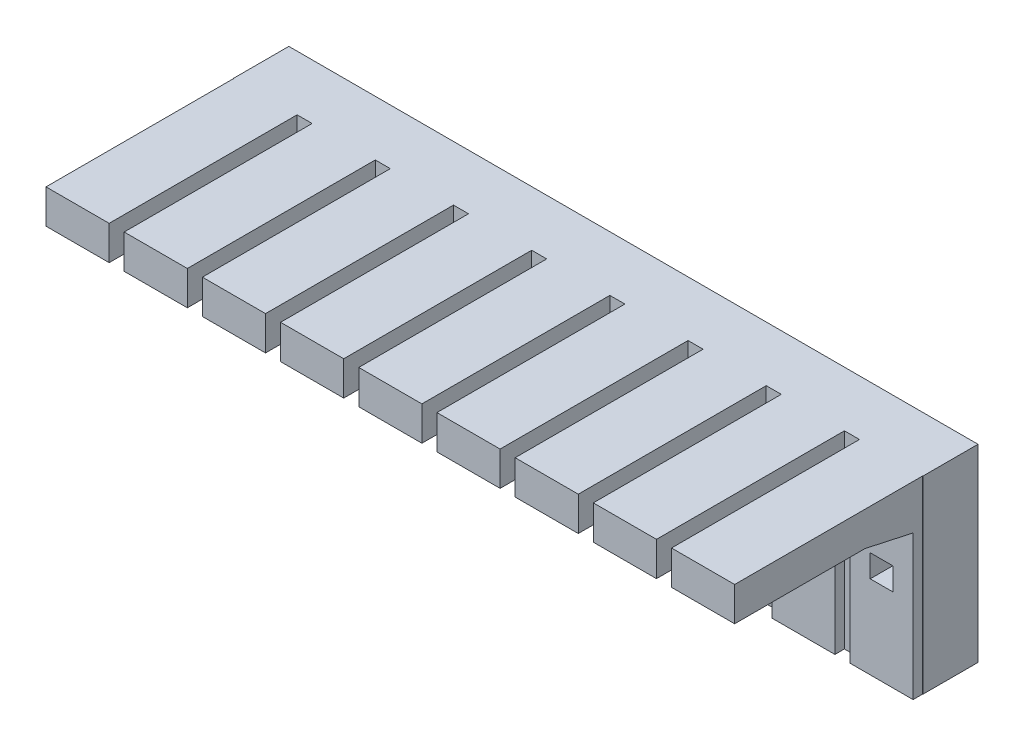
ISO-10303-21;
HEADER;
FILE_DESCRIPTION(('STEP AP214'),'2;1');
FILE_NAME('part.step','',(''),(''),'','','');
FILE_SCHEMA(('AUTOMOTIVE_DESIGN { 1 0 10303 214 1 1 1 1 }'));
ENDSEC;
DATA;
#1=APPLICATION_CONTEXT('core data for automotive mechanical design processes');
#2=APPLICATION_PROTOCOL_DEFINITION('international standard','automotive_design',2000,#1);
#3=PRODUCT_CONTEXT('',#1,'mechanical');
#4=PRODUCT('Part','Part','',(#3));
#5=PRODUCT_RELATED_PRODUCT_CATEGORY('part','',(#4));
#6=PRODUCT_DEFINITION_FORMATION('','',#4);
#7=PRODUCT_DEFINITION_CONTEXT('part definition',#1,'design');
#8=PRODUCT_DEFINITION('design','',#6,#7);
#9=PRODUCT_DEFINITION_SHAPE('','',#8);
#10=(LENGTH_UNIT() NAMED_UNIT(*) SI_UNIT(.MILLI.,.METRE.));
#11=(NAMED_UNIT(*) PLANE_ANGLE_UNIT() SI_UNIT($,.RADIAN.));
#12=(NAMED_UNIT(*) SI_UNIT($,.STERADIAN.) SOLID_ANGLE_UNIT());
#13=UNCERTAINTY_MEASURE_WITH_UNIT(LENGTH_MEASURE(1.E-05),#10,'distance_accuracy_value','');
#14=(GEOMETRIC_REPRESENTATION_CONTEXT(3) GLOBAL_UNCERTAINTY_ASSIGNED_CONTEXT((#13)) GLOBAL_UNIT_ASSIGNED_CONTEXT((#10,
#11,#12)) REPRESENTATION_CONTEXT('',''));
#15=CARTESIAN_POINT('',(0.,0.,0.));
#16=DIRECTION('',(0.,0.,1.));
#17=DIRECTION('',(1.,0.,0.));
#18=AXIS2_PLACEMENT_3D('',#15,#16,#17);
#19=CARTESIAN_POINT('',(17.4625,9.5758,12.319));
#20=DIRECTION('',(0.,0.,-1.));
#21=DIRECTION('',(-1.,0.,0.));
#22=AXIS2_PLACEMENT_3D('',#19,#20,#21);
#23=PLANE('',#22);
#24=DIRECTION('',(0.,1.,0.));
#25=VECTOR('',#24,1.);
#26=CARTESIAN_POINT('',(-17.4498,0.,12.319));
#27=LINE('',#26,#25);
#28=CARTESIAN_POINT('',(-17.4498,7.8486,12.319));
#29=VERTEX_POINT('',#28);
#30=CARTESIAN_POINT('',(-17.4498,9.5758,12.319));
#31=VERTEX_POINT('',#30);
#32=EDGE_CURVE('E970',#29,#31,#27,.T.);
#33=ORIENTED_EDGE('',*,*,#32,.F.);
#34=DIRECTION('',(-1.,0.,0.));
#35=VECTOR('',#34,1.);
#36=CARTESIAN_POINT('',(17.4625,7.8486,12.319));
#37=LINE('',#36,#35);
#38=CARTESIAN_POINT('',(-14.2494,7.8486,12.319));
#39=VERTEX_POINT('',#38);
#40=EDGE_CURVE('E1332',#39,#29,#37,.T.);
#41=ORIENTED_EDGE('',*,*,#40,.F.);
#42=DIRECTION('',(0.,1.,0.));
#43=VECTOR('',#42,1.);
#44=CARTESIAN_POINT('',(-14.2494,0.,12.319));
#45=LINE('',#44,#43);
#46=CARTESIAN_POINT('',(-14.2494,9.5758,12.319));
#47=VERTEX_POINT('',#46);
#48=EDGE_CURVE('E998',#39,#47,#45,.T.);
#49=ORIENTED_EDGE('',*,*,#48,.T.);
#50=DIRECTION('',(-1.,0.,0.));
#51=VECTOR('',#50,1.);
#52=CARTESIAN_POINT('',(17.4625,9.5758,12.319));
#53=LINE('',#52,#51);
#54=EDGE_CURVE('E1337',#47,#31,#53,.T.);
#55=ORIENTED_EDGE('',*,*,#54,.T.);
#56=EDGE_LOOP('',(#33,#41,#49,#55));
#57=FACE_BOUND('',#56,.T.);
#58=ADVANCED_FACE('F33',(#57),#23,.F.);
#59=CARTESIAN_POINT('',(17.4625,7.8486,12.319));
#60=DIRECTION('',(0.,1.,0.));
#61=DIRECTION('',(0.,0.,1.));
#62=AXIS2_PLACEMENT_3D('',#59,#60,#61);
#63=PLANE('',#62);
#64=DIRECTION('',(0.,0.,1.));
#65=VECTOR('',#64,1.);
#66=CARTESIAN_POINT('',(-17.4498,7.8486,12.319));
#67=LINE('',#66,#65);
#68=CARTESIAN_POINT('',(-17.4498,7.8486,5.715));
#69=VERTEX_POINT('',#68);
#70=EDGE_CURVE('E977',#69,#29,#67,.T.);
#71=ORIENTED_EDGE('',*,*,#70,.F.);
#72=DIRECTION('',(-1.,0.,0.));
#73=VECTOR('',#72,1.);
#74=CARTESIAN_POINT('',(17.4625,7.8486,5.715));
#75=LINE('',#74,#73);
#76=CARTESIAN_POINT('',(-14.2494,7.8486,5.715));
#77=VERTEX_POINT('',#76);
#78=EDGE_CURVE('E1327',#77,#69,#75,.T.);
#79=ORIENTED_EDGE('',*,*,#78,.F.);
#80=DIRECTION('',(0.,0.,-1.));
#81=VECTOR('',#80,1.);
#82=CARTESIAN_POINT('',(-14.2494,7.8486,12.319));
#83=LINE('',#82,#81);
#84=EDGE_CURVE('E1008',#39,#77,#83,.T.);
#85=ORIENTED_EDGE('',*,*,#84,.F.);
#86=ORIENTED_EDGE('',*,*,#40,.T.);
#87=EDGE_LOOP('',(#71,#79,#85,#86));
#88=FACE_BOUND('',#87,.T.);
#89=ADVANCED_FACE('F1543',(#88),#63,.F.);
#90=CARTESIAN_POINT('',(17.4625,7.8486,5.715));
#91=DIRECTION('',(0.,0.976900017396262,-0.213696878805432));
#92=DIRECTION('',(0.,0.213696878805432,0.976900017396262));
#93=AXIS2_PLACEMENT_3D('',#90,#91,#92);
#94=PLANE('',#93);
#95=DIRECTION('',(0.,0.213696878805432,0.976900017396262));
#96=VECTOR('',#95,1.);
#97=CARTESIAN_POINT('',(-17.4498,7.8486,5.715));
#98=LINE('',#97,#96);
#99=CARTESIAN_POINT('',(-17.4498,7.3152,3.2766));
#100=VERTEX_POINT('',#99);
#101=EDGE_CURVE('E975',#100,#69,#98,.T.);
#102=ORIENTED_EDGE('',*,*,#101,.F.);
#103=DIRECTION('',(-1.,0.,0.));
#104=VECTOR('',#103,1.);
#105=CARTESIAN_POINT('',(17.4625,7.3152,3.2766));
#106=LINE('',#105,#104);
#107=CARTESIAN_POINT('',(-14.2494,7.3152,3.2766));
#108=VERTEX_POINT('',#107);
#109=EDGE_CURVE('E1322',#108,#100,#106,.T.);
#110=ORIENTED_EDGE('',*,*,#109,.F.);
#111=DIRECTION('',(0.,-0.213696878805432,-0.976900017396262));
#112=VECTOR('',#111,1.);
#113=CARTESIAN_POINT('',(-14.2494,7.8486,5.715));
#114=LINE('',#113,#112);
#115=EDGE_CURVE('E1006',#77,#108,#114,.T.);
#116=ORIENTED_EDGE('',*,*,#115,.F.);
#117=ORIENTED_EDGE('',*,*,#78,.T.);
#118=EDGE_LOOP('',(#102,#110,#116,#117));
#119=FACE_BOUND('',#118,.T.);
#120=ADVANCED_FACE('F1630',(#119),#94,.F.);
#121=CARTESIAN_POINT('',(17.4625,7.3152,3.2766));
#122=DIRECTION('',(0.,0.,-1.));
#123=DIRECTION('',(0.,1.,0.));
#124=AXIS2_PLACEMENT_3D('',#121,#122,#123);
#125=PLANE('',#124);
#126=DIRECTION('',(-1.,0.,0.));
#127=VECTOR('',#126,1.);
#128=CARTESIAN_POINT('',(-16.4211,5.3594,3.2766));
#129=LINE('',#128,#127);
#130=CARTESIAN_POINT('',(-15.2781,5.3594,3.2766));
#131=VERTEX_POINT('',#130);
#132=CARTESIAN_POINT('',(-16.4211,5.3594,3.2766));
#133=VERTEX_POINT('',#132);
#134=EDGE_CURVE('E694',#131,#133,#129,.T.);
#135=ORIENTED_EDGE('',*,*,#134,.F.);
#136=DIRECTION('',(0.,1.,0.));
#137=VECTOR('',#136,1.);
#138=CARTESIAN_POINT('',(-15.2781,4.2164,3.2766));
#139=LINE('',#138,#137);
#140=CARTESIAN_POINT('',(-15.2781,4.2164,3.2766));
#141=VERTEX_POINT('',#140);
#142=EDGE_CURVE('E48',#141,#131,#139,.T.);
#143=ORIENTED_EDGE('',*,*,#142,.F.);
#144=DIRECTION('',(1.,0.,0.));
#145=VECTOR('',#144,1.);
#146=CARTESIAN_POINT('',(-16.4211,4.2164,3.2766));
#147=LINE('',#146,#145);
#148=CARTESIAN_POINT('',(-16.4211,4.2164,3.2766));
#149=VERTEX_POINT('',#148);
#150=EDGE_CURVE('E685',#149,#141,#147,.T.);
#151=ORIENTED_EDGE('',*,*,#150,.F.);
#152=DIRECTION('',(0.,-1.,0.));
#153=VECTOR('',#152,1.);
#154=CARTESIAN_POINT('',(-16.4211,4.2164,3.2766));
#155=LINE('',#154,#153);
#156=EDGE_CURVE('E688',#133,#149,#155,.T.);
#157=ORIENTED_EDGE('',*,*,#156,.F.);
#158=EDGE_LOOP('',(#135,#143,#151,#157));
#159=FACE_BOUND('',#158,.T.);
#160=DIRECTION('',(0.,1.,0.));
#161=VECTOR('',#160,1.);
#162=CARTESIAN_POINT('',(-17.4498,7.3152,3.2766));
#163=LINE('',#162,#161);
#164=CARTESIAN_POINT('',(-17.4498,0.,3.2766));
#165=VERTEX_POINT('',#164);
#166=EDGE_CURVE('E972',#165,#100,#163,.T.);
#167=ORIENTED_EDGE('',*,*,#166,.F.);
#168=DIRECTION('',(-1.,0.,0.));
#169=VECTOR('',#168,1.);
#170=CARTESIAN_POINT('',(17.4625,0.,3.2766));
#171=LINE('',#170,#169);
#172=CARTESIAN_POINT('',(-14.2494,0.,3.2766));
#173=VERTEX_POINT('',#172);
#174=EDGE_CURVE('E1314',#173,#165,#171,.T.);
#175=ORIENTED_EDGE('',*,*,#174,.F.);
#176=DIRECTION('',(0.,-1.,0.));
#177=VECTOR('',#176,1.);
#178=CARTESIAN_POINT('',(-14.2494,7.3152,3.2766));
#179=LINE('',#178,#177);
#180=EDGE_CURVE('E997',#108,#173,#179,.T.);
#181=ORIENTED_EDGE('',*,*,#180,.F.);
#182=ORIENTED_EDGE('',*,*,#109,.T.);
#183=EDGE_LOOP('',(#167,#175,#181,#182));
#184=FACE_BOUND('',#183,.T.);
#185=ADVANCED_FACE('F1443',(#159,#184),#125,.F.);
#186=CARTESIAN_POINT('',(17.4625,0.,3.2766));
#187=DIRECTION('',(0.,1.,0.));
#188=DIRECTION('',(0.,0.,1.));
#189=AXIS2_PLACEMENT_3D('',#186,#187,#188);
#190=PLANE('',#189);
#191=DIRECTION('',(0.,0.,1.));
#192=VECTOR('',#191,1.);
#193=CARTESIAN_POINT('',(-17.4498,0.,12.319));
#194=LINE('',#193,#192);
#195=CARTESIAN_POINT('',(-17.4498,0.,2.794));
#196=VERTEX_POINT('',#195);
#197=EDGE_CURVE('E960',#196,#165,#194,.T.);
#198=ORIENTED_EDGE('',*,*,#197,.F.);
#199=DIRECTION('',(1.,0.,0.));
#200=VECTOR('',#199,1.);
#201=CARTESIAN_POINT('',(-17.4498,0.,2.794));
#202=LINE('',#201,#200);
#203=CARTESIAN_POINT('',(-17.4625,0.,2.794));
#204=VERTEX_POINT('',#203);
#205=EDGE_CURVE('E962',#204,#196,#202,.T.);
#206=ORIENTED_EDGE('',*,*,#205,.F.);
#207=DIRECTION('',(0.,0.,-1.));
#208=VECTOR('',#207,1.);
#209=CARTESIAN_POINT('',(-17.4625,0.,3.2766));
#210=LINE('',#209,#208);
#211=CARTESIAN_POINT('',(-17.4625,0.,0.));
#212=VERTEX_POINT('',#211);
#213=EDGE_CURVE('E1305',#204,#212,#210,.T.);
#214=ORIENTED_EDGE('',*,*,#213,.T.);
#215=DIRECTION('',(-1.,0.,0.));
#216=VECTOR('',#215,1.);
#217=CARTESIAN_POINT('',(17.4625,0.,0.));
#218=LINE('',#217,#216);
#219=CARTESIAN_POINT('',(17.4625,0.,0.));
#220=VERTEX_POINT('',#219);
#221=EDGE_CURVE('E1347',#220,#212,#218,.T.);
#222=ORIENTED_EDGE('',*,*,#221,.F.);
#223=DIRECTION('',(0.,0.,-1.));
#224=VECTOR('',#223,1.);
#225=CARTESIAN_POINT('',(17.4625,0.,3.2766));
#226=LINE('',#225,#224);
#227=CARTESIAN_POINT('',(17.4625,0.,2.794));
#228=VERTEX_POINT('',#227);
#229=EDGE_CURVE('E1306',#228,#220,#226,.T.);
#230=ORIENTED_EDGE('',*,*,#229,.F.);
#231=DIRECTION('',(-1.,0.,0.));
#232=VECTOR('',#231,1.);
#233=CARTESIAN_POINT('',(17.4498,0.,2.794));
#234=LINE('',#233,#232);
#235=CARTESIAN_POINT('',(17.4498,0.,2.794));
#236=VERTEX_POINT('',#235);
#237=EDGE_CURVE('E1131',#228,#236,#234,.T.);
#238=ORIENTED_EDGE('',*,*,#237,.T.);
#239=DIRECTION('',(0.,0.,1.));
#240=VECTOR('',#239,1.);
#241=CARTESIAN_POINT('',(17.4498,0.,12.319));
#242=LINE('',#241,#240);
#243=CARTESIAN_POINT('',(17.4498,0.,3.2766));
#244=VERTEX_POINT('',#243);
#245=EDGE_CURVE('E1128',#236,#244,#242,.T.);
#246=ORIENTED_EDGE('',*,*,#245,.T.);
#247=CARTESIAN_POINT('',(14.2494,0.,3.2766));
#248=VERTEX_POINT('',#247);
#249=EDGE_CURVE('E1320',#244,#248,#171,.T.);
#250=ORIENTED_EDGE('',*,*,#249,.T.);
#251=DIRECTION('',(0.,0.,-1.));
#252=VECTOR('',#251,1.);
#253=CARTESIAN_POINT('',(14.2494,0.,12.319));
#254=LINE('',#253,#252);
#255=CARTESIAN_POINT('',(14.2494,0.,2.794));
#256=VERTEX_POINT('',#255);
#257=EDGE_CURVE('E1153',#248,#256,#254,.T.);
#258=ORIENTED_EDGE('',*,*,#257,.T.);
#259=DIRECTION('',(-1.,0.,0.));
#260=VECTOR('',#259,1.);
#261=CARTESIAN_POINT('',(13.4874,0.,2.794));
#262=LINE('',#261,#260);
#263=CARTESIAN_POINT('',(13.4874,0.,2.794));
#264=VERTEX_POINT('',#263);
#265=EDGE_CURVE('E1157',#256,#264,#262,.T.);
#266=ORIENTED_EDGE('',*,*,#265,.T.);
#267=DIRECTION('',(0.,0.,1.));
#268=VECTOR('',#267,1.);
#269=CARTESIAN_POINT('',(13.4874,0.,12.319));
#270=LINE('',#269,#268);
#271=CARTESIAN_POINT('',(13.4874,0.,3.2766));
#272=VERTEX_POINT('',#271);
#273=EDGE_CURVE('E1150',#264,#272,#270,.T.);
#274=ORIENTED_EDGE('',*,*,#273,.T.);
#275=CARTESIAN_POINT('',(10.287,0.,3.2766));
#276=VERTEX_POINT('',#275);
#277=EDGE_CURVE('E1323',#272,#276,#171,.T.);
#278=ORIENTED_EDGE('',*,*,#277,.T.);
#279=DIRECTION('',(0.,0.,-1.));
#280=VECTOR('',#279,1.);
#281=CARTESIAN_POINT('',(10.287,0.,12.319));
#282=LINE('',#281,#280);
#283=CARTESIAN_POINT('',(10.287,0.,2.794));
#284=VERTEX_POINT('',#283);
#285=EDGE_CURVE('E1192',#276,#284,#282,.T.);
#286=ORIENTED_EDGE('',*,*,#285,.T.);
#287=DIRECTION('',(-1.,0.,0.));
#288=VECTOR('',#287,1.);
#289=CARTESIAN_POINT('',(9.525,0.,2.794));
#290=LINE('',#289,#288);
#291=CARTESIAN_POINT('',(9.525,0.,2.794));
#292=VERTEX_POINT('',#291);
#293=EDGE_CURVE('E1196',#284,#292,#290,.T.);
#294=ORIENTED_EDGE('',*,*,#293,.T.);
#295=DIRECTION('',(0.,0.,1.));
#296=VECTOR('',#295,1.);
#297=CARTESIAN_POINT('',(9.525,0.,12.319));
#298=LINE('',#297,#296);
#299=CARTESIAN_POINT('',(9.525,0.,3.2766));
#300=VERTEX_POINT('',#299);
#301=EDGE_CURVE('E1189',#292,#300,#298,.T.);
#302=ORIENTED_EDGE('',*,*,#301,.T.);
#303=CARTESIAN_POINT('',(6.3246,0.,3.2766));
#304=VERTEX_POINT('',#303);
#305=EDGE_CURVE('E1587',#300,#304,#171,.T.);
#306=ORIENTED_EDGE('',*,*,#305,.T.);
#307=DIRECTION('',(0.,0.,-1.));
#308=VECTOR('',#307,1.);
#309=CARTESIAN_POINT('',(6.3246,0.,12.319));
#310=LINE('',#309,#308);
#311=CARTESIAN_POINT('',(6.3246,0.,2.794));
#312=VERTEX_POINT('',#311);
#313=EDGE_CURVE('E1231',#304,#312,#310,.T.);
#314=ORIENTED_EDGE('',*,*,#313,.T.);
#315=DIRECTION('',(-1.,0.,0.));
#316=VECTOR('',#315,1.);
#317=CARTESIAN_POINT('',(5.5626,0.,2.794));
#318=LINE('',#317,#316);
#319=CARTESIAN_POINT('',(5.5626,0.,2.794));
#320=VERTEX_POINT('',#319);
#321=EDGE_CURVE('E1235',#312,#320,#318,.T.);
#322=ORIENTED_EDGE('',*,*,#321,.T.);
#323=DIRECTION('',(0.,0.,1.));
#324=VECTOR('',#323,1.);
#325=CARTESIAN_POINT('',(5.5626,0.,12.319));
#326=LINE('',#325,#324);
#327=CARTESIAN_POINT('',(5.5626,0.,3.2766));
#328=VERTEX_POINT('',#327);
#329=EDGE_CURVE('E1228',#320,#328,#326,.T.);
#330=ORIENTED_EDGE('',*,*,#329,.T.);
#331=CARTESIAN_POINT('',(2.3622,0.,3.2766));
#332=VERTEX_POINT('',#331);
#333=EDGE_CURVE('E1585',#328,#332,#171,.T.);
#334=ORIENTED_EDGE('',*,*,#333,.T.);
#335=DIRECTION('',(0.,0.,-1.));
#336=VECTOR('',#335,1.);
#337=CARTESIAN_POINT('',(2.3622,0.,12.319));
#338=LINE('',#337,#336);
#339=CARTESIAN_POINT('',(2.3622,0.,2.794));
#340=VERTEX_POINT('',#339);
#341=EDGE_CURVE('E1270',#332,#340,#338,.T.);
#342=ORIENTED_EDGE('',*,*,#341,.T.);
#343=DIRECTION('',(-1.,0.,0.));
#344=VECTOR('',#343,1.);
#345=CARTESIAN_POINT('',(1.6002,0.,2.794));
#346=LINE('',#345,#344);
#347=CARTESIAN_POINT('',(1.6002,0.,2.794));
#348=VERTEX_POINT('',#347);
#349=EDGE_CURVE('E1274',#340,#348,#346,.T.);
#350=ORIENTED_EDGE('',*,*,#349,.T.);
#351=DIRECTION('',(0.,0.,1.));
#352=VECTOR('',#351,1.);
#353=CARTESIAN_POINT('',(1.6002,0.,12.319));
#354=LINE('',#353,#352);
#355=CARTESIAN_POINT('',(1.6002,0.,3.2766));
#356=VERTEX_POINT('',#355);
#357=EDGE_CURVE('E1267',#348,#356,#354,.T.);
#358=ORIENTED_EDGE('',*,*,#357,.T.);
#359=CARTESIAN_POINT('',(-1.6002,0.,3.2766));
#360=VERTEX_POINT('',#359);
#361=EDGE_CURVE('E1324',#356,#360,#171,.T.);
#362=ORIENTED_EDGE('',*,*,#361,.T.);
#363=DIRECTION('',(0.,0.,1.));
#364=VECTOR('',#363,1.);
#365=CARTESIAN_POINT('',(-1.6002,0.,12.319));
#366=LINE('',#365,#364);
#367=CARTESIAN_POINT('',(-1.6002,0.,2.794));
#368=VERTEX_POINT('',#367);
#369=EDGE_CURVE('E1091',#368,#360,#366,.T.);
#370=ORIENTED_EDGE('',*,*,#369,.F.);
#371=DIRECTION('',(1.,0.,0.));
#372=VECTOR('',#371,1.);
#373=CARTESIAN_POINT('',(-1.6002,0.,2.794));
#374=LINE('',#373,#372);
#375=CARTESIAN_POINT('',(-2.3622,0.,2.794));
#376=VERTEX_POINT('',#375);
#377=EDGE_CURVE('E1093',#376,#368,#374,.T.);
#378=ORIENTED_EDGE('',*,*,#377,.F.);
#379=DIRECTION('',(0.,0.,-1.));
#380=VECTOR('',#379,1.);
#381=CARTESIAN_POINT('',(-2.3622,0.,12.319));
#382=LINE('',#381,#380);
#383=CARTESIAN_POINT('',(-2.3622,0.,3.2766));
#384=VERTEX_POINT('',#383);
#385=EDGE_CURVE('E1096',#384,#376,#382,.T.);
#386=ORIENTED_EDGE('',*,*,#385,.F.);
#387=CARTESIAN_POINT('',(-5.5626,0.,3.2766));
#388=VERTEX_POINT('',#387);
#389=EDGE_CURVE('E1589',#384,#388,#171,.T.);
#390=ORIENTED_EDGE('',*,*,#389,.T.);
#391=DIRECTION('',(0.,0.,1.));
#392=VECTOR('',#391,1.);
#393=CARTESIAN_POINT('',(-5.5626,0.,12.319));
#394=LINE('',#393,#392);
#395=CARTESIAN_POINT('',(-5.5626,0.,2.794));
#396=VERTEX_POINT('',#395);
#397=EDGE_CURVE('E1054',#396,#388,#394,.T.);
#398=ORIENTED_EDGE('',*,*,#397,.F.);
#399=DIRECTION('',(1.,0.,0.));
#400=VECTOR('',#399,1.);
#401=CARTESIAN_POINT('',(-5.5626,0.,2.794));
#402=LINE('',#401,#400);
#403=CARTESIAN_POINT('',(-6.3246,0.,2.794));
#404=VERTEX_POINT('',#403);
#405=EDGE_CURVE('E1056',#404,#396,#402,.T.);
#406=ORIENTED_EDGE('',*,*,#405,.F.);
#407=DIRECTION('',(0.,0.,-1.));
#408=VECTOR('',#407,1.);
#409=CARTESIAN_POINT('',(-6.3246,0.,12.319));
#410=LINE('',#409,#408);
#411=CARTESIAN_POINT('',(-6.3246,0.,3.2766));
#412=VERTEX_POINT('',#411);
#413=EDGE_CURVE('E1059',#412,#404,#410,.T.);
#414=ORIENTED_EDGE('',*,*,#413,.F.);
#415=CARTESIAN_POINT('',(-9.525,0.,3.2766));
#416=VERTEX_POINT('',#415);
#417=EDGE_CURVE('E1593',#412,#416,#171,.T.);
#418=ORIENTED_EDGE('',*,*,#417,.T.);
#419=DIRECTION('',(0.,0.,1.));
#420=VECTOR('',#419,1.);
#421=CARTESIAN_POINT('',(-9.525,0.,12.319));
#422=LINE('',#421,#420);
#423=CARTESIAN_POINT('',(-9.525,0.,2.794));
#424=VERTEX_POINT('',#423);
#425=EDGE_CURVE('E1017',#424,#416,#422,.T.);
#426=ORIENTED_EDGE('',*,*,#425,.F.);
#427=DIRECTION('',(1.,0.,0.));
#428=VECTOR('',#427,1.);
#429=CARTESIAN_POINT('',(-9.525,0.,2.794));
#430=LINE('',#429,#428);
#431=CARTESIAN_POINT('',(-10.287,0.,2.794));
#432=VERTEX_POINT('',#431);
#433=EDGE_CURVE('E1019',#432,#424,#430,.T.);
#434=ORIENTED_EDGE('',*,*,#433,.F.);
#435=DIRECTION('',(0.,0.,-1.));
#436=VECTOR('',#435,1.);
#437=CARTESIAN_POINT('',(-10.287,0.,12.319));
#438=LINE('',#437,#436);
#439=CARTESIAN_POINT('',(-10.287,0.,3.2766));
#440=VERTEX_POINT('',#439);
#441=EDGE_CURVE('E1022',#440,#432,#438,.T.);
#442=ORIENTED_EDGE('',*,*,#441,.F.);
#443=CARTESIAN_POINT('',(-13.4874,0.,3.2766));
#444=VERTEX_POINT('',#443);
#445=EDGE_CURVE('E1598',#440,#444,#171,.T.);
#446=ORIENTED_EDGE('',*,*,#445,.T.);
#447=DIRECTION('',(0.,0.,1.));
#448=VECTOR('',#447,1.);
#449=CARTESIAN_POINT('',(-13.4874,0.,12.319));
#450=LINE('',#449,#448);
#451=CARTESIAN_POINT('',(-13.4874,0.,2.794));
#452=VERTEX_POINT('',#451);
#453=EDGE_CURVE('E980',#452,#444,#450,.T.);
#454=ORIENTED_EDGE('',*,*,#453,.F.);
#455=DIRECTION('',(1.,0.,0.));
#456=VECTOR('',#455,1.);
#457=CARTESIAN_POINT('',(-13.4874,0.,2.794));
#458=LINE('',#457,#456);
#459=CARTESIAN_POINT('',(-14.2494,0.,2.794));
#460=VERTEX_POINT('',#459);
#461=EDGE_CURVE('E982',#460,#452,#458,.T.);
#462=ORIENTED_EDGE('',*,*,#461,.F.);
#463=DIRECTION('',(0.,0.,-1.));
#464=VECTOR('',#463,1.);
#465=CARTESIAN_POINT('',(-14.2494,0.,12.319));
#466=LINE('',#465,#464);
#467=EDGE_CURVE('E985',#173,#460,#466,.T.);
#468=ORIENTED_EDGE('',*,*,#467,.F.);
#469=ORIENTED_EDGE('',*,*,#174,.T.);
#470=EDGE_LOOP('',(#198,#206,#214,#222,#230,#238,#246,#250,#258,#266,#274,#278,#286,#294,#302,
#306,#314,#322,#330,#334,#342,#350,#358,#362,#370,#378,#386,#390,#398,#406,#414,#418,#426,#434,
#442,#446,#454,#462,#468,#469));
#471=FACE_BOUND('',#470,.T.);
#472=ADVANCED_FACE('F35',(#471),#190,.F.);
#473=CARTESIAN_POINT('',(17.4625,9.5758,0.));
#474=DIRECTION('',(0.,-1.,0.));
#475=DIRECTION('',(0.,0.,-1.));
#476=AXIS2_PLACEMENT_3D('',#473,#474,#475);
#477=PLANE('',#476);
#478=DIRECTION('',(0.,0.,1.));
#479=VECTOR('',#478,1.);
#480=CARTESIAN_POINT('',(-17.4498,9.5758,12.319));
#481=LINE('',#480,#479);
#482=CARTESIAN_POINT('',(-17.4498,9.5758,2.794));
#483=VERTEX_POINT('',#482);
#484=EDGE_CURVE('E953',#483,#31,#481,.T.);
#485=ORIENTED_EDGE('',*,*,#484,.T.);
#486=ORIENTED_EDGE('',*,*,#54,.F.);
#487=DIRECTION('',(0.,0.,-1.));
#488=VECTOR('',#487,1.);
#489=CARTESIAN_POINT('',(-14.2494,9.5758,12.319));
#490=LINE('',#489,#488);
#491=CARTESIAN_POINT('',(-14.2494,9.5758,2.794));
#492=VERTEX_POINT('',#491);
#493=EDGE_CURVE('E983',#47,#492,#490,.T.);
#494=ORIENTED_EDGE('',*,*,#493,.T.);
#495=DIRECTION('',(1.,0.,0.));
#496=VECTOR('',#495,1.);
#497=CARTESIAN_POINT('',(-13.4874,9.5758,2.794));
#498=LINE('',#497,#496);
#499=CARTESIAN_POINT('',(-13.4874,9.5758,2.794));
#500=VERTEX_POINT('',#499);
#501=EDGE_CURVE('E990',#492,#500,#498,.T.);
#502=ORIENTED_EDGE('',*,*,#501,.T.);
#503=DIRECTION('',(0.,0.,1.));
#504=VECTOR('',#503,1.);
#505=CARTESIAN_POINT('',(-13.4874,9.5758,12.319));
#506=LINE('',#505,#504);
#507=CARTESIAN_POINT('',(-13.4874,9.5758,12.319));
#508=VERTEX_POINT('',#507);
#509=EDGE_CURVE('E979',#500,#508,#506,.T.);
#510=ORIENTED_EDGE('',*,*,#509,.T.);
#511=CARTESIAN_POINT('',(-10.287,9.5758,12.319));
#512=VERTEX_POINT('',#511);
#513=EDGE_CURVE('E1550',#512,#508,#53,.T.);
#514=ORIENTED_EDGE('',*,*,#513,.F.);
#515=DIRECTION('',(0.,0.,-1.));
#516=VECTOR('',#515,1.);
#517=CARTESIAN_POINT('',(-10.287,9.5758,12.319));
#518=LINE('',#517,#516);
#519=CARTESIAN_POINT('',(-10.287,9.5758,2.794));
#520=VERTEX_POINT('',#519);
#521=EDGE_CURVE('E1020',#512,#520,#518,.T.);
#522=ORIENTED_EDGE('',*,*,#521,.T.);
#523=DIRECTION('',(1.,0.,0.));
#524=VECTOR('',#523,1.);
#525=CARTESIAN_POINT('',(-9.525,9.5758,2.794));
#526=LINE('',#525,#524);
#527=CARTESIAN_POINT('',(-9.525,9.5758,2.794));
#528=VERTEX_POINT('',#527);
#529=EDGE_CURVE('E1027',#520,#528,#526,.T.);
#530=ORIENTED_EDGE('',*,*,#529,.T.);
#531=DIRECTION('',(0.,0.,1.));
#532=VECTOR('',#531,1.);
#533=CARTESIAN_POINT('',(-9.525,9.5758,12.319));
#534=LINE('',#533,#532);
#535=CARTESIAN_POINT('',(-9.525,9.5758,12.319));
#536=VERTEX_POINT('',#535);
#537=EDGE_CURVE('E1016',#528,#536,#534,.T.);
#538=ORIENTED_EDGE('',*,*,#537,.T.);
#539=CARTESIAN_POINT('',(-6.3246,9.5758,12.319));
#540=VERTEX_POINT('',#539);
#541=EDGE_CURVE('E1552',#540,#536,#53,.T.);
#542=ORIENTED_EDGE('',*,*,#541,.F.);
#543=DIRECTION('',(0.,0.,-1.));
#544=VECTOR('',#543,1.);
#545=CARTESIAN_POINT('',(-6.3246,9.5758,12.319));
#546=LINE('',#545,#544);
#547=CARTESIAN_POINT('',(-6.3246,9.5758,2.794));
#548=VERTEX_POINT('',#547);
#549=EDGE_CURVE('E1057',#540,#548,#546,.T.);
#550=ORIENTED_EDGE('',*,*,#549,.T.);
#551=DIRECTION('',(1.,0.,0.));
#552=VECTOR('',#551,1.);
#553=CARTESIAN_POINT('',(-5.5626,9.5758,2.794));
#554=LINE('',#553,#552);
#555=CARTESIAN_POINT('',(-5.5626,9.5758,2.794));
#556=VERTEX_POINT('',#555);
#557=EDGE_CURVE('E1064',#548,#556,#554,.T.);
#558=ORIENTED_EDGE('',*,*,#557,.T.);
#559=DIRECTION('',(0.,0.,1.));
#560=VECTOR('',#559,1.);
#561=CARTESIAN_POINT('',(-5.5626,9.5758,12.319));
#562=LINE('',#561,#560);
#563=CARTESIAN_POINT('',(-5.5626,9.5758,12.319));
#564=VERTEX_POINT('',#563);
#565=EDGE_CURVE('E1053',#556,#564,#562,.T.);
#566=ORIENTED_EDGE('',*,*,#565,.T.);
#567=CARTESIAN_POINT('',(-2.3622,9.5758,12.319));
#568=VERTEX_POINT('',#567);
#569=EDGE_CURVE('E1557',#568,#564,#53,.T.);
#570=ORIENTED_EDGE('',*,*,#569,.F.);
#571=DIRECTION('',(0.,0.,-1.));
#572=VECTOR('',#571,1.);
#573=CARTESIAN_POINT('',(-2.3622,9.5758,12.319));
#574=LINE('',#573,#572);
#575=CARTESIAN_POINT('',(-2.3622,9.5758,2.794));
#576=VERTEX_POINT('',#575);
#577=EDGE_CURVE('E1094',#568,#576,#574,.T.);
#578=ORIENTED_EDGE('',*,*,#577,.T.);
#579=DIRECTION('',(1.,0.,0.));
#580=VECTOR('',#579,1.);
#581=CARTESIAN_POINT('',(-1.6002,9.5758,2.794));
#582=LINE('',#581,#580);
#583=CARTESIAN_POINT('',(-1.6002,9.5758,2.794));
#584=VERTEX_POINT('',#583);
#585=EDGE_CURVE('E1101',#576,#584,#582,.T.);
#586=ORIENTED_EDGE('',*,*,#585,.T.);
#587=DIRECTION('',(0.,0.,1.));
#588=VECTOR('',#587,1.);
#589=CARTESIAN_POINT('',(-1.6002,9.5758,12.319));
#590=LINE('',#589,#588);
#591=CARTESIAN_POINT('',(-1.6002,9.5758,12.319));
#592=VERTEX_POINT('',#591);
#593=EDGE_CURVE('E1090',#584,#592,#590,.T.);
#594=ORIENTED_EDGE('',*,*,#593,.T.);
#595=CARTESIAN_POINT('',(1.6002,9.5758,12.319));
#596=VERTEX_POINT('',#595);
#597=EDGE_CURVE('E1344',#596,#592,#53,.T.);
#598=ORIENTED_EDGE('',*,*,#597,.F.);
#599=DIRECTION('',(0.,0.,1.));
#600=VECTOR('',#599,1.);
#601=CARTESIAN_POINT('',(1.6002,9.5758,12.319));
#602=LINE('',#601,#600);
#603=CARTESIAN_POINT('',(1.6002,9.5758,2.794));
#604=VERTEX_POINT('',#603);
#605=EDGE_CURVE('E1266',#604,#596,#602,.T.);
#606=ORIENTED_EDGE('',*,*,#605,.F.);
#607=DIRECTION('',(-1.,0.,0.));
#608=VECTOR('',#607,1.);
#609=CARTESIAN_POINT('',(1.6002,9.5758,2.794));
#610=LINE('',#609,#608);
#611=CARTESIAN_POINT('',(2.3622,9.5758,2.794));
#612=VERTEX_POINT('',#611);
#613=EDGE_CURVE('E1271',#612,#604,#610,.T.);
#614=ORIENTED_EDGE('',*,*,#613,.F.);
#615=DIRECTION('',(0.,0.,-1.));
#616=VECTOR('',#615,1.);
#617=CARTESIAN_POINT('',(2.3622,9.5758,12.319));
#618=LINE('',#617,#616);
#619=CARTESIAN_POINT('',(2.3622,9.5758,12.319));
#620=VERTEX_POINT('',#619);
#621=EDGE_CURVE('E1279',#620,#612,#618,.T.);
#622=ORIENTED_EDGE('',*,*,#621,.F.);
#623=CARTESIAN_POINT('',(5.5626,9.5758,12.319));
#624=VERTEX_POINT('',#623);
#625=EDGE_CURVE('E1566',#624,#620,#53,.T.);
#626=ORIENTED_EDGE('',*,*,#625,.F.);
#627=DIRECTION('',(0.,0.,1.));
#628=VECTOR('',#627,1.);
#629=CARTESIAN_POINT('',(5.5626,9.5758,12.319));
#630=LINE('',#629,#628);
#631=CARTESIAN_POINT('',(5.5626,9.5758,2.794));
#632=VERTEX_POINT('',#631);
#633=EDGE_CURVE('E1227',#632,#624,#630,.T.);
#634=ORIENTED_EDGE('',*,*,#633,.F.);
#635=DIRECTION('',(-1.,0.,0.));
#636=VECTOR('',#635,1.);
#637=CARTESIAN_POINT('',(5.5626,9.5758,2.794));
#638=LINE('',#637,#636);
#639=CARTESIAN_POINT('',(6.3246,9.5758,2.794));
#640=VERTEX_POINT('',#639);
#641=EDGE_CURVE('E1232',#640,#632,#638,.T.);
#642=ORIENTED_EDGE('',*,*,#641,.F.);
#643=DIRECTION('',(0.,0.,-1.));
#644=VECTOR('',#643,1.);
#645=CARTESIAN_POINT('',(6.3246,9.5758,12.319));
#646=LINE('',#645,#644);
#647=CARTESIAN_POINT('',(6.3246,9.5758,12.319));
#648=VERTEX_POINT('',#647);
#649=EDGE_CURVE('E1240',#648,#640,#646,.T.);
#650=ORIENTED_EDGE('',*,*,#649,.F.);
#651=CARTESIAN_POINT('',(9.525,9.5758,12.319));
#652=VERTEX_POINT('',#651);
#653=EDGE_CURVE('E1567',#652,#648,#53,.T.);
#654=ORIENTED_EDGE('',*,*,#653,.F.);
#655=DIRECTION('',(0.,0.,1.));
#656=VECTOR('',#655,1.);
#657=CARTESIAN_POINT('',(9.525,9.5758,12.319));
#658=LINE('',#657,#656);
#659=CARTESIAN_POINT('',(9.525,9.5758,2.794));
#660=VERTEX_POINT('',#659);
#661=EDGE_CURVE('E1188',#660,#652,#658,.T.);
#662=ORIENTED_EDGE('',*,*,#661,.F.);
#663=DIRECTION('',(-1.,0.,0.));
#664=VECTOR('',#663,1.);
#665=CARTESIAN_POINT('',(9.525,9.5758,2.794));
#666=LINE('',#665,#664);
#667=CARTESIAN_POINT('',(10.287,9.5758,2.794));
#668=VERTEX_POINT('',#667);
#669=EDGE_CURVE('E1193',#668,#660,#666,.T.);
#670=ORIENTED_EDGE('',*,*,#669,.F.);
#671=DIRECTION('',(0.,0.,-1.));
#672=VECTOR('',#671,1.);
#673=CARTESIAN_POINT('',(10.287,9.5758,12.319));
#674=LINE('',#673,#672);
#675=CARTESIAN_POINT('',(10.287,9.5758,12.319));
#676=VERTEX_POINT('',#675);
#677=EDGE_CURVE('E1201',#676,#668,#674,.T.);
#678=ORIENTED_EDGE('',*,*,#677,.F.);
#679=CARTESIAN_POINT('',(13.4874,9.5758,12.319));
#680=VERTEX_POINT('',#679);
#681=EDGE_CURVE('E1343',#680,#676,#53,.T.);
#682=ORIENTED_EDGE('',*,*,#681,.F.);
#683=DIRECTION('',(0.,0.,1.));
#684=VECTOR('',#683,1.);
#685=CARTESIAN_POINT('',(13.4874,9.5758,12.319));
#686=LINE('',#685,#684);
#687=CARTESIAN_POINT('',(13.4874,9.5758,2.794));
#688=VERTEX_POINT('',#687);
#689=EDGE_CURVE('E1149',#688,#680,#686,.T.);
#690=ORIENTED_EDGE('',*,*,#689,.F.);
#691=DIRECTION('',(-1.,0.,0.));
#692=VECTOR('',#691,1.);
#693=CARTESIAN_POINT('',(13.4874,9.5758,2.794));
#694=LINE('',#693,#692);
#695=CARTESIAN_POINT('',(14.2494,9.5758,2.794));
#696=VERTEX_POINT('',#695);
#697=EDGE_CURVE('E1154',#696,#688,#694,.T.);
#698=ORIENTED_EDGE('',*,*,#697,.F.);
#699=DIRECTION('',(0.,0.,-1.));
#700=VECTOR('',#699,1.);
#701=CARTESIAN_POINT('',(14.2494,9.5758,12.319));
#702=LINE('',#701,#700);
#703=CARTESIAN_POINT('',(14.2494,9.5758,12.319));
#704=VERTEX_POINT('',#703);
#705=EDGE_CURVE('E1162',#704,#696,#702,.T.);
#706=ORIENTED_EDGE('',*,*,#705,.F.);
#707=CARTESIAN_POINT('',(17.4498,9.5758,12.319));
#708=VERTEX_POINT('',#707);
#709=EDGE_CURVE('E1340',#708,#704,#53,.T.);
#710=ORIENTED_EDGE('',*,*,#709,.F.);
#711=DIRECTION('',(0.,0.,1.));
#712=VECTOR('',#711,1.);
#713=CARTESIAN_POINT('',(17.4498,9.5758,12.319));
#714=LINE('',#713,#712);
#715=CARTESIAN_POINT('',(17.4498,9.5758,2.794));
#716=VERTEX_POINT('',#715);
#717=EDGE_CURVE('E1127',#716,#708,#714,.T.);
#718=ORIENTED_EDGE('',*,*,#717,.F.);
#719=DIRECTION('',(-1.,0.,0.));
#720=VECTOR('',#719,1.);
#721=CARTESIAN_POINT('',(17.4498,9.5758,2.794));
#722=LINE('',#721,#720);
#723=CARTESIAN_POINT('',(17.4625,9.5758,2.794));
#724=VERTEX_POINT('',#723);
#725=EDGE_CURVE('E1132',#724,#716,#722,.T.);
#726=ORIENTED_EDGE('',*,*,#725,.F.);
#727=DIRECTION('',(0.,0.,1.));
#728=VECTOR('',#727,1.);
#729=CARTESIAN_POINT('',(17.4625,9.5758,0.));
#730=LINE('',#729,#728);
#731=CARTESIAN_POINT('',(17.4625,9.5758,0.));
#732=VERTEX_POINT('',#731);
#733=EDGE_CURVE('E1311',#732,#724,#730,.T.);
#734=ORIENTED_EDGE('',*,*,#733,.F.);
#735=DIRECTION('',(-1.,0.,0.));
#736=VECTOR('',#735,1.);
#737=CARTESIAN_POINT('',(17.4625,9.5758,0.));
#738=LINE('',#737,#736);
#739=CARTESIAN_POINT('',(-17.4625,9.5758,0.));
#740=VERTEX_POINT('',#739);
#741=EDGE_CURVE('E1342',#732,#740,#738,.T.);
#742=ORIENTED_EDGE('',*,*,#741,.T.);
#743=DIRECTION('',(0.,0.,1.));
#744=VECTOR('',#743,1.);
#745=CARTESIAN_POINT('',(-17.4625,9.5758,0.));
#746=LINE('',#745,#744);
#747=CARTESIAN_POINT('',(-17.4625,9.5758,2.794));
#748=VERTEX_POINT('',#747);
#749=EDGE_CURVE('E1309',#740,#748,#746,.T.);
#750=ORIENTED_EDGE('',*,*,#749,.T.);
#751=DIRECTION('',(1.,0.,0.));
#752=VECTOR('',#751,1.);
#753=CARTESIAN_POINT('',(-17.4498,9.5758,2.794));
#754=LINE('',#753,#752);
#755=EDGE_CURVE('E963',#748,#483,#754,.T.);
#756=ORIENTED_EDGE('',*,*,#755,.T.);
#757=EDGE_LOOP('',(#485,#486,#494,#502,#510,#514,#522,#530,#538,#542,#550,#558,#566,#570,#578,
#586,#594,#598,#606,#614,#622,#626,#634,#642,#650,#654,#662,#670,#678,#682,#690,#698,#706,#710,
#718,#726,#734,#742,#750,#756));
#758=FACE_BOUND('',#757,.T.);
#759=ADVANCED_FACE('F1401',(#758),#477,.F.);
#760=CARTESIAN_POINT('',(-17.4625,0.,0.));
#761=DIRECTION('',(1.,0.,0.));
#762=DIRECTION('',(0.,0.,-1.));
#763=AXIS2_PLACEMENT_3D('',#760,#761,#762);
#764=PLANE('',#763);
#765=DIRECTION('',(0.,-1.,0.));
#766=VECTOR('',#765,1.);
#767=CARTESIAN_POINT('',(-17.4625,0.,2.794));
#768=LINE('',#767,#766);
#769=EDGE_CURVE('E11',#748,#204,#768,.T.);
#770=ORIENTED_EDGE('',*,*,#769,.F.);
#771=ORIENTED_EDGE('',*,*,#749,.F.);
#772=DIRECTION('',(0.,1.,0.));
#773=VECTOR('',#772,1.);
#774=CARTESIAN_POINT('',(-17.4625,0.,0.));
#775=LINE('',#774,#773);
#776=EDGE_CURVE('E1316',#212,#740,#775,.T.);
#777=ORIENTED_EDGE('',*,*,#776,.F.);
#778=ORIENTED_EDGE('',*,*,#213,.F.);
#779=EDGE_LOOP('',(#770,#771,#777,#778));
#780=FACE_BOUND('',#779,.T.);
#781=ADVANCED_FACE('F1427',(#780),#764,.F.);
#782=DIRECTION('',(0.,1.,0.));
#783=VECTOR('',#782,1.);
#784=CARTESIAN_POINT('',(-13.4874,0.,12.319));
#785=LINE('',#784,#783);
#786=CARTESIAN_POINT('',(-13.4874,7.8486,12.319));
#787=VERTEX_POINT('',#786);
#788=EDGE_CURVE('E995',#787,#508,#785,.T.);
#789=ORIENTED_EDGE('',*,*,#788,.F.);
#790=CARTESIAN_POINT('',(-10.287,7.8486,12.319));
#791=VERTEX_POINT('',#790);
#792=EDGE_CURVE('E1528',#791,#787,#37,.T.);
#793=ORIENTED_EDGE('',*,*,#792,.F.);
#794=DIRECTION('',(0.,1.,0.));
#795=VECTOR('',#794,1.);
#796=CARTESIAN_POINT('',(-10.287,0.,12.319));
#797=LINE('',#796,#795);
#798=EDGE_CURVE('E1035',#791,#512,#797,.T.);
#799=ORIENTED_EDGE('',*,*,#798,.T.);
#800=ORIENTED_EDGE('',*,*,#513,.T.);
#801=EDGE_LOOP('',(#789,#793,#799,#800));
#802=FACE_BOUND('',#801,.T.);
#803=ADVANCED_FACE('F1626',(#802),#23,.F.);
#804=DIRECTION('',(0.,0.,1.));
#805=VECTOR('',#804,1.);
#806=CARTESIAN_POINT('',(-13.4874,7.8486,12.319));
#807=LINE('',#806,#805);
#808=CARTESIAN_POINT('',(-13.4874,7.8486,5.715));
#809=VERTEX_POINT('',#808);
#810=EDGE_CURVE('E1014',#809,#787,#807,.T.);
#811=ORIENTED_EDGE('',*,*,#810,.F.);
#812=CARTESIAN_POINT('',(-10.287,7.8486,5.715));
#813=VERTEX_POINT('',#812);
#814=EDGE_CURVE('E1503',#813,#809,#75,.T.);
#815=ORIENTED_EDGE('',*,*,#814,.F.);
#816=DIRECTION('',(0.,0.,-1.));
#817=VECTOR('',#816,1.);
#818=CARTESIAN_POINT('',(-10.287,7.8486,12.319));
#819=LINE('',#818,#817);
#820=EDGE_CURVE('E1045',#791,#813,#819,.T.);
#821=ORIENTED_EDGE('',*,*,#820,.F.);
#822=ORIENTED_EDGE('',*,*,#792,.T.);
#823=EDGE_LOOP('',(#811,#815,#821,#822));
#824=FACE_BOUND('',#823,.T.);
#825=ADVANCED_FACE('F1632',(#824),#63,.F.);
#826=DIRECTION('',(0.,0.213696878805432,0.976900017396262));
#827=VECTOR('',#826,1.);
#828=CARTESIAN_POINT('',(-13.4874,7.8486,5.715));
#829=LINE('',#828,#827);
#830=CARTESIAN_POINT('',(-13.4874,7.3152,3.2766));
#831=VERTEX_POINT('',#830);
#832=EDGE_CURVE('E1012',#831,#809,#829,.T.);
#833=ORIENTED_EDGE('',*,*,#832,.F.);
#834=CARTESIAN_POINT('',(-10.287,7.3152,3.2766));
#835=VERTEX_POINT('',#834);
#836=EDGE_CURVE('E1448',#835,#831,#106,.T.);
#837=ORIENTED_EDGE('',*,*,#836,.F.);
#838=DIRECTION('',(0.,-0.213696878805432,-0.976900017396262));
#839=VECTOR('',#838,1.);
#840=CARTESIAN_POINT('',(-10.287,7.8486,5.715));
#841=LINE('',#840,#839);
#842=EDGE_CURVE('E1043',#813,#835,#841,.T.);
#843=ORIENTED_EDGE('',*,*,#842,.F.);
#844=ORIENTED_EDGE('',*,*,#814,.T.);
#845=EDGE_LOOP('',(#833,#837,#843,#844));
#846=FACE_BOUND('',#845,.T.);
#847=ADVANCED_FACE('F1687',(#846),#94,.F.);
#848=DIRECTION('',(-1.,0.,0.));
#849=VECTOR('',#848,1.);
#850=CARTESIAN_POINT('',(-12.4587,5.3594,3.2766));
#851=LINE('',#850,#849);
#852=CARTESIAN_POINT('',(-11.3157,5.3594,3.2766));
#853=VERTEX_POINT('',#852);
#854=CARTESIAN_POINT('',(-12.4587,5.3594,3.2766));
#855=VERTEX_POINT('',#854);
#856=EDGE_CURVE('E719',#853,#855,#851,.T.);
#857=ORIENTED_EDGE('',*,*,#856,.F.);
#858=DIRECTION('',(0.,1.,0.));
#859=VECTOR('',#858,1.);
#860=CARTESIAN_POINT('',(-11.3157,4.2164,3.2766));
#861=LINE('',#860,#859);
#862=CARTESIAN_POINT('',(-11.3157,4.2164,3.2766));
#863=VERTEX_POINT('',#862);
#864=EDGE_CURVE('E700',#863,#853,#861,.T.);
#865=ORIENTED_EDGE('',*,*,#864,.F.);
#866=DIRECTION('',(1.,0.,0.));
#867=VECTOR('',#866,1.);
#868=CARTESIAN_POINT('',(-12.4587,4.2164,3.2766));
#869=LINE('',#868,#867);
#870=CARTESIAN_POINT('',(-12.4587,4.2164,3.2766));
#871=VERTEX_POINT('',#870);
#872=EDGE_CURVE('E708',#871,#863,#869,.T.);
#873=ORIENTED_EDGE('',*,*,#872,.F.);
#874=DIRECTION('',(0.,-1.,0.));
#875=VECTOR('',#874,1.);
#876=CARTESIAN_POINT('',(-12.4587,4.2164,3.2766));
#877=LINE('',#876,#875);
#878=EDGE_CURVE('E722',#855,#871,#877,.T.);
#879=ORIENTED_EDGE('',*,*,#878,.F.);
#880=EDGE_LOOP('',(#857,#865,#873,#879));
#881=FACE_BOUND('',#880,.T.);
#882=DIRECTION('',(0.,1.,0.));
#883=VECTOR('',#882,1.);
#884=CARTESIAN_POINT('',(-13.4874,7.3152,3.2766));
#885=LINE('',#884,#883);
#886=EDGE_CURVE('E1010',#444,#831,#885,.T.);
#887=ORIENTED_EDGE('',*,*,#886,.F.);
#888=ORIENTED_EDGE('',*,*,#445,.F.);
#889=DIRECTION('',(0.,-1.,0.));
#890=VECTOR('',#889,1.);
#891=CARTESIAN_POINT('',(-10.287,7.3152,3.2766));
#892=LINE('',#891,#890);
#893=EDGE_CURVE('E1034',#835,#440,#892,.T.);
#894=ORIENTED_EDGE('',*,*,#893,.F.);
#895=ORIENTED_EDGE('',*,*,#836,.T.);
#896=EDGE_LOOP('',(#887,#888,#894,#895));
#897=FACE_BOUND('',#896,.T.);
#898=ADVANCED_FACE('F1688',(#881,#897),#125,.F.);
#899=DIRECTION('',(0.,1.,0.));
#900=VECTOR('',#899,1.);
#901=CARTESIAN_POINT('',(-9.525,0.,12.319));
#902=LINE('',#901,#900);
#903=CARTESIAN_POINT('',(-9.525,7.8486,12.319));
#904=VERTEX_POINT('',#903);
#905=EDGE_CURVE('E1032',#904,#536,#902,.T.);
#906=ORIENTED_EDGE('',*,*,#905,.F.);
#907=CARTESIAN_POINT('',(-6.3246,7.8486,12.319));
#908=VERTEX_POINT('',#907);
#909=EDGE_CURVE('E1521',#908,#904,#37,.T.);
#910=ORIENTED_EDGE('',*,*,#909,.F.);
#911=DIRECTION('',(0.,1.,0.));
#912=VECTOR('',#911,1.);
#913=CARTESIAN_POINT('',(-6.3246,0.,12.319));
#914=LINE('',#913,#912);
#915=EDGE_CURVE('E1072',#908,#540,#914,.T.);
#916=ORIENTED_EDGE('',*,*,#915,.T.);
#917=ORIENTED_EDGE('',*,*,#541,.T.);
#918=EDGE_LOOP('',(#906,#910,#916,#917));
#919=FACE_BOUND('',#918,.T.);
#920=ADVANCED_FACE('F1635',(#919),#23,.F.);
#921=DIRECTION('',(0.,0.,1.));
#922=VECTOR('',#921,1.);
#923=CARTESIAN_POINT('',(-9.525,7.8486,12.319));
#924=LINE('',#923,#922);
#925=CARTESIAN_POINT('',(-9.525,7.8486,5.715));
#926=VERTEX_POINT('',#925);
#927=EDGE_CURVE('E1051',#926,#904,#924,.T.);
#928=ORIENTED_EDGE('',*,*,#927,.F.);
#929=CARTESIAN_POINT('',(-6.3246,7.8486,5.715));
#930=VERTEX_POINT('',#929);
#931=EDGE_CURVE('E1497',#930,#926,#75,.T.);
#932=ORIENTED_EDGE('',*,*,#931,.F.);
#933=DIRECTION('',(0.,0.,-1.));
#934=VECTOR('',#933,1.);
#935=CARTESIAN_POINT('',(-6.3246,7.8486,12.319));
#936=LINE('',#935,#934);
#937=EDGE_CURVE('E1082',#908,#930,#936,.T.);
#938=ORIENTED_EDGE('',*,*,#937,.F.);
#939=ORIENTED_EDGE('',*,*,#909,.T.);
#940=EDGE_LOOP('',(#928,#932,#938,#939));
#941=FACE_BOUND('',#940,.T.);
#942=ADVANCED_FACE('F1674',(#941),#63,.F.);
#943=DIRECTION('',(0.,0.213696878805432,0.976900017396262));
#944=VECTOR('',#943,1.);
#945=CARTESIAN_POINT('',(-9.525,7.8486,5.715));
#946=LINE('',#945,#944);
#947=CARTESIAN_POINT('',(-9.525,7.3152,3.2766));
#948=VERTEX_POINT('',#947);
#949=EDGE_CURVE('E1049',#948,#926,#946,.T.);
#950=ORIENTED_EDGE('',*,*,#949,.F.);
#951=CARTESIAN_POINT('',(-6.3246,7.3152,3.2766));
#952=VERTEX_POINT('',#951);
#953=EDGE_CURVE('E1450',#952,#948,#106,.T.);
#954=ORIENTED_EDGE('',*,*,#953,.F.);
#955=DIRECTION('',(0.,-0.213696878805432,-0.976900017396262));
#956=VECTOR('',#955,1.);
#957=CARTESIAN_POINT('',(-6.3246,7.8486,5.715));
#958=LINE('',#957,#956);
#959=EDGE_CURVE('E1080',#930,#952,#958,.T.);
#960=ORIENTED_EDGE('',*,*,#959,.F.);
#961=ORIENTED_EDGE('',*,*,#931,.T.);
#962=EDGE_LOOP('',(#950,#954,#960,#961));
#963=FACE_BOUND('',#962,.T.);
#964=ADVANCED_FACE('F1679',(#963),#94,.F.);
#965=DIRECTION('',(-1.,0.,0.));
#966=VECTOR('',#965,1.);
#967=CARTESIAN_POINT('',(-8.4963,5.3594,3.2766));
#968=LINE('',#967,#966);
#969=CARTESIAN_POINT('',(-7.3533,5.3594,3.2766));
#970=VERTEX_POINT('',#969);
#971=CARTESIAN_POINT('',(-8.4963,5.3594,3.2766));
#972=VERTEX_POINT('',#971);
#973=EDGE_CURVE('E751',#970,#972,#968,.T.);
#974=ORIENTED_EDGE('',*,*,#973,.F.);
#975=DIRECTION('',(0.,1.,0.));
#976=VECTOR('',#975,1.);
#977=CARTESIAN_POINT('',(-7.3533,4.2164,3.2766));
#978=LINE('',#977,#976);
#979=CARTESIAN_POINT('',(-7.3533,4.2164,3.2766));
#980=VERTEX_POINT('',#979);
#981=EDGE_CURVE('E729',#980,#970,#978,.T.);
#982=ORIENTED_EDGE('',*,*,#981,.F.);
#983=DIRECTION('',(1.,0.,0.));
#984=VECTOR('',#983,1.);
#985=CARTESIAN_POINT('',(-8.4963,4.2164,3.2766));
#986=LINE('',#985,#984);
#987=CARTESIAN_POINT('',(-8.4963,4.2164,3.2766));
#988=VERTEX_POINT('',#987);
#989=EDGE_CURVE('E740',#988,#980,#986,.T.);
#990=ORIENTED_EDGE('',*,*,#989,.F.);
#991=DIRECTION('',(0.,-1.,0.));
#992=VECTOR('',#991,1.);
#993=CARTESIAN_POINT('',(-8.4963,4.2164,3.2766));
#994=LINE('',#993,#992);
#995=EDGE_CURVE('E754',#972,#988,#994,.T.);
#996=ORIENTED_EDGE('',*,*,#995,.F.);
#997=EDGE_LOOP('',(#974,#982,#990,#996));
#998=FACE_BOUND('',#997,.T.);
#999=DIRECTION('',(0.,1.,0.));
#1000=VECTOR('',#999,1.);
#1001=CARTESIAN_POINT('',(-9.525,7.3152,3.2766));
#1002=LINE('',#1001,#1000);
#1003=EDGE_CURVE('E1047',#416,#948,#1002,.T.);
#1004=ORIENTED_EDGE('',*,*,#1003,.F.);
#1005=ORIENTED_EDGE('',*,*,#417,.F.);
#1006=DIRECTION('',(0.,-1.,0.));
#1007=VECTOR('',#1006,1.);
#1008=CARTESIAN_POINT('',(-6.3246,7.3152,3.2766));
#1009=LINE('',#1008,#1007);
#1010=EDGE_CURVE('E1071',#952,#412,#1009,.T.);
#1011=ORIENTED_EDGE('',*,*,#1010,.F.);
#1012=ORIENTED_EDGE('',*,*,#953,.T.);
#1013=EDGE_LOOP('',(#1004,#1005,#1011,#1012));
#1014=FACE_BOUND('',#1013,.T.);
#1015=ADVANCED_FACE('F1680',(#998,#1014),#125,.F.);
#1016=DIRECTION('',(0.,1.,0.));
#1017=VECTOR('',#1016,1.);
#1018=CARTESIAN_POINT('',(-5.5626,0.,12.319));
#1019=LINE('',#1018,#1017);
#1020=CARTESIAN_POINT('',(-5.5626,7.8486,12.319));
#1021=VERTEX_POINT('',#1020);
#1022=EDGE_CURVE('E1069',#1021,#564,#1019,.T.);
#1023=ORIENTED_EDGE('',*,*,#1022,.F.);
#1024=CARTESIAN_POINT('',(-2.3622,7.8486,12.319));
#1025=VERTEX_POINT('',#1024);
#1026=EDGE_CURVE('E1518',#1025,#1021,#37,.T.);
#1027=ORIENTED_EDGE('',*,*,#1026,.F.);
#1028=DIRECTION('',(0.,1.,0.));
#1029=VECTOR('',#1028,1.);
#1030=CARTESIAN_POINT('',(-2.3622,0.,12.319));
#1031=LINE('',#1030,#1029);
#1032=EDGE_CURVE('E1109',#1025,#568,#1031,.T.);
#1033=ORIENTED_EDGE('',*,*,#1032,.T.);
#1034=ORIENTED_EDGE('',*,*,#569,.T.);
#1035=EDGE_LOOP('',(#1023,#1027,#1033,#1034));
#1036=FACE_BOUND('',#1035,.T.);
#1037=ADVANCED_FACE('F1671',(#1036),#23,.F.);
#1038=DIRECTION('',(0.,0.,1.));
#1039=VECTOR('',#1038,1.);
#1040=CARTESIAN_POINT('',(-5.5626,7.8486,12.319));
#1041=LINE('',#1040,#1039);
#1042=CARTESIAN_POINT('',(-5.5626,7.8486,5.715));
#1043=VERTEX_POINT('',#1042);
#1044=EDGE_CURVE('E1088',#1043,#1021,#1041,.T.);
#1045=ORIENTED_EDGE('',*,*,#1044,.F.);
#1046=CARTESIAN_POINT('',(-2.3622,7.8486,5.715));
#1047=VERTEX_POINT('',#1046);
#1048=EDGE_CURVE('E1492',#1047,#1043,#75,.T.);
#1049=ORIENTED_EDGE('',*,*,#1048,.F.);
#1050=DIRECTION('',(0.,0.,-1.));
#1051=VECTOR('',#1050,1.);
#1052=CARTESIAN_POINT('',(-2.3622,7.8486,12.319));
#1053=LINE('',#1052,#1051);
#1054=EDGE_CURVE('E1119',#1025,#1047,#1053,.T.);
#1055=ORIENTED_EDGE('',*,*,#1054,.F.);
#1056=ORIENTED_EDGE('',*,*,#1026,.T.);
#1057=EDGE_LOOP('',(#1045,#1049,#1055,#1056));
#1058=FACE_BOUND('',#1057,.T.);
#1059=ADVANCED_FACE('F1664',(#1058),#63,.F.);
#1060=DIRECTION('',(0.,0.213696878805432,0.976900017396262));
#1061=VECTOR('',#1060,1.);
#1062=CARTESIAN_POINT('',(-5.5626,7.8486,5.715));
#1063=LINE('',#1062,#1061);
#1064=CARTESIAN_POINT('',(-5.5626,7.3152,3.2766));
#1065=VERTEX_POINT('',#1064);
#1066=EDGE_CURVE('E1086',#1065,#1043,#1063,.T.);
#1067=ORIENTED_EDGE('',*,*,#1066,.F.);
#1068=CARTESIAN_POINT('',(-2.3622,7.3152,3.2766));
#1069=VERTEX_POINT('',#1068);
#1070=EDGE_CURVE('E1456',#1069,#1065,#106,.T.);
#1071=ORIENTED_EDGE('',*,*,#1070,.F.);
#1072=DIRECTION('',(0.,-0.213696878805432,-0.976900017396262));
#1073=VECTOR('',#1072,1.);
#1074=CARTESIAN_POINT('',(-2.3622,7.8486,5.715));
#1075=LINE('',#1074,#1073);
#1076=EDGE_CURVE('E1117',#1047,#1069,#1075,.T.);
#1077=ORIENTED_EDGE('',*,*,#1076,.F.);
#1078=ORIENTED_EDGE('',*,*,#1048,.T.);
#1079=EDGE_LOOP('',(#1067,#1071,#1077,#1078));
#1080=FACE_BOUND('',#1079,.T.);
#1081=ADVANCED_FACE('F1669',(#1080),#94,.F.);
#1082=DIRECTION('',(-1.,0.,0.));
#1083=VECTOR('',#1082,1.);
#1084=CARTESIAN_POINT('',(-4.5339,5.3594,3.2766));
#1085=LINE('',#1084,#1083);
#1086=CARTESIAN_POINT('',(-3.3909,5.3594,3.2766));
#1087=VERTEX_POINT('',#1086);
#1088=CARTESIAN_POINT('',(-4.5339,5.3594,3.2766));
#1089=VERTEX_POINT('',#1088);
#1090=EDGE_CURVE('E783',#1087,#1089,#1085,.T.);
#1091=ORIENTED_EDGE('',*,*,#1090,.F.);
#1092=DIRECTION('',(0.,1.,0.));
#1093=VECTOR('',#1092,1.);
#1094=CARTESIAN_POINT('',(-3.3909,4.2164,3.2766));
#1095=LINE('',#1094,#1093);
#1096=CARTESIAN_POINT('',(-3.3909,4.2164,3.2766));
#1097=VERTEX_POINT('',#1096);
#1098=EDGE_CURVE('E761',#1097,#1087,#1095,.T.);
#1099=ORIENTED_EDGE('',*,*,#1098,.F.);
#1100=DIRECTION('',(1.,0.,0.));
#1101=VECTOR('',#1100,1.);
#1102=CARTESIAN_POINT('',(-4.5339,4.2164,3.2766));
#1103=LINE('',#1102,#1101);
#1104=CARTESIAN_POINT('',(-4.5339,4.2164,3.2766));
#1105=VERTEX_POINT('',#1104);
#1106=EDGE_CURVE('E772',#1105,#1097,#1103,.T.);
#1107=ORIENTED_EDGE('',*,*,#1106,.F.);
#1108=DIRECTION('',(0.,-1.,0.));
#1109=VECTOR('',#1108,1.);
#1110=CARTESIAN_POINT('',(-4.5339,4.2164,3.2766));
#1111=LINE('',#1110,#1109);
#1112=EDGE_CURVE('E786',#1089,#1105,#1111,.T.);
#1113=ORIENTED_EDGE('',*,*,#1112,.F.);
#1114=EDGE_LOOP('',(#1091,#1099,#1107,#1113));
#1115=FACE_BOUND('',#1114,.T.);
#1116=DIRECTION('',(0.,1.,0.));
#1117=VECTOR('',#1116,1.);
#1118=CARTESIAN_POINT('',(-5.5626,7.3152,3.2766));
#1119=LINE('',#1118,#1117);
#1120=EDGE_CURVE('E1084',#388,#1065,#1119,.T.);
#1121=ORIENTED_EDGE('',*,*,#1120,.F.);
#1122=ORIENTED_EDGE('',*,*,#389,.F.);
#1123=DIRECTION('',(0.,-1.,0.));
#1124=VECTOR('',#1123,1.);
#1125=CARTESIAN_POINT('',(-2.3622,7.3152,3.2766));
#1126=LINE('',#1125,#1124);
#1127=EDGE_CURVE('E1108',#1069,#384,#1126,.T.);
#1128=ORIENTED_EDGE('',*,*,#1127,.F.);
#1129=ORIENTED_EDGE('',*,*,#1070,.T.);
#1130=EDGE_LOOP('',(#1121,#1122,#1128,#1129));
#1131=FACE_BOUND('',#1130,.T.);
#1132=ADVANCED_FACE('F1624',(#1115,#1131),#125,.F.);
#1133=DIRECTION('',(0.,1.,0.));
#1134=VECTOR('',#1133,1.);
#1135=CARTESIAN_POINT('',(-1.6002,0.,12.319));
#1136=LINE('',#1135,#1134);
#1137=CARTESIAN_POINT('',(-1.6002,7.8486,12.319));
#1138=VERTEX_POINT('',#1137);
#1139=EDGE_CURVE('E1106',#1138,#592,#1136,.T.);
#1140=ORIENTED_EDGE('',*,*,#1139,.F.);
#1141=CARTESIAN_POINT('',(1.6002,7.8486,12.319));
#1142=VERTEX_POINT('',#1141);
#1143=EDGE_CURVE('E1339',#1142,#1138,#37,.T.);
#1144=ORIENTED_EDGE('',*,*,#1143,.F.);
#1145=DIRECTION('',(0.,1.,0.));
#1146=VECTOR('',#1145,1.);
#1147=CARTESIAN_POINT('',(1.6002,0.,12.319));
#1148=LINE('',#1147,#1146);
#1149=EDGE_CURVE('E1277',#1142,#596,#1148,.T.);
#1150=ORIENTED_EDGE('',*,*,#1149,.T.);
#1151=ORIENTED_EDGE('',*,*,#597,.T.);
#1152=EDGE_LOOP('',(#1140,#1144,#1150,#1151));
#1153=FACE_BOUND('',#1152,.T.);
#1154=ADVANCED_FACE('F1661',(#1153),#23,.F.);
#1155=DIRECTION('',(0.,0.,1.));
#1156=VECTOR('',#1155,1.);
#1157=CARTESIAN_POINT('',(-1.6002,7.8486,12.319));
#1158=LINE('',#1157,#1156);
#1159=CARTESIAN_POINT('',(-1.6002,7.8486,5.715));
#1160=VERTEX_POINT('',#1159);
#1161=EDGE_CURVE('E1125',#1160,#1138,#1158,.T.);
#1162=ORIENTED_EDGE('',*,*,#1161,.F.);
#1163=CARTESIAN_POINT('',(1.6002,7.8486,5.715));
#1164=VERTEX_POINT('',#1163);
#1165=EDGE_CURVE('E1334',#1164,#1160,#75,.T.);
#1166=ORIENTED_EDGE('',*,*,#1165,.F.);
#1167=DIRECTION('',(0.,0.,1.));
#1168=VECTOR('',#1167,1.);
#1169=CARTESIAN_POINT('',(1.6002,7.8486,12.319));
#1170=LINE('',#1169,#1168);
#1171=EDGE_CURVE('E1302',#1164,#1142,#1170,.T.);
#1172=ORIENTED_EDGE('',*,*,#1171,.T.);
#1173=ORIENTED_EDGE('',*,*,#1143,.T.);
#1174=EDGE_LOOP('',(#1162,#1166,#1172,#1173));
#1175=FACE_BOUND('',#1174,.T.);
#1176=ADVANCED_FACE('F1657',(#1175),#63,.F.);
#1177=DIRECTION('',(0.,0.213696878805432,0.976900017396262));
#1178=VECTOR('',#1177,1.);
#1179=CARTESIAN_POINT('',(-1.6002,7.8486,5.715));
#1180=LINE('',#1179,#1178);
#1181=CARTESIAN_POINT('',(-1.6002,7.3152,3.2766));
#1182=VERTEX_POINT('',#1181);
#1183=EDGE_CURVE('E1123',#1182,#1160,#1180,.T.);
#1184=ORIENTED_EDGE('',*,*,#1183,.F.);
#1185=CARTESIAN_POINT('',(1.6002,7.3152,3.2766));
#1186=VERTEX_POINT('',#1185);
#1187=EDGE_CURVE('E1329',#1186,#1182,#106,.T.);
#1188=ORIENTED_EDGE('',*,*,#1187,.F.);
#1189=DIRECTION('',(0.,0.213696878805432,0.976900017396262));
#1190=VECTOR('',#1189,1.);
#1191=CARTESIAN_POINT('',(1.6002,7.8486,5.715));
#1192=LINE('',#1191,#1190);
#1193=EDGE_CURVE('E1299',#1186,#1164,#1192,.T.);
#1194=ORIENTED_EDGE('',*,*,#1193,.T.);
#1195=ORIENTED_EDGE('',*,*,#1165,.T.);
#1196=EDGE_LOOP('',(#1184,#1188,#1194,#1195));
#1197=FACE_BOUND('',#1196,.T.);
#1198=ADVANCED_FACE('F1617',(#1197),#94,.F.);
#1199=DIRECTION('',(-1.,0.,0.));
#1200=VECTOR('',#1199,1.);
#1201=CARTESIAN_POINT('',(-0.5715,5.3594,3.2766));
#1202=LINE('',#1201,#1200);
#1203=CARTESIAN_POINT('',(0.571499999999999,5.3594,3.2766));
#1204=VERTEX_POINT('',#1203);
#1205=CARTESIAN_POINT('',(-0.5715,5.3594,3.2766));
#1206=VERTEX_POINT('',#1205);
#1207=EDGE_CURVE('E943',#1204,#1206,#1202,.T.);
#1208=ORIENTED_EDGE('',*,*,#1207,.F.);
#1209=DIRECTION('',(0.,1.,0.));
#1210=VECTOR('',#1209,1.);
#1211=CARTESIAN_POINT('',(0.5715,4.2164,3.2766));
#1212=LINE('',#1211,#1210);
#1213=CARTESIAN_POINT('',(0.5715,4.2164,3.2766));
#1214=VERTEX_POINT('',#1213);
#1215=EDGE_CURVE('E921',#1214,#1204,#1212,.T.);
#1216=ORIENTED_EDGE('',*,*,#1215,.F.);
#1217=DIRECTION('',(1.,0.,0.));
#1218=VECTOR('',#1217,1.);
#1219=CARTESIAN_POINT('',(-0.5715,4.2164,3.2766));
#1220=LINE('',#1219,#1218);
#1221=CARTESIAN_POINT('',(-0.5715,4.2164,3.2766));
#1222=VERTEX_POINT('',#1221);
#1223=EDGE_CURVE('E932',#1222,#1214,#1220,.T.);
#1224=ORIENTED_EDGE('',*,*,#1223,.F.);
#1225=DIRECTION('',(0.,-1.,0.));
#1226=VECTOR('',#1225,1.);
#1227=CARTESIAN_POINT('',(-0.5715,4.2164,3.2766));
#1228=LINE('',#1227,#1226);
#1229=EDGE_CURVE('E946',#1206,#1222,#1228,.T.);
#1230=ORIENTED_EDGE('',*,*,#1229,.F.);
#1231=EDGE_LOOP('',(#1208,#1216,#1224,#1230));
#1232=FACE_BOUND('',#1231,.T.);
#1233=DIRECTION('',(0.,1.,0.));
#1234=VECTOR('',#1233,1.);
#1235=CARTESIAN_POINT('',(-1.6002,7.3152,3.2766));
#1236=LINE('',#1235,#1234);
#1237=EDGE_CURVE('E1121',#360,#1182,#1236,.T.);
#1238=ORIENTED_EDGE('',*,*,#1237,.F.);
#1239=ORIENTED_EDGE('',*,*,#361,.F.);
#1240=DIRECTION('',(0.,1.,0.));
#1241=VECTOR('',#1240,1.);
#1242=CARTESIAN_POINT('',(1.6002,7.3152,3.2766));
#1243=LINE('',#1242,#1241);
#1244=EDGE_CURVE('E1353',#356,#1186,#1243,.T.);
#1245=ORIENTED_EDGE('',*,*,#1244,.T.);
#1246=ORIENTED_EDGE('',*,*,#1187,.T.);
#1247=EDGE_LOOP('',(#1238,#1239,#1245,#1246));
#1248=FACE_BOUND('',#1247,.T.);
#1249=ADVANCED_FACE('F1607',(#1232,#1248),#125,.F.);
#1250=CARTESIAN_POINT('',(13.4874,7.8486,12.319));
#1251=VERTEX_POINT('',#1250);
#1252=CARTESIAN_POINT('',(10.287,7.8486,12.319));
#1253=VERTEX_POINT('',#1252);
#1254=EDGE_CURVE('E1338',#1251,#1253,#37,.T.);
#1255=ORIENTED_EDGE('',*,*,#1254,.F.);
#1256=DIRECTION('',(0.,1.,0.));
#1257=VECTOR('',#1256,1.);
#1258=CARTESIAN_POINT('',(13.4874,0.,12.319));
#1259=LINE('',#1258,#1257);
#1260=EDGE_CURVE('E1160',#1251,#680,#1259,.T.);
#1261=ORIENTED_EDGE('',*,*,#1260,.T.);
#1262=ORIENTED_EDGE('',*,*,#681,.T.);
#1263=DIRECTION('',(0.,1.,0.));
#1264=VECTOR('',#1263,1.);
#1265=CARTESIAN_POINT('',(10.287,0.,12.319));
#1266=LINE('',#1265,#1264);
#1267=EDGE_CURVE('E1211',#1253,#676,#1266,.T.);
#1268=ORIENTED_EDGE('',*,*,#1267,.F.);
#1269=EDGE_LOOP('',(#1255,#1261,#1262,#1268));
#1270=FACE_BOUND('',#1269,.T.);
#1271=ADVANCED_FACE('F1614',(#1270),#23,.F.);
#1272=CARTESIAN_POINT('',(13.4874,7.8486,5.715));
#1273=VERTEX_POINT('',#1272);
#1274=CARTESIAN_POINT('',(10.287,7.8486,5.715));
#1275=VERTEX_POINT('',#1274);
#1276=EDGE_CURVE('E1333',#1273,#1275,#75,.T.);
#1277=ORIENTED_EDGE('',*,*,#1276,.F.);
#1278=DIRECTION('',(0.,0.,1.));
#1279=VECTOR('',#1278,1.);
#1280=CARTESIAN_POINT('',(13.4874,7.8486,12.319));
#1281=LINE('',#1280,#1279);
#1282=EDGE_CURVE('E1185',#1273,#1251,#1281,.T.);
#1283=ORIENTED_EDGE('',*,*,#1282,.T.);
#1284=ORIENTED_EDGE('',*,*,#1254,.T.);
#1285=DIRECTION('',(0.,0.,-1.));
#1286=VECTOR('',#1285,1.);
#1287=CARTESIAN_POINT('',(10.287,7.8486,12.319));
#1288=LINE('',#1287,#1286);
#1289=EDGE_CURVE('E1218',#1253,#1275,#1288,.T.);
#1290=ORIENTED_EDGE('',*,*,#1289,.T.);
#1291=EDGE_LOOP('',(#1277,#1283,#1284,#1290));
#1292=FACE_BOUND('',#1291,.T.);
#1293=ADVANCED_FACE('F1514',(#1292),#63,.F.);
#1294=CARTESIAN_POINT('',(13.4874,7.3152,3.2766));
#1295=VERTEX_POINT('',#1294);
#1296=CARTESIAN_POINT('',(10.287,7.3152,3.2766));
#1297=VERTEX_POINT('',#1296);
#1298=EDGE_CURVE('E1328',#1295,#1297,#106,.T.);
#1299=ORIENTED_EDGE('',*,*,#1298,.F.);
#1300=DIRECTION('',(0.,0.213696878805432,0.976900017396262));
#1301=VECTOR('',#1300,1.);
#1302=CARTESIAN_POINT('',(13.4874,7.8486,5.715));
#1303=LINE('',#1302,#1301);
#1304=EDGE_CURVE('E1182',#1295,#1273,#1303,.T.);
#1305=ORIENTED_EDGE('',*,*,#1304,.T.);
#1306=ORIENTED_EDGE('',*,*,#1276,.T.);
#1307=DIRECTION('',(0.,-0.213696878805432,-0.976900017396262));
#1308=VECTOR('',#1307,1.);
#1309=CARTESIAN_POINT('',(10.287,7.8486,5.715));
#1310=LINE('',#1309,#1308);
#1311=EDGE_CURVE('E1208',#1275,#1297,#1310,.T.);
#1312=ORIENTED_EDGE('',*,*,#1311,.T.);
#1313=EDGE_LOOP('',(#1299,#1305,#1306,#1312));
#1314=FACE_BOUND('',#1313,.T.);
#1315=ADVANCED_FACE('F1507',(#1314),#94,.F.);
#1316=DIRECTION('',(-1.,0.,0.));
#1317=VECTOR('',#1316,1.);
#1318=CARTESIAN_POINT('',(11.3157,5.3594,3.2766));
#1319=LINE('',#1318,#1317);
#1320=CARTESIAN_POINT('',(12.4587,5.3594,3.2766));
#1321=VERTEX_POINT('',#1320);
#1322=CARTESIAN_POINT('',(11.3157,5.3594,3.2766));
#1323=VERTEX_POINT('',#1322);
#1324=EDGE_CURVE('E847',#1321,#1323,#1319,.T.);
#1325=ORIENTED_EDGE('',*,*,#1324,.F.);
#1326=DIRECTION('',(0.,1.,0.));
#1327=VECTOR('',#1326,1.);
#1328=CARTESIAN_POINT('',(12.4587,4.2164,3.2766));
#1329=LINE('',#1328,#1327);
#1330=CARTESIAN_POINT('',(12.4587,4.2164,3.2766));
#1331=VERTEX_POINT('',#1330);
#1332=EDGE_CURVE('E825',#1331,#1321,#1329,.T.);
#1333=ORIENTED_EDGE('',*,*,#1332,.F.);
#1334=DIRECTION('',(1.,0.,0.));
#1335=VECTOR('',#1334,1.);
#1336=CARTESIAN_POINT('',(11.3157,4.2164,3.2766));
#1337=LINE('',#1336,#1335);
#1338=CARTESIAN_POINT('',(11.3157,4.2164,3.2766));
#1339=VERTEX_POINT('',#1338);
#1340=EDGE_CURVE('E836',#1339,#1331,#1337,.T.);
#1341=ORIENTED_EDGE('',*,*,#1340,.F.);
#1342=DIRECTION('',(0.,-1.,0.));
#1343=VECTOR('',#1342,1.);
#1344=CARTESIAN_POINT('',(11.3157,4.2164,3.2766));
#1345=LINE('',#1344,#1343);
#1346=EDGE_CURVE('E850',#1323,#1339,#1345,.T.);
#1347=ORIENTED_EDGE('',*,*,#1346,.F.);
#1348=EDGE_LOOP('',(#1325,#1333,#1341,#1347));
#1349=FACE_BOUND('',#1348,.T.);
#1350=ORIENTED_EDGE('',*,*,#277,.F.);
#1351=DIRECTION('',(0.,1.,0.));
#1352=VECTOR('',#1351,1.);
#1353=CARTESIAN_POINT('',(13.4874,7.3152,3.2766));
#1354=LINE('',#1353,#1352);
#1355=EDGE_CURVE('E1371',#272,#1295,#1354,.T.);
#1356=ORIENTED_EDGE('',*,*,#1355,.T.);
#1357=ORIENTED_EDGE('',*,*,#1298,.T.);
#1358=DIRECTION('',(0.,-1.,0.));
#1359=VECTOR('',#1358,1.);
#1360=CARTESIAN_POINT('',(10.287,7.3152,3.2766));
#1361=LINE('',#1360,#1359);
#1362=EDGE_CURVE('E1362',#1297,#276,#1361,.T.);
#1363=ORIENTED_EDGE('',*,*,#1362,.T.);
#1364=EDGE_LOOP('',(#1350,#1356,#1357,#1363));
#1365=FACE_BOUND('',#1364,.T.);
#1366=ADVANCED_FACE('F1601',(#1349,#1365),#125,.F.);
#1367=CARTESIAN_POINT('',(9.525,7.8486,12.319));
#1368=VERTEX_POINT('',#1367);
#1369=CARTESIAN_POINT('',(6.3246,7.8486,12.319));
#1370=VERTEX_POINT('',#1369);
#1371=EDGE_CURVE('E1517',#1368,#1370,#37,.T.);
#1372=ORIENTED_EDGE('',*,*,#1371,.F.);
#1373=DIRECTION('',(0.,1.,0.));
#1374=VECTOR('',#1373,1.);
#1375=CARTESIAN_POINT('',(9.525,0.,12.319));
#1376=LINE('',#1375,#1374);
#1377=EDGE_CURVE('E1199',#1368,#652,#1376,.T.);
#1378=ORIENTED_EDGE('',*,*,#1377,.T.);
#1379=ORIENTED_EDGE('',*,*,#653,.T.);
#1380=DIRECTION('',(0.,1.,0.));
#1381=VECTOR('',#1380,1.);
#1382=CARTESIAN_POINT('',(6.3246,0.,12.319));
#1383=LINE('',#1382,#1381);
#1384=EDGE_CURVE('E1250',#1370,#648,#1383,.T.);
#1385=ORIENTED_EDGE('',*,*,#1384,.F.);
#1386=EDGE_LOOP('',(#1372,#1378,#1379,#1385));
#1387=FACE_BOUND('',#1386,.T.);
#1388=ADVANCED_FACE('F1603',(#1387),#23,.F.);
#1389=CARTESIAN_POINT('',(9.525,7.8486,5.715));
#1390=VERTEX_POINT('',#1389);
#1391=CARTESIAN_POINT('',(6.3246,7.8486,5.715));
#1392=VERTEX_POINT('',#1391);
#1393=EDGE_CURVE('E1490',#1390,#1392,#75,.T.);
#1394=ORIENTED_EDGE('',*,*,#1393,.F.);
#1395=DIRECTION('',(0.,0.,1.));
#1396=VECTOR('',#1395,1.);
#1397=CARTESIAN_POINT('',(9.525,7.8486,12.319));
#1398=LINE('',#1397,#1396);
#1399=EDGE_CURVE('E1224',#1390,#1368,#1398,.T.);
#1400=ORIENTED_EDGE('',*,*,#1399,.T.);
#1401=ORIENTED_EDGE('',*,*,#1371,.T.);
#1402=DIRECTION('',(0.,0.,-1.));
#1403=VECTOR('',#1402,1.);
#1404=CARTESIAN_POINT('',(6.3246,7.8486,12.319));
#1405=LINE('',#1404,#1403);
#1406=EDGE_CURVE('E1257',#1370,#1392,#1405,.T.);
#1407=ORIENTED_EDGE('',*,*,#1406,.T.);
#1408=EDGE_LOOP('',(#1394,#1400,#1401,#1407));
#1409=FACE_BOUND('',#1408,.T.);
#1410=ADVANCED_FACE('F1612',(#1409),#63,.F.);
#1411=CARTESIAN_POINT('',(9.525,7.3152,3.2766));
#1412=VERTEX_POINT('',#1411);
#1413=CARTESIAN_POINT('',(6.3246,7.3152,3.2766));
#1414=VERTEX_POINT('',#1413);
#1415=EDGE_CURVE('E1468',#1412,#1414,#106,.T.);
#1416=ORIENTED_EDGE('',*,*,#1415,.F.);
#1417=DIRECTION('',(0.,0.213696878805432,0.976900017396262));
#1418=VECTOR('',#1417,1.);
#1419=CARTESIAN_POINT('',(9.525,7.8486,5.715));
#1420=LINE('',#1419,#1418);
#1421=EDGE_CURVE('E1221',#1412,#1390,#1420,.T.);
#1422=ORIENTED_EDGE('',*,*,#1421,.T.);
#1423=ORIENTED_EDGE('',*,*,#1393,.T.);
#1424=DIRECTION('',(0.,-0.213696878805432,-0.976900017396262));
#1425=VECTOR('',#1424,1.);
#1426=CARTESIAN_POINT('',(6.3246,7.8486,5.715));
#1427=LINE('',#1426,#1425);
#1428=EDGE_CURVE('E1247',#1392,#1414,#1427,.T.);
#1429=ORIENTED_EDGE('',*,*,#1428,.T.);
#1430=EDGE_LOOP('',(#1416,#1422,#1423,#1429));
#1431=FACE_BOUND('',#1430,.T.);
#1432=ADVANCED_FACE('F1616',(#1431),#94,.F.);
#1433=DIRECTION('',(-1.,0.,0.));
#1434=VECTOR('',#1433,1.);
#1435=CARTESIAN_POINT('',(7.3533,5.3594,3.2766));
#1436=LINE('',#1435,#1434);
#1437=CARTESIAN_POINT('',(8.4963,5.3594,3.2766));
#1438=VERTEX_POINT('',#1437);
#1439=CARTESIAN_POINT('',(7.3533,5.3594,3.2766));
#1440=VERTEX_POINT('',#1439);
#1441=EDGE_CURVE('E879',#1438,#1440,#1436,.T.);
#1442=ORIENTED_EDGE('',*,*,#1441,.F.);
#1443=DIRECTION('',(0.,1.,0.));
#1444=VECTOR('',#1443,1.);
#1445=CARTESIAN_POINT('',(8.4963,4.2164,3.2766));
#1446=LINE('',#1445,#1444);
#1447=CARTESIAN_POINT('',(8.4963,4.2164,3.2766));
#1448=VERTEX_POINT('',#1447);
#1449=EDGE_CURVE('E857',#1448,#1438,#1446,.T.);
#1450=ORIENTED_EDGE('',*,*,#1449,.F.);
#1451=DIRECTION('',(1.,0.,0.));
#1452=VECTOR('',#1451,1.);
#1453=CARTESIAN_POINT('',(7.3533,4.2164,3.2766));
#1454=LINE('',#1453,#1452);
#1455=CARTESIAN_POINT('',(7.3533,4.2164,3.2766));
#1456=VERTEX_POINT('',#1455);
#1457=EDGE_CURVE('E868',#1456,#1448,#1454,.T.);
#1458=ORIENTED_EDGE('',*,*,#1457,.F.);
#1459=DIRECTION('',(0.,-1.,0.));
#1460=VECTOR('',#1459,1.);
#1461=CARTESIAN_POINT('',(7.3533,4.2164,3.2766));
#1462=LINE('',#1461,#1460);
#1463=EDGE_CURVE('E882',#1440,#1456,#1462,.T.);
#1464=ORIENTED_EDGE('',*,*,#1463,.F.);
#1465=EDGE_LOOP('',(#1442,#1450,#1458,#1464));
#1466=FACE_BOUND('',#1465,.T.);
#1467=ORIENTED_EDGE('',*,*,#305,.F.);
#1468=DIRECTION('',(0.,1.,0.));
#1469=VECTOR('',#1468,1.);
#1470=CARTESIAN_POINT('',(9.525,7.3152,3.2766));
#1471=LINE('',#1470,#1469);
#1472=EDGE_CURVE('E1365',#300,#1412,#1471,.T.);
#1473=ORIENTED_EDGE('',*,*,#1472,.T.);
#1474=ORIENTED_EDGE('',*,*,#1415,.T.);
#1475=DIRECTION('',(0.,-1.,0.));
#1476=VECTOR('',#1475,1.);
#1477=CARTESIAN_POINT('',(6.3246,7.3152,3.2766));
#1478=LINE('',#1477,#1476);
#1479=EDGE_CURVE('E1356',#1414,#304,#1478,.T.);
#1480=ORIENTED_EDGE('',*,*,#1479,.T.);
#1481=EDGE_LOOP('',(#1467,#1473,#1474,#1480));
#1482=FACE_BOUND('',#1481,.T.);
#1483=ADVANCED_FACE('F1606',(#1466,#1482),#125,.F.);
#1484=CARTESIAN_POINT('',(5.5626,7.8486,12.319));
#1485=VERTEX_POINT('',#1484);
#1486=CARTESIAN_POINT('',(2.3622,7.8486,12.319));
#1487=VERTEX_POINT('',#1486);
#1488=EDGE_CURVE('E1519',#1485,#1487,#37,.T.);
#1489=ORIENTED_EDGE('',*,*,#1488,.F.);
#1490=DIRECTION('',(0.,1.,0.));
#1491=VECTOR('',#1490,1.);
#1492=CARTESIAN_POINT('',(5.5626,0.,12.319));
#1493=LINE('',#1492,#1491);
#1494=EDGE_CURVE('E1238',#1485,#624,#1493,.T.);
#1495=ORIENTED_EDGE('',*,*,#1494,.T.);
#1496=ORIENTED_EDGE('',*,*,#625,.T.);
#1497=DIRECTION('',(0.,1.,0.));
#1498=VECTOR('',#1497,1.);
#1499=CARTESIAN_POINT('',(2.3622,0.,12.319));
#1500=LINE('',#1499,#1498);
#1501=EDGE_CURVE('E1289',#1487,#620,#1500,.T.);
#1502=ORIENTED_EDGE('',*,*,#1501,.F.);
#1503=EDGE_LOOP('',(#1489,#1495,#1496,#1502));
#1504=FACE_BOUND('',#1503,.T.);
#1505=ADVANCED_FACE('F1575',(#1504),#23,.F.);
#1506=CARTESIAN_POINT('',(5.5626,7.8486,5.715));
#1507=VERTEX_POINT('',#1506);
#1508=CARTESIAN_POINT('',(2.3622,7.8486,5.715));
#1509=VERTEX_POINT('',#1508);
#1510=EDGE_CURVE('E1488',#1507,#1509,#75,.T.);
#1511=ORIENTED_EDGE('',*,*,#1510,.F.);
#1512=DIRECTION('',(0.,0.,1.));
#1513=VECTOR('',#1512,1.);
#1514=CARTESIAN_POINT('',(5.5626,7.8486,12.319));
#1515=LINE('',#1514,#1513);
#1516=EDGE_CURVE('E1263',#1507,#1485,#1515,.T.);
#1517=ORIENTED_EDGE('',*,*,#1516,.T.);
#1518=ORIENTED_EDGE('',*,*,#1488,.T.);
#1519=DIRECTION('',(0.,0.,-1.));
#1520=VECTOR('',#1519,1.);
#1521=CARTESIAN_POINT('',(2.3622,7.8486,12.319));
#1522=LINE('',#1521,#1520);
#1523=EDGE_CURVE('E1296',#1487,#1509,#1522,.T.);
#1524=ORIENTED_EDGE('',*,*,#1523,.T.);
#1525=EDGE_LOOP('',(#1511,#1517,#1518,#1524));
#1526=FACE_BOUND('',#1525,.T.);
#1527=ADVANCED_FACE('F1641',(#1526),#63,.F.);
#1528=CARTESIAN_POINT('',(5.5626,7.3152,3.2766));
#1529=VERTEX_POINT('',#1528);
#1530=CARTESIAN_POINT('',(2.3622,7.3152,3.2766));
#1531=VERTEX_POINT('',#1530);
#1532=EDGE_CURVE('E1467',#1529,#1531,#106,.T.);
#1533=ORIENTED_EDGE('',*,*,#1532,.F.);
#1534=DIRECTION('',(0.,0.213696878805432,0.976900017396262));
#1535=VECTOR('',#1534,1.);
#1536=CARTESIAN_POINT('',(5.5626,7.8486,5.715));
#1537=LINE('',#1536,#1535);
#1538=EDGE_CURVE('E1260',#1529,#1507,#1537,.T.);
#1539=ORIENTED_EDGE('',*,*,#1538,.T.);
#1540=ORIENTED_EDGE('',*,*,#1510,.T.);
#1541=DIRECTION('',(0.,-0.213696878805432,-0.976900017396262));
#1542=VECTOR('',#1541,1.);
#1543=CARTESIAN_POINT('',(2.3622,7.8486,5.715));
#1544=LINE('',#1543,#1542);
#1545=EDGE_CURVE('E1286',#1509,#1531,#1544,.T.);
#1546=ORIENTED_EDGE('',*,*,#1545,.T.);
#1547=EDGE_LOOP('',(#1533,#1539,#1540,#1546));
#1548=FACE_BOUND('',#1547,.T.);
#1549=ADVANCED_FACE('F1486',(#1548),#94,.F.);
#1550=DIRECTION('',(-1.,0.,0.));
#1551=VECTOR('',#1550,1.);
#1552=CARTESIAN_POINT('',(3.3909,5.3594,3.2766));
#1553=LINE('',#1552,#1551);
#1554=CARTESIAN_POINT('',(4.5339,5.3594,3.2766));
#1555=VERTEX_POINT('',#1554);
#1556=CARTESIAN_POINT('',(3.3909,5.3594,3.2766));
#1557=VERTEX_POINT('',#1556);
#1558=EDGE_CURVE('E911',#1555,#1557,#1553,.T.);
#1559=ORIENTED_EDGE('',*,*,#1558,.F.);
#1560=DIRECTION('',(0.,1.,0.));
#1561=VECTOR('',#1560,1.);
#1562=CARTESIAN_POINT('',(4.5339,4.2164,3.2766));
#1563=LINE('',#1562,#1561);
#1564=CARTESIAN_POINT('',(4.5339,4.2164,3.2766));
#1565=VERTEX_POINT('',#1564);
#1566=EDGE_CURVE('E889',#1565,#1555,#1563,.T.);
#1567=ORIENTED_EDGE('',*,*,#1566,.F.);
#1568=DIRECTION('',(1.,0.,0.));
#1569=VECTOR('',#1568,1.);
#1570=CARTESIAN_POINT('',(3.3909,4.2164,3.2766));
#1571=LINE('',#1570,#1569);
#1572=CARTESIAN_POINT('',(3.3909,4.2164,3.2766));
#1573=VERTEX_POINT('',#1572);
#1574=EDGE_CURVE('E900',#1573,#1565,#1571,.T.);
#1575=ORIENTED_EDGE('',*,*,#1574,.F.);
#1576=DIRECTION('',(0.,-1.,0.));
#1577=VECTOR('',#1576,1.);
#1578=CARTESIAN_POINT('',(3.3909,4.2164,3.2766));
#1579=LINE('',#1578,#1577);
#1580=EDGE_CURVE('E914',#1557,#1573,#1579,.T.);
#1581=ORIENTED_EDGE('',*,*,#1580,.F.);
#1582=EDGE_LOOP('',(#1559,#1567,#1575,#1581));
#1583=FACE_BOUND('',#1582,.T.);
#1584=ORIENTED_EDGE('',*,*,#333,.F.);
#1585=DIRECTION('',(0.,1.,0.));
#1586=VECTOR('',#1585,1.);
#1587=CARTESIAN_POINT('',(5.5626,7.3152,3.2766));
#1588=LINE('',#1587,#1586);
#1589=EDGE_CURVE('E1359',#328,#1529,#1588,.T.);
#1590=ORIENTED_EDGE('',*,*,#1589,.T.);
#1591=ORIENTED_EDGE('',*,*,#1532,.T.);
#1592=DIRECTION('',(0.,-1.,0.));
#1593=VECTOR('',#1592,1.);
#1594=CARTESIAN_POINT('',(2.3622,7.3152,3.2766));
#1595=LINE('',#1594,#1593);
#1596=EDGE_CURVE('E1350',#1531,#332,#1595,.T.);
#1597=ORIENTED_EDGE('',*,*,#1596,.T.);
#1598=EDGE_LOOP('',(#1584,#1590,#1591,#1597));
#1599=FACE_BOUND('',#1598,.T.);
#1600=ADVANCED_FACE('F1479',(#1583,#1599),#125,.F.);
#1601=CARTESIAN_POINT('',(17.4625,0.,0.));
#1602=DIRECTION('',(0.,0.,1.));
#1603=DIRECTION('',(1.,0.,0.));
#1604=AXIS2_PLACEMENT_3D('',#1601,#1602,#1603);
#1605=PLANE('',#1604);
#1606=DIRECTION('',(1.,0.,0.));
#1607=VECTOR('',#1606,1.);
#1608=CARTESIAN_POINT('',(-16.4211,4.2164,0.));
#1609=LINE('',#1608,#1607);
#1610=CARTESIAN_POINT('',(-16.4211,4.2164,0.));
#1611=VERTEX_POINT('',#1610);
#1612=CARTESIAN_POINT('',(-15.2781,4.2164,0.));
#1613=VERTEX_POINT('',#1612);
#1614=EDGE_CURVE('E675',#1611,#1613,#1609,.T.);
#1615=ORIENTED_EDGE('',*,*,#1614,.T.);
#1616=DIRECTION('',(0.,1.,0.));
#1617=VECTOR('',#1616,1.);
#1618=CARTESIAN_POINT('',(-15.2781,4.2164,0.));
#1619=LINE('',#1618,#1617);
#1620=CARTESIAN_POINT('',(-15.2781,5.3594,0.));
#1621=VERTEX_POINT('',#1620);
#1622=EDGE_CURVE('E669',#1613,#1621,#1619,.T.);
#1623=ORIENTED_EDGE('',*,*,#1622,.T.);
#1624=DIRECTION('',(-1.,0.,0.));
#1625=VECTOR('',#1624,1.);
#1626=CARTESIAN_POINT('',(-16.4211,5.3594,0.));
#1627=LINE('',#1626,#1625);
#1628=CARTESIAN_POINT('',(-16.4211,5.3594,0.));
#1629=VERTEX_POINT('',#1628);
#1630=EDGE_CURVE('E678',#1621,#1629,#1627,.T.);
#1631=ORIENTED_EDGE('',*,*,#1630,.T.);
#1632=DIRECTION('',(0.,-1.,0.));
#1633=VECTOR('',#1632,1.);
#1634=CARTESIAN_POINT('',(-16.4211,4.2164,0.));
#1635=LINE('',#1634,#1633);
#1636=EDGE_CURVE('E56',#1629,#1611,#1635,.T.);
#1637=ORIENTED_EDGE('',*,*,#1636,.T.);
#1638=EDGE_LOOP('',(#1615,#1623,#1631,#1637));
#1639=FACE_BOUND('',#1638,.T.);
#1640=DIRECTION('',(1.,0.,0.));
#1641=VECTOR('',#1640,1.);
#1642=CARTESIAN_POINT('',(-12.4587,4.2164,0.));
#1643=LINE('',#1642,#1641);
#1644=CARTESIAN_POINT('',(-12.4587,4.2164,0.));
#1645=VERTEX_POINT('',#1644);
#1646=CARTESIAN_POINT('',(-11.3157,4.2164,0.));
#1647=VERTEX_POINT('',#1646);
#1648=EDGE_CURVE('E714',#1645,#1647,#1643,.T.);
#1649=ORIENTED_EDGE('',*,*,#1648,.T.);
#1650=DIRECTION('',(0.,1.,0.));
#1651=VECTOR('',#1650,1.);
#1652=CARTESIAN_POINT('',(-11.3157,4.2164,0.));
#1653=LINE('',#1652,#1651);
#1654=CARTESIAN_POINT('',(-11.3157,5.3594,0.));
#1655=VERTEX_POINT('',#1654);
#1656=EDGE_CURVE('E704',#1647,#1655,#1653,.T.);
#1657=ORIENTED_EDGE('',*,*,#1656,.T.);
#1658=DIRECTION('',(-1.,0.,0.));
#1659=VECTOR('',#1658,1.);
#1660=CARTESIAN_POINT('',(-12.4587,5.3594,0.));
#1661=LINE('',#1660,#1659);
#1662=CARTESIAN_POINT('',(-12.4587,5.3594,0.));
#1663=VERTEX_POINT('',#1662);
#1664=EDGE_CURVE('E707',#1655,#1663,#1661,.T.);
#1665=ORIENTED_EDGE('',*,*,#1664,.T.);
#1666=DIRECTION('',(0.,-1.,0.));
#1667=VECTOR('',#1666,1.);
#1668=CARTESIAN_POINT('',(-12.4587,4.2164,0.));
#1669=LINE('',#1668,#1667);
#1670=EDGE_CURVE('E711',#1663,#1645,#1669,.T.);
#1671=ORIENTED_EDGE('',*,*,#1670,.T.);
#1672=EDGE_LOOP('',(#1649,#1657,#1665,#1671));
#1673=FACE_BOUND('',#1672,.T.);
#1674=DIRECTION('',(1.,0.,0.));
#1675=VECTOR('',#1674,1.);
#1676=CARTESIAN_POINT('',(-8.4963,4.2164,0.));
#1677=LINE('',#1676,#1675);
#1678=CARTESIAN_POINT('',(-8.4963,4.2164,0.));
#1679=VERTEX_POINT('',#1678);
#1680=CARTESIAN_POINT('',(-7.3533,4.2164,0.));
#1681=VERTEX_POINT('',#1680);
#1682=EDGE_CURVE('E746',#1679,#1681,#1677,.T.);
#1683=ORIENTED_EDGE('',*,*,#1682,.T.);
#1684=DIRECTION('',(0.,1.,0.));
#1685=VECTOR('',#1684,1.);
#1686=CARTESIAN_POINT('',(-7.3533,4.2164,0.));
#1687=LINE('',#1686,#1685);
#1688=CARTESIAN_POINT('',(-7.3533,5.3594,0.));
#1689=VERTEX_POINT('',#1688);
#1690=EDGE_CURVE('E736',#1681,#1689,#1687,.T.);
#1691=ORIENTED_EDGE('',*,*,#1690,.T.);
#1692=DIRECTION('',(-1.,0.,0.));
#1693=VECTOR('',#1692,1.);
#1694=CARTESIAN_POINT('',(-8.4963,5.3594,0.));
#1695=LINE('',#1694,#1693);
#1696=CARTESIAN_POINT('',(-8.4963,5.3594,0.));
#1697=VERTEX_POINT('',#1696);
#1698=EDGE_CURVE('E739',#1689,#1697,#1695,.T.);
#1699=ORIENTED_EDGE('',*,*,#1698,.T.);
#1700=DIRECTION('',(0.,-1.,0.));
#1701=VECTOR('',#1700,1.);
#1702=CARTESIAN_POINT('',(-8.4963,4.2164,0.));
#1703=LINE('',#1702,#1701);
#1704=EDGE_CURVE('E743',#1697,#1679,#1703,.T.);
#1705=ORIENTED_EDGE('',*,*,#1704,.T.);
#1706=EDGE_LOOP('',(#1683,#1691,#1699,#1705));
#1707=FACE_BOUND('',#1706,.T.);
#1708=DIRECTION('',(1.,0.,0.));
#1709=VECTOR('',#1708,1.);
#1710=CARTESIAN_POINT('',(-4.5339,4.2164,0.));
#1711=LINE('',#1710,#1709);
#1712=CARTESIAN_POINT('',(-4.5339,4.2164,0.));
#1713=VERTEX_POINT('',#1712);
#1714=CARTESIAN_POINT('',(-3.3909,4.2164,0.));
#1715=VERTEX_POINT('',#1714);
#1716=EDGE_CURVE('E778',#1713,#1715,#1711,.T.);
#1717=ORIENTED_EDGE('',*,*,#1716,.T.);
#1718=DIRECTION('',(0.,1.,0.));
#1719=VECTOR('',#1718,1.);
#1720=CARTESIAN_POINT('',(-3.3909,4.2164,0.));
#1721=LINE('',#1720,#1719);
#1722=CARTESIAN_POINT('',(-3.3909,5.3594,0.));
#1723=VERTEX_POINT('',#1722);
#1724=EDGE_CURVE('E768',#1715,#1723,#1721,.T.);
#1725=ORIENTED_EDGE('',*,*,#1724,.T.);
#1726=DIRECTION('',(-1.,0.,0.));
#1727=VECTOR('',#1726,1.);
#1728=CARTESIAN_POINT('',(-4.5339,5.3594,0.));
#1729=LINE('',#1728,#1727);
#1730=CARTESIAN_POINT('',(-4.5339,5.3594,0.));
#1731=VERTEX_POINT('',#1730);
#1732=EDGE_CURVE('E771',#1723,#1731,#1729,.T.);
#1733=ORIENTED_EDGE('',*,*,#1732,.T.);
#1734=DIRECTION('',(0.,-1.,0.));
#1735=VECTOR('',#1734,1.);
#1736=CARTESIAN_POINT('',(-4.5339,4.2164,0.));
#1737=LINE('',#1736,#1735);
#1738=EDGE_CURVE('E775',#1731,#1713,#1737,.T.);
#1739=ORIENTED_EDGE('',*,*,#1738,.T.);
#1740=EDGE_LOOP('',(#1717,#1725,#1733,#1739));
#1741=FACE_BOUND('',#1740,.T.);
#1742=DIRECTION('',(1.,0.,0.));
#1743=VECTOR('',#1742,1.);
#1744=CARTESIAN_POINT('',(15.2781,4.2164,0.));
#1745=LINE('',#1744,#1743);
#1746=CARTESIAN_POINT('',(15.2781,4.2164,0.));
#1747=VERTEX_POINT('',#1746);
#1748=CARTESIAN_POINT('',(16.4211,4.2164,0.));
#1749=VERTEX_POINT('',#1748);
#1750=EDGE_CURVE('E810',#1747,#1749,#1745,.T.);
#1751=ORIENTED_EDGE('',*,*,#1750,.T.);
#1752=DIRECTION('',(0.,1.,0.));
#1753=VECTOR('',#1752,1.);
#1754=CARTESIAN_POINT('',(16.4211,4.2164,0.));
#1755=LINE('',#1754,#1753);
#1756=CARTESIAN_POINT('',(16.4211,5.3594,0.));
#1757=VERTEX_POINT('',#1756);
#1758=EDGE_CURVE('E800',#1749,#1757,#1755,.T.);
#1759=ORIENTED_EDGE('',*,*,#1758,.T.);
#1760=DIRECTION('',(-1.,0.,0.));
#1761=VECTOR('',#1760,1.);
#1762=CARTESIAN_POINT('',(15.2781,5.3594,0.));
#1763=LINE('',#1762,#1761);
#1764=CARTESIAN_POINT('',(15.2781,5.3594,0.));
#1765=VERTEX_POINT('',#1764);
#1766=EDGE_CURVE('E803',#1757,#1765,#1763,.T.);
#1767=ORIENTED_EDGE('',*,*,#1766,.T.);
#1768=DIRECTION('',(0.,-1.,0.));
#1769=VECTOR('',#1768,1.);
#1770=CARTESIAN_POINT('',(15.2781,4.2164,0.));
#1771=LINE('',#1770,#1769);
#1772=EDGE_CURVE('E807',#1765,#1747,#1771,.T.);
#1773=ORIENTED_EDGE('',*,*,#1772,.T.);
#1774=EDGE_LOOP('',(#1751,#1759,#1767,#1773));
#1775=FACE_BOUND('',#1774,.T.);
#1776=DIRECTION('',(1.,0.,0.));
#1777=VECTOR('',#1776,1.);
#1778=CARTESIAN_POINT('',(11.3157,4.2164,0.));
#1779=LINE('',#1778,#1777);
#1780=CARTESIAN_POINT('',(11.3157,4.2164,0.));
#1781=VERTEX_POINT('',#1780);
#1782=CARTESIAN_POINT('',(12.4587,4.2164,0.));
#1783=VERTEX_POINT('',#1782);
#1784=EDGE_CURVE('E842',#1781,#1783,#1779,.T.);
#1785=ORIENTED_EDGE('',*,*,#1784,.T.);
#1786=DIRECTION('',(0.,1.,0.));
#1787=VECTOR('',#1786,1.);
#1788=CARTESIAN_POINT('',(12.4587,4.2164,0.));
#1789=LINE('',#1788,#1787);
#1790=CARTESIAN_POINT('',(12.4587,5.3594,0.));
#1791=VERTEX_POINT('',#1790);
#1792=EDGE_CURVE('E832',#1783,#1791,#1789,.T.);
#1793=ORIENTED_EDGE('',*,*,#1792,.T.);
#1794=DIRECTION('',(-1.,0.,0.));
#1795=VECTOR('',#1794,1.);
#1796=CARTESIAN_POINT('',(11.3157,5.3594,0.));
#1797=LINE('',#1796,#1795);
#1798=CARTESIAN_POINT('',(11.3157,5.3594,0.));
#1799=VERTEX_POINT('',#1798);
#1800=EDGE_CURVE('E835',#1791,#1799,#1797,.T.);
#1801=ORIENTED_EDGE('',*,*,#1800,.T.);
#1802=DIRECTION('',(0.,-1.,0.));
#1803=VECTOR('',#1802,1.);
#1804=CARTESIAN_POINT('',(11.3157,4.2164,0.));
#1805=LINE('',#1804,#1803);
#1806=EDGE_CURVE('E839',#1799,#1781,#1805,.T.);
#1807=ORIENTED_EDGE('',*,*,#1806,.T.);
#1808=EDGE_LOOP('',(#1785,#1793,#1801,#1807));
#1809=FACE_BOUND('',#1808,.T.);
#1810=DIRECTION('',(1.,0.,0.));
#1811=VECTOR('',#1810,1.);
#1812=CARTESIAN_POINT('',(7.3533,4.2164,0.));
#1813=LINE('',#1812,#1811);
#1814=CARTESIAN_POINT('',(7.3533,4.2164,0.));
#1815=VERTEX_POINT('',#1814);
#1816=CARTESIAN_POINT('',(8.4963,4.2164,0.));
#1817=VERTEX_POINT('',#1816);
#1818=EDGE_CURVE('E874',#1815,#1817,#1813,.T.);
#1819=ORIENTED_EDGE('',*,*,#1818,.T.);
#1820=DIRECTION('',(0.,1.,0.));
#1821=VECTOR('',#1820,1.);
#1822=CARTESIAN_POINT('',(8.4963,4.2164,0.));
#1823=LINE('',#1822,#1821);
#1824=CARTESIAN_POINT('',(8.4963,5.3594,0.));
#1825=VERTEX_POINT('',#1824);
#1826=EDGE_CURVE('E864',#1817,#1825,#1823,.T.);
#1827=ORIENTED_EDGE('',*,*,#1826,.T.);
#1828=DIRECTION('',(-1.,0.,0.));
#1829=VECTOR('',#1828,1.);
#1830=CARTESIAN_POINT('',(7.3533,5.3594,0.));
#1831=LINE('',#1830,#1829);
#1832=CARTESIAN_POINT('',(7.3533,5.3594,0.));
#1833=VERTEX_POINT('',#1832);
#1834=EDGE_CURVE('E867',#1825,#1833,#1831,.T.);
#1835=ORIENTED_EDGE('',*,*,#1834,.T.);
#1836=DIRECTION('',(0.,-1.,0.));
#1837=VECTOR('',#1836,1.);
#1838=CARTESIAN_POINT('',(7.3533,4.2164,0.));
#1839=LINE('',#1838,#1837);
#1840=EDGE_CURVE('E871',#1833,#1815,#1839,.T.);
#1841=ORIENTED_EDGE('',*,*,#1840,.T.);
#1842=EDGE_LOOP('',(#1819,#1827,#1835,#1841));
#1843=FACE_BOUND('',#1842,.T.);
#1844=DIRECTION('',(1.,0.,0.));
#1845=VECTOR('',#1844,1.);
#1846=CARTESIAN_POINT('',(3.3909,4.2164,0.));
#1847=LINE('',#1846,#1845);
#1848=CARTESIAN_POINT('',(3.3909,4.2164,0.));
#1849=VERTEX_POINT('',#1848);
#1850=CARTESIAN_POINT('',(4.5339,4.2164,0.));
#1851=VERTEX_POINT('',#1850);
#1852=EDGE_CURVE('E906',#1849,#1851,#1847,.T.);
#1853=ORIENTED_EDGE('',*,*,#1852,.T.);
#1854=DIRECTION('',(0.,1.,0.));
#1855=VECTOR('',#1854,1.);
#1856=CARTESIAN_POINT('',(4.5339,4.2164,0.));
#1857=LINE('',#1856,#1855);
#1858=CARTESIAN_POINT('',(4.5339,5.3594,0.));
#1859=VERTEX_POINT('',#1858);
#1860=EDGE_CURVE('E896',#1851,#1859,#1857,.T.);
#1861=ORIENTED_EDGE('',*,*,#1860,.T.);
#1862=DIRECTION('',(-1.,0.,0.));
#1863=VECTOR('',#1862,1.);
#1864=CARTESIAN_POINT('',(3.3909,5.3594,0.));
#1865=LINE('',#1864,#1863);
#1866=CARTESIAN_POINT('',(3.3909,5.3594,0.));
#1867=VERTEX_POINT('',#1866);
#1868=EDGE_CURVE('E899',#1859,#1867,#1865,.T.);
#1869=ORIENTED_EDGE('',*,*,#1868,.T.);
#1870=DIRECTION('',(0.,-1.,0.));
#1871=VECTOR('',#1870,1.);
#1872=CARTESIAN_POINT('',(3.3909,4.2164,0.));
#1873=LINE('',#1872,#1871);
#1874=EDGE_CURVE('E903',#1867,#1849,#1873,.T.);
#1875=ORIENTED_EDGE('',*,*,#1874,.T.);
#1876=EDGE_LOOP('',(#1853,#1861,#1869,#1875));
#1877=FACE_BOUND('',#1876,.T.);
#1878=DIRECTION('',(1.,0.,0.));
#1879=VECTOR('',#1878,1.);
#1880=CARTESIAN_POINT('',(-0.5715,4.2164,0.));
#1881=LINE('',#1880,#1879);
#1882=CARTESIAN_POINT('',(-0.5715,4.2164,0.));
#1883=VERTEX_POINT('',#1882);
#1884=CARTESIAN_POINT('',(0.5715,4.2164,0.));
#1885=VERTEX_POINT('',#1884);
#1886=EDGE_CURVE('E938',#1883,#1885,#1881,.T.);
#1887=ORIENTED_EDGE('',*,*,#1886,.T.);
#1888=DIRECTION('',(0.,1.,0.));
#1889=VECTOR('',#1888,1.);
#1890=CARTESIAN_POINT('',(0.5715,4.2164,0.));
#1891=LINE('',#1890,#1889);
#1892=CARTESIAN_POINT('',(0.5715,5.3594,0.));
#1893=VERTEX_POINT('',#1892);
#1894=EDGE_CURVE('E928',#1885,#1893,#1891,.T.);
#1895=ORIENTED_EDGE('',*,*,#1894,.T.);
#1896=DIRECTION('',(-1.,0.,0.));
#1897=VECTOR('',#1896,1.);
#1898=CARTESIAN_POINT('',(-0.5715,5.3594,0.));
#1899=LINE('',#1898,#1897);
#1900=CARTESIAN_POINT('',(-0.571499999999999,5.3594,0.));
#1901=VERTEX_POINT('',#1900);
#1902=EDGE_CURVE('E931',#1893,#1901,#1899,.T.);
#1903=ORIENTED_EDGE('',*,*,#1902,.T.);
#1904=DIRECTION('',(0.,-1.,0.));
#1905=VECTOR('',#1904,1.);
#1906=CARTESIAN_POINT('',(-0.5715,4.2164,0.));
#1907=LINE('',#1906,#1905);
#1908=EDGE_CURVE('E935',#1901,#1883,#1907,.T.);
#1909=ORIENTED_EDGE('',*,*,#1908,.T.);
#1910=EDGE_LOOP('',(#1887,#1895,#1903,#1909));
#1911=FACE_BOUND('',#1910,.T.);
#1912=ORIENTED_EDGE('',*,*,#776,.T.);
#1913=ORIENTED_EDGE('',*,*,#741,.F.);
#1914=DIRECTION('',(0.,1.,0.));
#1915=VECTOR('',#1914,1.);
#1916=CARTESIAN_POINT('',(17.4625,0.,0.));
#1917=LINE('',#1916,#1915);
#1918=EDGE_CURVE('E1308',#220,#732,#1917,.T.);
#1919=ORIENTED_EDGE('',*,*,#1918,.F.);
#1920=ORIENTED_EDGE('',*,*,#221,.T.);
#1921=EDGE_LOOP('',(#1912,#1913,#1919,#1920));
#1922=FACE_BOUND('',#1921,.T.);
#1923=ADVANCED_FACE('F682',(#1639,#1673,#1707,#1741,#1775,#1809,#1843,#1877,#1911,#1922),#1605,.F.);
#1924=CARTESIAN_POINT('',(17.4498,7.8486,12.319));
#1925=VERTEX_POINT('',#1924);
#1926=CARTESIAN_POINT('',(14.2494,7.8486,12.319));
#1927=VERTEX_POINT('',#1926);
#1928=EDGE_CURVE('E1335',#1925,#1927,#37,.T.);
#1929=ORIENTED_EDGE('',*,*,#1928,.F.);
#1930=DIRECTION('',(0.,1.,0.));
#1931=VECTOR('',#1930,1.);
#1932=CARTESIAN_POINT('',(17.4498,0.,12.319));
#1933=LINE('',#1932,#1931);
#1934=EDGE_CURVE('E1135',#1925,#708,#1933,.T.);
#1935=ORIENTED_EDGE('',*,*,#1934,.T.);
#1936=ORIENTED_EDGE('',*,*,#709,.T.);
#1937=DIRECTION('',(0.,1.,0.));
#1938=VECTOR('',#1937,1.);
#1939=CARTESIAN_POINT('',(14.2494,0.,12.319));
#1940=LINE('',#1939,#1938);
#1941=EDGE_CURVE('E1172',#1927,#704,#1940,.T.);
#1942=ORIENTED_EDGE('',*,*,#1941,.F.);
#1943=EDGE_LOOP('',(#1929,#1935,#1936,#1942));
#1944=FACE_BOUND('',#1943,.T.);
#1945=ADVANCED_FACE('F1396',(#1944),#23,.F.);
#1946=CARTESIAN_POINT('',(17.4498,7.8486,5.715));
#1947=VERTEX_POINT('',#1946);
#1948=CARTESIAN_POINT('',(14.2494,7.8486,5.715));
#1949=VERTEX_POINT('',#1948);
#1950=EDGE_CURVE('E1330',#1947,#1949,#75,.T.);
#1951=ORIENTED_EDGE('',*,*,#1950,.F.);
#1952=DIRECTION('',(0.,0.,1.));
#1953=VECTOR('',#1952,1.);
#1954=CARTESIAN_POINT('',(17.4498,7.8486,12.319));
#1955=LINE('',#1954,#1953);
#1956=EDGE_CURVE('E1146',#1947,#1925,#1955,.T.);
#1957=ORIENTED_EDGE('',*,*,#1956,.T.);
#1958=ORIENTED_EDGE('',*,*,#1928,.T.);
#1959=DIRECTION('',(0.,0.,-1.));
#1960=VECTOR('',#1959,1.);
#1961=CARTESIAN_POINT('',(14.2494,7.8486,12.319));
#1962=LINE('',#1961,#1960);
#1963=EDGE_CURVE('E1179',#1927,#1949,#1962,.T.);
#1964=ORIENTED_EDGE('',*,*,#1963,.T.);
#1965=EDGE_LOOP('',(#1951,#1957,#1958,#1964));
#1966=FACE_BOUND('',#1965,.T.);
#1967=ADVANCED_FACE('F1393',(#1966),#63,.F.);
#1968=CARTESIAN_POINT('',(17.4498,7.3152,3.2766));
#1969=VERTEX_POINT('',#1968);
#1970=CARTESIAN_POINT('',(14.2494,7.3152,3.2766));
#1971=VERTEX_POINT('',#1970);
#1972=EDGE_CURVE('E1325',#1969,#1971,#106,.T.);
#1973=ORIENTED_EDGE('',*,*,#1972,.F.);
#1974=DIRECTION('',(0.,0.213696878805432,0.976900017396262));
#1975=VECTOR('',#1974,1.);
#1976=CARTESIAN_POINT('',(17.4498,7.8486,5.715));
#1977=LINE('',#1976,#1975);
#1978=EDGE_CURVE('E1141',#1969,#1947,#1977,.T.);
#1979=ORIENTED_EDGE('',*,*,#1978,.T.);
#1980=ORIENTED_EDGE('',*,*,#1950,.T.);
#1981=DIRECTION('',(0.,-0.213696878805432,-0.976900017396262));
#1982=VECTOR('',#1981,1.);
#1983=CARTESIAN_POINT('',(14.2494,7.8486,5.715));
#1984=LINE('',#1983,#1982);
#1985=EDGE_CURVE('E1169',#1949,#1971,#1984,.T.);
#1986=ORIENTED_EDGE('',*,*,#1985,.T.);
#1987=EDGE_LOOP('',(#1973,#1979,#1980,#1986));
#1988=FACE_BOUND('',#1987,.T.);
#1989=ADVANCED_FACE('F1384',(#1988),#94,.F.);
#1990=DIRECTION('',(-1.,0.,0.));
#1991=VECTOR('',#1990,1.);
#1992=CARTESIAN_POINT('',(15.2781,5.3594,3.2766));
#1993=LINE('',#1992,#1991);
#1994=CARTESIAN_POINT('',(16.4211,5.3594,3.2766));
#1995=VERTEX_POINT('',#1994);
#1996=CARTESIAN_POINT('',(15.2781,5.3594,3.2766));
#1997=VERTEX_POINT('',#1996);
#1998=EDGE_CURVE('E815',#1995,#1997,#1993,.T.);
#1999=ORIENTED_EDGE('',*,*,#1998,.F.);
#2000=DIRECTION('',(0.,1.,0.));
#2001=VECTOR('',#2000,1.);
#2002=CARTESIAN_POINT('',(16.4211,4.2164,3.2766));
#2003=LINE('',#2002,#2001);
#2004=CARTESIAN_POINT('',(16.4211,4.2164,3.2766));
#2005=VERTEX_POINT('',#2004);
#2006=EDGE_CURVE('E793',#2005,#1995,#2003,.T.);
#2007=ORIENTED_EDGE('',*,*,#2006,.F.);
#2008=DIRECTION('',(1.,0.,0.));
#2009=VECTOR('',#2008,1.);
#2010=CARTESIAN_POINT('',(15.2781,4.2164,3.2766));
#2011=LINE('',#2010,#2009);
#2012=CARTESIAN_POINT('',(15.2781,4.2164,3.2766));
#2013=VERTEX_POINT('',#2012);
#2014=EDGE_CURVE('E804',#2013,#2005,#2011,.T.);
#2015=ORIENTED_EDGE('',*,*,#2014,.F.);
#2016=DIRECTION('',(0.,-1.,0.));
#2017=VECTOR('',#2016,1.);
#2018=CARTESIAN_POINT('',(15.2781,4.2164,3.2766));
#2019=LINE('',#2018,#2017);
#2020=EDGE_CURVE('E818',#1997,#2013,#2019,.T.);
#2021=ORIENTED_EDGE('',*,*,#2020,.F.);
#2022=EDGE_LOOP('',(#1999,#2007,#2015,#2021));
#2023=FACE_BOUND('',#2022,.T.);
#2024=ORIENTED_EDGE('',*,*,#249,.F.);
#2025=DIRECTION('',(0.,1.,0.));
#2026=VECTOR('',#2025,1.);
#2027=CARTESIAN_POINT('',(17.4498,7.3152,3.2766));
#2028=LINE('',#2027,#2026);
#2029=EDGE_CURVE('E41',#244,#1969,#2028,.T.);
#2030=ORIENTED_EDGE('',*,*,#2029,.T.);
#2031=ORIENTED_EDGE('',*,*,#1972,.T.);
#2032=DIRECTION('',(0.,-1.,0.));
#2033=VECTOR('',#2032,1.);
#2034=CARTESIAN_POINT('',(14.2494,7.3152,3.2766));
#2035=LINE('',#2034,#2033);
#2036=EDGE_CURVE('E1368',#1971,#248,#2035,.T.);
#2037=ORIENTED_EDGE('',*,*,#2036,.T.);
#2038=EDGE_LOOP('',(#2024,#2030,#2031,#2037));
#2039=FACE_BOUND('',#2038,.T.);
#2040=ADVANCED_FACE('F1379',(#2023,#2039),#125,.F.);
#2041=CARTESIAN_POINT('',(17.4625,0.,0.));
#2042=DIRECTION('',(1.,0.,0.));
#2043=DIRECTION('',(0.,0.,-1.));
#2044=AXIS2_PLACEMENT_3D('',#2041,#2042,#2043);
#2045=PLANE('',#2044);
#2046=DIRECTION('',(0.,1.,0.));
#2047=VECTOR('',#2046,1.);
#2048=CARTESIAN_POINT('',(17.4625,0.,2.794));
#2049=LINE('',#2048,#2047);
#2050=EDGE_CURVE('E1374',#228,#724,#2049,.T.);
#2051=ORIENTED_EDGE('',*,*,#2050,.F.);
#2052=ORIENTED_EDGE('',*,*,#229,.T.);
#2053=ORIENTED_EDGE('',*,*,#1918,.T.);
#2054=ORIENTED_EDGE('',*,*,#733,.T.);
#2055=EDGE_LOOP('',(#2051,#2052,#2053,#2054));
#2056=FACE_BOUND('',#2055,.T.);
#2057=ADVANCED_FACE('F1418',(#2056),#2045,.T.);
#2058=CARTESIAN_POINT('',(1.6002,0.,12.319));
#2059=DIRECTION('',(-1.,0.,0.));
#2060=DIRECTION('',(0.,0.,1.));
#2061=AXIS2_PLACEMENT_3D('',#2058,#2059,#2060);
#2062=PLANE('',#2061);
#2063=ORIENTED_EDGE('',*,*,#1193,.F.);
#2064=ORIENTED_EDGE('',*,*,#1244,.F.);
#2065=ORIENTED_EDGE('',*,*,#357,.F.);
#2066=DIRECTION('',(0.,1.,0.));
#2067=VECTOR('',#2066,1.);
#2068=CARTESIAN_POINT('',(1.6002,0.,2.794));
#2069=LINE('',#2068,#2067);
#2070=EDGE_CURVE('E1284',#348,#604,#2069,.T.);
#2071=ORIENTED_EDGE('',*,*,#2070,.T.);
#2072=ORIENTED_EDGE('',*,*,#605,.T.);
#2073=ORIENTED_EDGE('',*,*,#1149,.F.);
#2074=ORIENTED_EDGE('',*,*,#1171,.F.);
#2075=EDGE_LOOP('',(#2063,#2064,#2065,#2071,#2072,#2073,#2074));
#2076=FACE_BOUND('',#2075,.T.);
#2077=ADVANCED_FACE('F1774',(#2076),#2062,.F.);
#2078=CARTESIAN_POINT('',(2.3622,0.,12.319));
#2079=DIRECTION('',(1.,0.,0.));
#2080=DIRECTION('',(0.,0.,-1.));
#2081=AXIS2_PLACEMENT_3D('',#2078,#2079,#2080);
#2082=PLANE('',#2081);
#2083=ORIENTED_EDGE('',*,*,#1501,.T.);
#2084=ORIENTED_EDGE('',*,*,#621,.T.);
#2085=DIRECTION('',(0.,1.,0.));
#2086=VECTOR('',#2085,1.);
#2087=CARTESIAN_POINT('',(2.3622,0.,2.794));
#2088=LINE('',#2087,#2086);
#2089=EDGE_CURVE('E1287',#340,#612,#2088,.T.);
#2090=ORIENTED_EDGE('',*,*,#2089,.F.);
#2091=ORIENTED_EDGE('',*,*,#341,.F.);
#2092=ORIENTED_EDGE('',*,*,#1596,.F.);
#2093=ORIENTED_EDGE('',*,*,#1545,.F.);
#2094=ORIENTED_EDGE('',*,*,#1523,.F.);
#2095=EDGE_LOOP('',(#2083,#2084,#2090,#2091,#2092,#2093,#2094));
#2096=FACE_BOUND('',#2095,.T.);
#2097=ADVANCED_FACE('F1484',(#2096),#2082,.F.);
#2098=CARTESIAN_POINT('',(1.6002,0.,2.794));
#2099=DIRECTION('',(0.,0.,-1.));
#2100=DIRECTION('',(0.,1.,0.));
#2101=AXIS2_PLACEMENT_3D('',#2098,#2099,#2100);
#2102=PLANE('',#2101);
#2103=ORIENTED_EDGE('',*,*,#613,.T.);
#2104=ORIENTED_EDGE('',*,*,#2070,.F.);
#2105=ORIENTED_EDGE('',*,*,#349,.F.);
#2106=ORIENTED_EDGE('',*,*,#2089,.T.);
#2107=EDGE_LOOP('',(#2103,#2104,#2105,#2106));
#2108=FACE_BOUND('',#2107,.T.);
#2109=ADVANCED_FACE('F1582',(#2108),#2102,.F.);
#2110=CARTESIAN_POINT('',(5.5626,0.,12.319));
#2111=DIRECTION('',(-1.,0.,0.));
#2112=DIRECTION('',(0.,0.,1.));
#2113=AXIS2_PLACEMENT_3D('',#2110,#2111,#2112);
#2114=PLANE('',#2113);
#2115=ORIENTED_EDGE('',*,*,#1538,.F.);
#2116=ORIENTED_EDGE('',*,*,#1589,.F.);
#2117=ORIENTED_EDGE('',*,*,#329,.F.);
#2118=DIRECTION('',(0.,1.,0.));
#2119=VECTOR('',#2118,1.);
#2120=CARTESIAN_POINT('',(5.5626,0.,2.794));
#2121=LINE('',#2120,#2119);
#2122=EDGE_CURVE('E1245',#320,#632,#2121,.T.);
#2123=ORIENTED_EDGE('',*,*,#2122,.T.);
#2124=ORIENTED_EDGE('',*,*,#633,.T.);
#2125=ORIENTED_EDGE('',*,*,#1494,.F.);
#2126=ORIENTED_EDGE('',*,*,#1516,.F.);
#2127=EDGE_LOOP('',(#2115,#2116,#2117,#2123,#2124,#2125,#2126));
#2128=FACE_BOUND('',#2127,.T.);
#2129=ADVANCED_FACE('F1948',(#2128),#2114,.F.);
#2130=CARTESIAN_POINT('',(6.3246,0.,12.319));
#2131=DIRECTION('',(1.,0.,0.));
#2132=DIRECTION('',(0.,0.,-1.));
#2133=AXIS2_PLACEMENT_3D('',#2130,#2131,#2132);
#2134=PLANE('',#2133);
#2135=ORIENTED_EDGE('',*,*,#1384,.T.);
#2136=ORIENTED_EDGE('',*,*,#649,.T.);
#2137=DIRECTION('',(0.,1.,0.));
#2138=VECTOR('',#2137,1.);
#2139=CARTESIAN_POINT('',(6.3246,0.,2.794));
#2140=LINE('',#2139,#2138);
#2141=EDGE_CURVE('E1248',#312,#640,#2140,.T.);
#2142=ORIENTED_EDGE('',*,*,#2141,.F.);
#2143=ORIENTED_EDGE('',*,*,#313,.F.);
#2144=ORIENTED_EDGE('',*,*,#1479,.F.);
#2145=ORIENTED_EDGE('',*,*,#1428,.F.);
#2146=ORIENTED_EDGE('',*,*,#1406,.F.);
#2147=EDGE_LOOP('',(#2135,#2136,#2142,#2143,#2144,#2145,#2146));
#2148=FACE_BOUND('',#2147,.T.);
#2149=ADVANCED_FACE('F1938',(#2148),#2134,.F.);
#2150=CARTESIAN_POINT('',(5.5626,0.,2.794));
#2151=DIRECTION('',(0.,0.,-1.));
#2152=DIRECTION('',(0.,1.,0.));
#2153=AXIS2_PLACEMENT_3D('',#2150,#2151,#2152);
#2154=PLANE('',#2153);
#2155=ORIENTED_EDGE('',*,*,#641,.T.);
#2156=ORIENTED_EDGE('',*,*,#2122,.F.);
#2157=ORIENTED_EDGE('',*,*,#321,.F.);
#2158=ORIENTED_EDGE('',*,*,#2141,.T.);
#2159=EDGE_LOOP('',(#2155,#2156,#2157,#2158));
#2160=FACE_BOUND('',#2159,.T.);
#2161=ADVANCED_FACE('F1928',(#2160),#2154,.F.);
#2162=CARTESIAN_POINT('',(9.525,0.,12.319));
#2163=DIRECTION('',(-1.,0.,0.));
#2164=DIRECTION('',(0.,0.,1.));
#2165=AXIS2_PLACEMENT_3D('',#2162,#2163,#2164);
#2166=PLANE('',#2165);
#2167=ORIENTED_EDGE('',*,*,#1421,.F.);
#2168=ORIENTED_EDGE('',*,*,#1472,.F.);
#2169=ORIENTED_EDGE('',*,*,#301,.F.);
#2170=DIRECTION('',(0.,1.,0.));
#2171=VECTOR('',#2170,1.);
#2172=CARTESIAN_POINT('',(9.525,0.,2.794));
#2173=LINE('',#2172,#2171);
#2174=EDGE_CURVE('E1206',#292,#660,#2173,.T.);
#2175=ORIENTED_EDGE('',*,*,#2174,.T.);
#2176=ORIENTED_EDGE('',*,*,#661,.T.);
#2177=ORIENTED_EDGE('',*,*,#1377,.F.);
#2178=ORIENTED_EDGE('',*,*,#1399,.F.);
#2179=EDGE_LOOP('',(#2167,#2168,#2169,#2175,#2176,#2177,#2178));
#2180=FACE_BOUND('',#2179,.T.);
#2181=ADVANCED_FACE('F1919',(#2180),#2166,.F.);
#2182=CARTESIAN_POINT('',(10.287,0.,12.319));
#2183=DIRECTION('',(1.,0.,0.));
#2184=DIRECTION('',(0.,0.,-1.));
#2185=AXIS2_PLACEMENT_3D('',#2182,#2183,#2184);
#2186=PLANE('',#2185);
#2187=ORIENTED_EDGE('',*,*,#1267,.T.);
#2188=ORIENTED_EDGE('',*,*,#677,.T.);
#2189=DIRECTION('',(0.,1.,0.));
#2190=VECTOR('',#2189,1.);
#2191=CARTESIAN_POINT('',(10.287,0.,2.794));
#2192=LINE('',#2191,#2190);
#2193=EDGE_CURVE('E1209',#284,#668,#2192,.T.);
#2194=ORIENTED_EDGE('',*,*,#2193,.F.);
#2195=ORIENTED_EDGE('',*,*,#285,.F.);
#2196=ORIENTED_EDGE('',*,*,#1362,.F.);
#2197=ORIENTED_EDGE('',*,*,#1311,.F.);
#2198=ORIENTED_EDGE('',*,*,#1289,.F.);
#2199=EDGE_LOOP('',(#2187,#2188,#2194,#2195,#2196,#2197,#2198));
#2200=FACE_BOUND('',#2199,.T.);
#2201=ADVANCED_FACE('F1511',(#2200),#2186,.F.);
#2202=CARTESIAN_POINT('',(9.525,0.,2.794));
#2203=DIRECTION('',(0.,0.,-1.));
#2204=DIRECTION('',(0.,1.,0.));
#2205=AXIS2_PLACEMENT_3D('',#2202,#2203,#2204);
#2206=PLANE('',#2205);
#2207=ORIENTED_EDGE('',*,*,#669,.T.);
#2208=ORIENTED_EDGE('',*,*,#2174,.F.);
#2209=ORIENTED_EDGE('',*,*,#293,.F.);
#2210=ORIENTED_EDGE('',*,*,#2193,.T.);
#2211=EDGE_LOOP('',(#2207,#2208,#2209,#2210));
#2212=FACE_BOUND('',#2211,.T.);
#2213=ADVANCED_FACE('F1900',(#2212),#2206,.F.);
#2214=CARTESIAN_POINT('',(13.4874,0.,12.319));
#2215=DIRECTION('',(-1.,0.,0.));
#2216=DIRECTION('',(0.,0.,1.));
#2217=AXIS2_PLACEMENT_3D('',#2214,#2215,#2216);
#2218=PLANE('',#2217);
#2219=ORIENTED_EDGE('',*,*,#1304,.F.);
#2220=ORIENTED_EDGE('',*,*,#1355,.F.);
#2221=ORIENTED_EDGE('',*,*,#273,.F.);
#2222=DIRECTION('',(0.,1.,0.));
#2223=VECTOR('',#2222,1.);
#2224=CARTESIAN_POINT('',(13.4874,0.,2.794));
#2225=LINE('',#2224,#2223);
#2226=EDGE_CURVE('E1167',#264,#688,#2225,.T.);
#2227=ORIENTED_EDGE('',*,*,#2226,.T.);
#2228=ORIENTED_EDGE('',*,*,#689,.T.);
#2229=ORIENTED_EDGE('',*,*,#1260,.F.);
#2230=ORIENTED_EDGE('',*,*,#1282,.F.);
#2231=EDGE_LOOP('',(#2219,#2220,#2221,#2227,#2228,#2229,#2230));
#2232=FACE_BOUND('',#2231,.T.);
#2233=ADVANCED_FACE('F1891',(#2232),#2218,.F.);
#2234=CARTESIAN_POINT('',(14.2494,0.,12.319));
#2235=DIRECTION('',(1.,0.,0.));
#2236=DIRECTION('',(0.,0.,-1.));
#2237=AXIS2_PLACEMENT_3D('',#2234,#2235,#2236);
#2238=PLANE('',#2237);
#2239=ORIENTED_EDGE('',*,*,#1941,.T.);
#2240=ORIENTED_EDGE('',*,*,#705,.T.);
#2241=DIRECTION('',(0.,1.,0.));
#2242=VECTOR('',#2241,1.);
#2243=CARTESIAN_POINT('',(14.2494,0.,2.794));
#2244=LINE('',#2243,#2242);
#2245=EDGE_CURVE('E1170',#256,#696,#2244,.T.);
#2246=ORIENTED_EDGE('',*,*,#2245,.F.);
#2247=ORIENTED_EDGE('',*,*,#257,.F.);
#2248=ORIENTED_EDGE('',*,*,#2036,.F.);
#2249=ORIENTED_EDGE('',*,*,#1985,.F.);
#2250=ORIENTED_EDGE('',*,*,#1963,.F.);
#2251=EDGE_LOOP('',(#2239,#2240,#2246,#2247,#2248,#2249,#2250));
#2252=FACE_BOUND('',#2251,.T.);
#2253=ADVANCED_FACE('F1389',(#2252),#2238,.F.);
#2254=CARTESIAN_POINT('',(13.4874,0.,2.794));
#2255=DIRECTION('',(0.,0.,-1.));
#2256=DIRECTION('',(0.,1.,0.));
#2257=AXIS2_PLACEMENT_3D('',#2254,#2255,#2256);
#2258=PLANE('',#2257);
#2259=ORIENTED_EDGE('',*,*,#697,.T.);
#2260=ORIENTED_EDGE('',*,*,#2226,.F.);
#2261=ORIENTED_EDGE('',*,*,#265,.F.);
#2262=ORIENTED_EDGE('',*,*,#2245,.T.);
#2263=EDGE_LOOP('',(#2259,#2260,#2261,#2262));
#2264=FACE_BOUND('',#2263,.T.);
#2265=ADVANCED_FACE('F1406',(#2264),#2258,.F.);
#2266=CARTESIAN_POINT('',(17.4498,0.,12.319));
#2267=DIRECTION('',(-1.,0.,0.));
#2268=DIRECTION('',(0.,0.,1.));
#2269=AXIS2_PLACEMENT_3D('',#2266,#2267,#2268);
#2270=PLANE('',#2269);
#2271=ORIENTED_EDGE('',*,*,#1978,.F.);
#2272=ORIENTED_EDGE('',*,*,#2029,.F.);
#2273=ORIENTED_EDGE('',*,*,#245,.F.);
#2274=DIRECTION('',(0.,1.,0.));
#2275=VECTOR('',#2274,1.);
#2276=CARTESIAN_POINT('',(17.4498,0.,2.794));
#2277=LINE('',#2276,#2275);
#2278=EDGE_CURVE('E1138',#236,#716,#2277,.T.);
#2279=ORIENTED_EDGE('',*,*,#2278,.T.);
#2280=ORIENTED_EDGE('',*,*,#717,.T.);
#2281=ORIENTED_EDGE('',*,*,#1934,.F.);
#2282=ORIENTED_EDGE('',*,*,#1956,.F.);
#2283=EDGE_LOOP('',(#2271,#2272,#2273,#2279,#2280,#2281,#2282));
#2284=FACE_BOUND('',#2283,.T.);
#2285=ADVANCED_FACE('F1412',(#2284),#2270,.F.);
#2286=CARTESIAN_POINT('',(17.4498,0.,2.794));
#2287=DIRECTION('',(0.,0.,-1.));
#2288=DIRECTION('',(0.,1.,0.));
#2289=AXIS2_PLACEMENT_3D('',#2286,#2287,#2288);
#2290=PLANE('',#2289);
#2291=ORIENTED_EDGE('',*,*,#2050,.T.);
#2292=ORIENTED_EDGE('',*,*,#725,.T.);
#2293=ORIENTED_EDGE('',*,*,#2278,.F.);
#2294=ORIENTED_EDGE('',*,*,#237,.F.);
#2295=EDGE_LOOP('',(#2291,#2292,#2293,#2294));
#2296=FACE_BOUND('',#2295,.T.);
#2297=ADVANCED_FACE('F1860',(#2296),#2290,.F.);
#2298=CARTESIAN_POINT('',(-1.6002,0.,12.319));
#2299=DIRECTION('',(-1.,0.,0.));
#2300=DIRECTION('',(0.,0.,1.));
#2301=AXIS2_PLACEMENT_3D('',#2298,#2299,#2300);
#2302=PLANE('',#2301);
#2303=ORIENTED_EDGE('',*,*,#1161,.T.);
#2304=ORIENTED_EDGE('',*,*,#1139,.T.);
#2305=ORIENTED_EDGE('',*,*,#593,.F.);
#2306=DIRECTION('',(0.,1.,0.));
#2307=VECTOR('',#2306,1.);
#2308=CARTESIAN_POINT('',(-1.6002,0.,2.794));
#2309=LINE('',#2308,#2307);
#2310=EDGE_CURVE('E1098',#368,#584,#2309,.T.);
#2311=ORIENTED_EDGE('',*,*,#2310,.F.);
#2312=ORIENTED_EDGE('',*,*,#369,.T.);
#2313=ORIENTED_EDGE('',*,*,#1237,.T.);
#2314=ORIENTED_EDGE('',*,*,#1183,.T.);
#2315=EDGE_LOOP('',(#2303,#2304,#2305,#2311,#2312,#2313,#2314));
#2316=FACE_BOUND('',#2315,.T.);
#2317=ADVANCED_FACE('F1745',(#2316),#2302,.T.);
#2318=CARTESIAN_POINT('',(-2.3622,0.,12.319));
#2319=DIRECTION('',(1.,0.,0.));
#2320=DIRECTION('',(0.,0.,-1.));
#2321=AXIS2_PLACEMENT_3D('',#2318,#2319,#2320);
#2322=PLANE('',#2321);
#2323=ORIENTED_EDGE('',*,*,#1054,.T.);
#2324=ORIENTED_EDGE('',*,*,#1076,.T.);
#2325=ORIENTED_EDGE('',*,*,#1127,.T.);
#2326=ORIENTED_EDGE('',*,*,#385,.T.);
#2327=DIRECTION('',(0.,1.,0.));
#2328=VECTOR('',#2327,1.);
#2329=CARTESIAN_POINT('',(-2.3622,0.,2.794));
#2330=LINE('',#2329,#2328);
#2331=EDGE_CURVE('E1112',#376,#576,#2330,.T.);
#2332=ORIENTED_EDGE('',*,*,#2331,.T.);
#2333=ORIENTED_EDGE('',*,*,#577,.F.);
#2334=ORIENTED_EDGE('',*,*,#1032,.F.);
#2335=EDGE_LOOP('',(#2323,#2324,#2325,#2326,#2332,#2333,#2334));
#2336=FACE_BOUND('',#2335,.T.);
#2337=ADVANCED_FACE('F1738',(#2336),#2322,.T.);
#2338=CARTESIAN_POINT('',(-1.6002,0.,2.794));
#2339=DIRECTION('',(0.,0.,1.));
#2340=DIRECTION('',(0.,-1.,0.));
#2341=AXIS2_PLACEMENT_3D('',#2338,#2339,#2340);
#2342=PLANE('',#2341);
#2343=ORIENTED_EDGE('',*,*,#585,.F.);
#2344=ORIENTED_EDGE('',*,*,#2331,.F.);
#2345=ORIENTED_EDGE('',*,*,#377,.T.);
#2346=ORIENTED_EDGE('',*,*,#2310,.T.);
#2347=EDGE_LOOP('',(#2343,#2344,#2345,#2346));
#2348=FACE_BOUND('',#2347,.T.);
#2349=ADVANCED_FACE('F1742',(#2348),#2342,.T.);
#2350=CARTESIAN_POINT('',(-5.5626,0.,12.319));
#2351=DIRECTION('',(-1.,0.,0.));
#2352=DIRECTION('',(0.,0.,1.));
#2353=AXIS2_PLACEMENT_3D('',#2350,#2351,#2352);
#2354=PLANE('',#2353);
#2355=ORIENTED_EDGE('',*,*,#1044,.T.);
#2356=ORIENTED_EDGE('',*,*,#1022,.T.);
#2357=ORIENTED_EDGE('',*,*,#565,.F.);
#2358=DIRECTION('',(0.,1.,0.));
#2359=VECTOR('',#2358,1.);
#2360=CARTESIAN_POINT('',(-5.5626,0.,2.794));
#2361=LINE('',#2360,#2359);
#2362=EDGE_CURVE('E1061',#396,#556,#2361,.T.);
#2363=ORIENTED_EDGE('',*,*,#2362,.F.);
#2364=ORIENTED_EDGE('',*,*,#397,.T.);
#2365=ORIENTED_EDGE('',*,*,#1120,.T.);
#2366=ORIENTED_EDGE('',*,*,#1066,.T.);
#2367=EDGE_LOOP('',(#2355,#2356,#2357,#2363,#2364,#2365,#2366));
#2368=FACE_BOUND('',#2367,.T.);
#2369=ADVANCED_FACE('F1735',(#2368),#2354,.T.);
#2370=CARTESIAN_POINT('',(-6.3246,0.,12.319));
#2371=DIRECTION('',(1.,0.,0.));
#2372=DIRECTION('',(0.,0.,-1.));
#2373=AXIS2_PLACEMENT_3D('',#2370,#2371,#2372);
#2374=PLANE('',#2373);
#2375=ORIENTED_EDGE('',*,*,#937,.T.);
#2376=ORIENTED_EDGE('',*,*,#959,.T.);
#2377=ORIENTED_EDGE('',*,*,#1010,.T.);
#2378=ORIENTED_EDGE('',*,*,#413,.T.);
#2379=DIRECTION('',(0.,1.,0.));
#2380=VECTOR('',#2379,1.);
#2381=CARTESIAN_POINT('',(-6.3246,0.,2.794));
#2382=LINE('',#2381,#2380);
#2383=EDGE_CURVE('E1075',#404,#548,#2382,.T.);
#2384=ORIENTED_EDGE('',*,*,#2383,.T.);
#2385=ORIENTED_EDGE('',*,*,#549,.F.);
#2386=ORIENTED_EDGE('',*,*,#915,.F.);
#2387=EDGE_LOOP('',(#2375,#2376,#2377,#2378,#2384,#2385,#2386));
#2388=FACE_BOUND('',#2387,.T.);
#2389=ADVANCED_FACE('F1729',(#2388),#2374,.T.);
#2390=CARTESIAN_POINT('',(-5.5626,0.,2.794));
#2391=DIRECTION('',(0.,0.,1.));
#2392=DIRECTION('',(0.,-1.,0.));
#2393=AXIS2_PLACEMENT_3D('',#2390,#2391,#2392);
#2394=PLANE('',#2393);
#2395=ORIENTED_EDGE('',*,*,#557,.F.);
#2396=ORIENTED_EDGE('',*,*,#2383,.F.);
#2397=ORIENTED_EDGE('',*,*,#405,.T.);
#2398=ORIENTED_EDGE('',*,*,#2362,.T.);
#2399=EDGE_LOOP('',(#2395,#2396,#2397,#2398));
#2400=FACE_BOUND('',#2399,.T.);
#2401=ADVANCED_FACE('F1732',(#2400),#2394,.T.);
#2402=CARTESIAN_POINT('',(-9.525,0.,12.319));
#2403=DIRECTION('',(-1.,0.,0.));
#2404=DIRECTION('',(0.,0.,1.));
#2405=AXIS2_PLACEMENT_3D('',#2402,#2403,#2404);
#2406=PLANE('',#2405);
#2407=ORIENTED_EDGE('',*,*,#927,.T.);
#2408=ORIENTED_EDGE('',*,*,#905,.T.);
#2409=ORIENTED_EDGE('',*,*,#537,.F.);
#2410=DIRECTION('',(0.,1.,0.));
#2411=VECTOR('',#2410,1.);
#2412=CARTESIAN_POINT('',(-9.525,0.,2.794));
#2413=LINE('',#2412,#2411);
#2414=EDGE_CURVE('E1024',#424,#528,#2413,.T.);
#2415=ORIENTED_EDGE('',*,*,#2414,.F.);
#2416=ORIENTED_EDGE('',*,*,#425,.T.);
#2417=ORIENTED_EDGE('',*,*,#1003,.T.);
#2418=ORIENTED_EDGE('',*,*,#949,.T.);
#2419=EDGE_LOOP('',(#2407,#2408,#2409,#2415,#2416,#2417,#2418));
#2420=FACE_BOUND('',#2419,.T.);
#2421=ADVANCED_FACE('F1719',(#2420),#2406,.T.);
#2422=CARTESIAN_POINT('',(-10.287,0.,12.319));
#2423=DIRECTION('',(1.,0.,0.));
#2424=DIRECTION('',(0.,0.,-1.));
#2425=AXIS2_PLACEMENT_3D('',#2422,#2423,#2424);
#2426=PLANE('',#2425);
#2427=ORIENTED_EDGE('',*,*,#820,.T.);
#2428=ORIENTED_EDGE('',*,*,#842,.T.);
#2429=ORIENTED_EDGE('',*,*,#893,.T.);
#2430=ORIENTED_EDGE('',*,*,#441,.T.);
#2431=DIRECTION('',(0.,1.,0.));
#2432=VECTOR('',#2431,1.);
#2433=CARTESIAN_POINT('',(-10.287,0.,2.794));
#2434=LINE('',#2433,#2432);
#2435=EDGE_CURVE('E1038',#432,#520,#2434,.T.);
#2436=ORIENTED_EDGE('',*,*,#2435,.T.);
#2437=ORIENTED_EDGE('',*,*,#521,.F.);
#2438=ORIENTED_EDGE('',*,*,#798,.F.);
#2439=EDGE_LOOP('',(#2427,#2428,#2429,#2430,#2436,#2437,#2438));
#2440=FACE_BOUND('',#2439,.T.);
#2441=ADVANCED_FACE('F1710',(#2440),#2426,.T.);
#2442=CARTESIAN_POINT('',(-9.525,0.,2.794));
#2443=DIRECTION('',(0.,0.,1.));
#2444=DIRECTION('',(0.,-1.,0.));
#2445=AXIS2_PLACEMENT_3D('',#2442,#2443,#2444);
#2446=PLANE('',#2445);
#2447=ORIENTED_EDGE('',*,*,#529,.F.);
#2448=ORIENTED_EDGE('',*,*,#2435,.F.);
#2449=ORIENTED_EDGE('',*,*,#433,.T.);
#2450=ORIENTED_EDGE('',*,*,#2414,.T.);
#2451=EDGE_LOOP('',(#2447,#2448,#2449,#2450));
#2452=FACE_BOUND('',#2451,.T.);
#2453=ADVANCED_FACE('F1714',(#2452),#2446,.T.);
#2454=CARTESIAN_POINT('',(-13.4874,0.,12.319));
#2455=DIRECTION('',(-1.,0.,0.));
#2456=DIRECTION('',(0.,0.,1.));
#2457=AXIS2_PLACEMENT_3D('',#2454,#2455,#2456);
#2458=PLANE('',#2457);
#2459=ORIENTED_EDGE('',*,*,#810,.T.);
#2460=ORIENTED_EDGE('',*,*,#788,.T.);
#2461=ORIENTED_EDGE('',*,*,#509,.F.);
#2462=DIRECTION('',(0.,1.,0.));
#2463=VECTOR('',#2462,1.);
#2464=CARTESIAN_POINT('',(-13.4874,0.,2.794));
#2465=LINE('',#2464,#2463);
#2466=EDGE_CURVE('E987',#452,#500,#2465,.T.);
#2467=ORIENTED_EDGE('',*,*,#2466,.F.);
#2468=ORIENTED_EDGE('',*,*,#453,.T.);
#2469=ORIENTED_EDGE('',*,*,#886,.T.);
#2470=ORIENTED_EDGE('',*,*,#832,.T.);
#2471=EDGE_LOOP('',(#2459,#2460,#2461,#2467,#2468,#2469,#2470));
#2472=FACE_BOUND('',#2471,.T.);
#2473=ADVANCED_FACE('F1707',(#2472),#2458,.T.);
#2474=CARTESIAN_POINT('',(-14.2494,0.,12.319));
#2475=DIRECTION('',(1.,0.,0.));
#2476=DIRECTION('',(0.,0.,-1.));
#2477=AXIS2_PLACEMENT_3D('',#2474,#2475,#2476);
#2478=PLANE('',#2477);
#2479=ORIENTED_EDGE('',*,*,#84,.T.);
#2480=ORIENTED_EDGE('',*,*,#115,.T.);
#2481=ORIENTED_EDGE('',*,*,#180,.T.);
#2482=ORIENTED_EDGE('',*,*,#467,.T.);
#2483=DIRECTION('',(0.,1.,0.));
#2484=VECTOR('',#2483,1.);
#2485=CARTESIAN_POINT('',(-14.2494,0.,2.794));
#2486=LINE('',#2485,#2484);
#2487=EDGE_CURVE('E1001',#460,#492,#2486,.T.);
#2488=ORIENTED_EDGE('',*,*,#2487,.T.);
#2489=ORIENTED_EDGE('',*,*,#493,.F.);
#2490=ORIENTED_EDGE('',*,*,#48,.F.);
#2491=EDGE_LOOP('',(#2479,#2480,#2481,#2482,#2488,#2489,#2490));
#2492=FACE_BOUND('',#2491,.T.);
#2493=ADVANCED_FACE('F1700',(#2492),#2478,.T.);
#2494=CARTESIAN_POINT('',(-13.4874,0.,2.794));
#2495=DIRECTION('',(0.,0.,1.));
#2496=DIRECTION('',(0.,-1.,0.));
#2497=AXIS2_PLACEMENT_3D('',#2494,#2495,#2496);
#2498=PLANE('',#2497);
#2499=ORIENTED_EDGE('',*,*,#501,.F.);
#2500=ORIENTED_EDGE('',*,*,#2487,.F.);
#2501=ORIENTED_EDGE('',*,*,#461,.T.);
#2502=ORIENTED_EDGE('',*,*,#2466,.T.);
#2503=EDGE_LOOP('',(#2499,#2500,#2501,#2502));
#2504=FACE_BOUND('',#2503,.T.);
#2505=ADVANCED_FACE('F1705',(#2504),#2498,.T.);
#2506=CARTESIAN_POINT('',(-17.4498,0.,12.319));
#2507=DIRECTION('',(-1.,0.,0.));
#2508=DIRECTION('',(0.,0.,1.));
#2509=AXIS2_PLACEMENT_3D('',#2506,#2507,#2508);
#2510=PLANE('',#2509);
#2511=ORIENTED_EDGE('',*,*,#70,.T.);
#2512=ORIENTED_EDGE('',*,*,#32,.T.);
#2513=ORIENTED_EDGE('',*,*,#484,.F.);
#2514=DIRECTION('',(0.,1.,0.));
#2515=VECTOR('',#2514,1.);
#2516=CARTESIAN_POINT('',(-17.4498,0.,2.794));
#2517=LINE('',#2516,#2515);
#2518=EDGE_CURVE('E965',#196,#483,#2517,.T.);
#2519=ORIENTED_EDGE('',*,*,#2518,.F.);
#2520=ORIENTED_EDGE('',*,*,#197,.T.);
#2521=ORIENTED_EDGE('',*,*,#166,.T.);
#2522=ORIENTED_EDGE('',*,*,#101,.T.);
#2523=EDGE_LOOP('',(#2511,#2512,#2513,#2519,#2520,#2521,#2522));
#2524=FACE_BOUND('',#2523,.T.);
#2525=ADVANCED_FACE('F1438',(#2524),#2510,.T.);
#2526=CARTESIAN_POINT('',(-17.4498,0.,2.794));
#2527=DIRECTION('',(0.,0.,1.));
#2528=DIRECTION('',(0.,-1.,0.));
#2529=AXIS2_PLACEMENT_3D('',#2526,#2527,#2528);
#2530=PLANE('',#2529);
#2531=ORIENTED_EDGE('',*,*,#769,.T.);
#2532=ORIENTED_EDGE('',*,*,#205,.T.);
#2533=ORIENTED_EDGE('',*,*,#2518,.T.);
#2534=ORIENTED_EDGE('',*,*,#755,.F.);
#2535=EDGE_LOOP('',(#2531,#2532,#2533,#2534));
#2536=FACE_BOUND('',#2535,.T.);
#2537=ADVANCED_FACE('F1431',(#2536),#2530,.T.);
#2538=CARTESIAN_POINT('',(0.5715,4.2164,0.));
#2539=DIRECTION('',(1.,0.,0.));
#2540=DIRECTION('',(0.,1.,0.));
#2541=AXIS2_PLACEMENT_3D('',#2538,#2539,#2540);
#2542=PLANE('',#2541);
#2543=ORIENTED_EDGE('',*,*,#1215,.T.);
#2544=DIRECTION('',(0.,0.,1.));
#2545=VECTOR('',#2544,1.);
#2546=CARTESIAN_POINT('',(0.5715,5.3594,0.));
#2547=LINE('',#2546,#2545);
#2548=EDGE_CURVE('E941',#1893,#1204,#2547,.T.);
#2549=ORIENTED_EDGE('',*,*,#2548,.F.);
#2550=ORIENTED_EDGE('',*,*,#1894,.F.);
#2551=DIRECTION('',(0.,0.,1.));
#2552=VECTOR('',#2551,1.);
#2553=CARTESIAN_POINT('',(0.5715,4.2164,0.));
#2554=LINE('',#2553,#2552);
#2555=EDGE_CURVE('E951',#1885,#1214,#2554,.T.);
#2556=ORIENTED_EDGE('',*,*,#2555,.T.);
#2557=EDGE_LOOP('',(#2543,#2549,#2550,#2556));
#2558=FACE_BOUND('',#2557,.T.);
#2559=ADVANCED_FACE('F1806',(#2558),#2542,.F.);
#2560=CARTESIAN_POINT('',(-0.5715,4.2164,0.));
#2561=DIRECTION('',(0.,-1.,0.));
#2562=DIRECTION('',(0.,0.,-1.));
#2563=AXIS2_PLACEMENT_3D('',#2560,#2561,#2562);
#2564=PLANE('',#2563);
#2565=ORIENTED_EDGE('',*,*,#1223,.T.);
#2566=ORIENTED_EDGE('',*,*,#2555,.F.);
#2567=ORIENTED_EDGE('',*,*,#1886,.F.);
#2568=DIRECTION('',(0.,0.,1.));
#2569=VECTOR('',#2568,1.);
#2570=CARTESIAN_POINT('',(-0.5715,4.2164,0.));
#2571=LINE('',#2570,#2569);
#2572=EDGE_CURVE('E954',#1883,#1222,#2571,.T.);
#2573=ORIENTED_EDGE('',*,*,#2572,.T.);
#2574=EDGE_LOOP('',(#2565,#2566,#2567,#2573));
#2575=FACE_BOUND('',#2574,.T.);
#2576=ADVANCED_FACE('F1802',(#2575),#2564,.F.);
#2577=CARTESIAN_POINT('',(-0.5715,4.2164,0.));
#2578=DIRECTION('',(-1.,0.,0.));
#2579=DIRECTION('',(0.,-1.,0.));
#2580=AXIS2_PLACEMENT_3D('',#2577,#2578,#2579);
#2581=PLANE('',#2580);
#2582=ORIENTED_EDGE('',*,*,#1229,.T.);
#2583=ORIENTED_EDGE('',*,*,#2572,.F.);
#2584=ORIENTED_EDGE('',*,*,#1908,.F.);
#2585=DIRECTION('',(0.,0.,1.));
#2586=VECTOR('',#2585,1.);
#2587=CARTESIAN_POINT('',(-0.5715,5.3594,0.));
#2588=LINE('',#2587,#2586);
#2589=EDGE_CURVE('E956',#1901,#1206,#2588,.T.);
#2590=ORIENTED_EDGE('',*,*,#2589,.T.);
#2591=EDGE_LOOP('',(#2582,#2583,#2584,#2590));
#2592=FACE_BOUND('',#2591,.T.);
#2593=ADVANCED_FACE('F1814',(#2592),#2581,.F.);
#2594=CARTESIAN_POINT('',(-0.5715,5.3594,0.));
#2595=DIRECTION('',(0.,1.,0.));
#2596=DIRECTION('',(0.,0.,1.));
#2597=AXIS2_PLACEMENT_3D('',#2594,#2595,#2596);
#2598=PLANE('',#2597);
#2599=ORIENTED_EDGE('',*,*,#1207,.T.);
#2600=ORIENTED_EDGE('',*,*,#2589,.F.);
#2601=ORIENTED_EDGE('',*,*,#1902,.F.);
#2602=ORIENTED_EDGE('',*,*,#2548,.T.);
#2603=EDGE_LOOP('',(#2599,#2600,#2601,#2602));
#2604=FACE_BOUND('',#2603,.T.);
#2605=ADVANCED_FACE('F1811',(#2604),#2598,.F.);
#2606=CARTESIAN_POINT('',(4.5339,4.2164,0.));
#2607=DIRECTION('',(1.,0.,0.));
#2608=DIRECTION('',(0.,1.,0.));
#2609=AXIS2_PLACEMENT_3D('',#2606,#2607,#2608);
#2610=PLANE('',#2609);
#2611=ORIENTED_EDGE('',*,*,#1566,.T.);
#2612=DIRECTION('',(0.,0.,1.));
#2613=VECTOR('',#2612,1.);
#2614=CARTESIAN_POINT('',(4.5339,5.3594,0.));
#2615=LINE('',#2614,#2613);
#2616=EDGE_CURVE('E909',#1859,#1555,#2615,.T.);
#2617=ORIENTED_EDGE('',*,*,#2616,.F.);
#2618=ORIENTED_EDGE('',*,*,#1860,.F.);
#2619=DIRECTION('',(0.,0.,1.));
#2620=VECTOR('',#2619,1.);
#2621=CARTESIAN_POINT('',(4.5339,4.2164,0.));
#2622=LINE('',#2621,#2620);
#2623=EDGE_CURVE('E919',#1851,#1565,#2622,.T.);
#2624=ORIENTED_EDGE('',*,*,#2623,.T.);
#2625=EDGE_LOOP('',(#2611,#2617,#2618,#2624));
#2626=FACE_BOUND('',#2625,.T.);
#2627=ADVANCED_FACE('F1791',(#2626),#2610,.F.);
#2628=CARTESIAN_POINT('',(3.3909,4.2164,0.));
#2629=DIRECTION('',(0.,-1.,0.));
#2630=DIRECTION('',(0.,0.,-1.));
#2631=AXIS2_PLACEMENT_3D('',#2628,#2629,#2630);
#2632=PLANE('',#2631);
#2633=ORIENTED_EDGE('',*,*,#1574,.T.);
#2634=ORIENTED_EDGE('',*,*,#2623,.F.);
#2635=ORIENTED_EDGE('',*,*,#1852,.F.);
#2636=DIRECTION('',(0.,0.,1.));
#2637=VECTOR('',#2636,1.);
#2638=CARTESIAN_POINT('',(3.3909,4.2164,0.));
#2639=LINE('',#2638,#2637);
#2640=EDGE_CURVE('E922',#1849,#1573,#2639,.T.);
#2641=ORIENTED_EDGE('',*,*,#2640,.T.);
#2642=EDGE_LOOP('',(#2633,#2634,#2635,#2641));
#2643=FACE_BOUND('',#2642,.T.);
#2644=ADVANCED_FACE('F1794',(#2643),#2632,.F.);
#2645=CARTESIAN_POINT('',(3.3909,4.2164,0.));
#2646=DIRECTION('',(-1.,0.,0.));
#2647=DIRECTION('',(0.,-1.,0.));
#2648=AXIS2_PLACEMENT_3D('',#2645,#2646,#2647);
#2649=PLANE('',#2648);
#2650=ORIENTED_EDGE('',*,*,#1580,.T.);
#2651=ORIENTED_EDGE('',*,*,#2640,.F.);
#2652=ORIENTED_EDGE('',*,*,#1874,.F.);
#2653=DIRECTION('',(0.,0.,1.));
#2654=VECTOR('',#2653,1.);
#2655=CARTESIAN_POINT('',(3.3909,5.3594,0.));
#2656=LINE('',#2655,#2654);
#2657=EDGE_CURVE('E924',#1867,#1557,#2656,.T.);
#2658=ORIENTED_EDGE('',*,*,#2657,.T.);
#2659=EDGE_LOOP('',(#2650,#2651,#2652,#2658));
#2660=FACE_BOUND('',#2659,.T.);
#2661=ADVANCED_FACE('F1796',(#2660),#2649,.F.);
#2662=CARTESIAN_POINT('',(3.3909,5.3594,0.));
#2663=DIRECTION('',(0.,1.,0.));
#2664=DIRECTION('',(0.,0.,1.));
#2665=AXIS2_PLACEMENT_3D('',#2662,#2663,#2664);
#2666=PLANE('',#2665);
#2667=ORIENTED_EDGE('',*,*,#1558,.T.);
#2668=ORIENTED_EDGE('',*,*,#2657,.F.);
#2669=ORIENTED_EDGE('',*,*,#1868,.F.);
#2670=ORIENTED_EDGE('',*,*,#2616,.T.);
#2671=EDGE_LOOP('',(#2667,#2668,#2669,#2670));
#2672=FACE_BOUND('',#2671,.T.);
#2673=ADVANCED_FACE('F1787',(#2672),#2666,.F.);
#2674=CARTESIAN_POINT('',(8.4963,4.2164,0.));
#2675=DIRECTION('',(1.,0.,0.));
#2676=DIRECTION('',(0.,1.,0.));
#2677=AXIS2_PLACEMENT_3D('',#2674,#2675,#2676);
#2678=PLANE('',#2677);
#2679=ORIENTED_EDGE('',*,*,#1449,.T.);
#2680=DIRECTION('',(0.,0.,1.));
#2681=VECTOR('',#2680,1.);
#2682=CARTESIAN_POINT('',(8.4963,5.3594,0.));
#2683=LINE('',#2682,#2681);
#2684=EDGE_CURVE('E877',#1825,#1438,#2683,.T.);
#2685=ORIENTED_EDGE('',*,*,#2684,.F.);
#2686=ORIENTED_EDGE('',*,*,#1826,.F.);
#2687=DIRECTION('',(0.,0.,1.));
#2688=VECTOR('',#2687,1.);
#2689=CARTESIAN_POINT('',(8.4963,4.2164,0.));
#2690=LINE('',#2689,#2688);
#2691=EDGE_CURVE('E887',#1817,#1448,#2690,.T.);
#2692=ORIENTED_EDGE('',*,*,#2691,.T.);
#2693=EDGE_LOOP('',(#2679,#2685,#2686,#2692));
#2694=FACE_BOUND('',#2693,.T.);
#2695=ADVANCED_FACE('F2096',(#2694),#2678,.F.);
#2696=CARTESIAN_POINT('',(7.3533,4.2164,0.));
#2697=DIRECTION('',(0.,-1.,0.));
#2698=DIRECTION('',(0.,0.,-1.));
#2699=AXIS2_PLACEMENT_3D('',#2696,#2697,#2698);
#2700=PLANE('',#2699);
#2701=ORIENTED_EDGE('',*,*,#1457,.T.);
#2702=ORIENTED_EDGE('',*,*,#2691,.F.);
#2703=ORIENTED_EDGE('',*,*,#1818,.F.);
#2704=DIRECTION('',(0.,0.,1.));
#2705=VECTOR('',#2704,1.);
#2706=CARTESIAN_POINT('',(7.3533,4.2164,0.));
#2707=LINE('',#2706,#2705);
#2708=EDGE_CURVE('E890',#1815,#1456,#2707,.T.);
#2709=ORIENTED_EDGE('',*,*,#2708,.T.);
#2710=EDGE_LOOP('',(#2701,#2702,#2703,#2709));
#2711=FACE_BOUND('',#2710,.T.);
#2712=ADVANCED_FACE('F2105',(#2711),#2700,.F.);
#2713=CARTESIAN_POINT('',(7.3533,4.2164,0.));
#2714=DIRECTION('',(-1.,0.,0.));
#2715=DIRECTION('',(0.,-1.,0.));
#2716=AXIS2_PLACEMENT_3D('',#2713,#2714,#2715);
#2717=PLANE('',#2716);
#2718=ORIENTED_EDGE('',*,*,#1463,.T.);
#2719=ORIENTED_EDGE('',*,*,#2708,.F.);
#2720=ORIENTED_EDGE('',*,*,#1840,.F.);
#2721=DIRECTION('',(0.,0.,1.));
#2722=VECTOR('',#2721,1.);
#2723=CARTESIAN_POINT('',(7.3533,5.3594,0.));
#2724=LINE('',#2723,#2722);
#2725=EDGE_CURVE('E892',#1833,#1440,#2724,.T.);
#2726=ORIENTED_EDGE('',*,*,#2725,.T.);
#2727=EDGE_LOOP('',(#2718,#2719,#2720,#2726));
#2728=FACE_BOUND('',#2727,.T.);
#2729=ADVANCED_FACE('F2115',(#2728),#2717,.F.);
#2730=CARTESIAN_POINT('',(7.3533,5.3594,0.));
#2731=DIRECTION('',(0.,1.,0.));
#2732=DIRECTION('',(0.,0.,1.));
#2733=AXIS2_PLACEMENT_3D('',#2730,#2731,#2732);
#2734=PLANE('',#2733);
#2735=ORIENTED_EDGE('',*,*,#1441,.T.);
#2736=ORIENTED_EDGE('',*,*,#2725,.F.);
#2737=ORIENTED_EDGE('',*,*,#1834,.F.);
#2738=ORIENTED_EDGE('',*,*,#2684,.T.);
#2739=EDGE_LOOP('',(#2735,#2736,#2737,#2738));
#2740=FACE_BOUND('',#2739,.T.);
#2741=ADVANCED_FACE('F2125',(#2740),#2734,.F.);
#2742=CARTESIAN_POINT('',(12.4587,4.2164,0.));
#2743=DIRECTION('',(1.,0.,0.));
#2744=DIRECTION('',(0.,1.,0.));
#2745=AXIS2_PLACEMENT_3D('',#2742,#2743,#2744);
#2746=PLANE('',#2745);
#2747=ORIENTED_EDGE('',*,*,#1332,.T.);
#2748=DIRECTION('',(0.,0.,1.));
#2749=VECTOR('',#2748,1.);
#2750=CARTESIAN_POINT('',(12.4587,5.3594,0.));
#2751=LINE('',#2750,#2749);
#2752=EDGE_CURVE('E845',#1791,#1321,#2751,.T.);
#2753=ORIENTED_EDGE('',*,*,#2752,.F.);
#2754=ORIENTED_EDGE('',*,*,#1792,.F.);
#2755=DIRECTION('',(0.,0.,1.));
#2756=VECTOR('',#2755,1.);
#2757=CARTESIAN_POINT('',(12.4587,4.2164,0.));
#2758=LINE('',#2757,#2756);
#2759=EDGE_CURVE('E855',#1783,#1331,#2758,.T.);
#2760=ORIENTED_EDGE('',*,*,#2759,.T.);
#2761=EDGE_LOOP('',(#2747,#2753,#2754,#2760));
#2762=FACE_BOUND('',#2761,.T.);
#2763=ADVANCED_FACE('F2135',(#2762),#2746,.F.);
#2764=CARTESIAN_POINT('',(11.3157,4.2164,0.));
#2765=DIRECTION('',(0.,-1.,0.));
#2766=DIRECTION('',(0.,0.,-1.));
#2767=AXIS2_PLACEMENT_3D('',#2764,#2765,#2766);
#2768=PLANE('',#2767);
#2769=ORIENTED_EDGE('',*,*,#1340,.T.);
#2770=ORIENTED_EDGE('',*,*,#2759,.F.);
#2771=ORIENTED_EDGE('',*,*,#1784,.F.);
#2772=DIRECTION('',(0.,0.,1.));
#2773=VECTOR('',#2772,1.);
#2774=CARTESIAN_POINT('',(11.3157,4.2164,0.));
#2775=LINE('',#2774,#2773);
#2776=EDGE_CURVE('E858',#1781,#1339,#2775,.T.);
#2777=ORIENTED_EDGE('',*,*,#2776,.T.);
#2778=EDGE_LOOP('',(#2769,#2770,#2771,#2777));
#2779=FACE_BOUND('',#2778,.T.);
#2780=ADVANCED_FACE('F2145',(#2779),#2768,.F.);
#2781=CARTESIAN_POINT('',(11.3157,4.2164,0.));
#2782=DIRECTION('',(-1.,0.,0.));
#2783=DIRECTION('',(0.,-1.,0.));
#2784=AXIS2_PLACEMENT_3D('',#2781,#2782,#2783);
#2785=PLANE('',#2784);
#2786=ORIENTED_EDGE('',*,*,#1346,.T.);
#2787=ORIENTED_EDGE('',*,*,#2776,.F.);
#2788=ORIENTED_EDGE('',*,*,#1806,.F.);
#2789=DIRECTION('',(0.,0.,1.));
#2790=VECTOR('',#2789,1.);
#2791=CARTESIAN_POINT('',(11.3157,5.3594,0.));
#2792=LINE('',#2791,#2790);
#2793=EDGE_CURVE('E860',#1799,#1323,#2792,.T.);
#2794=ORIENTED_EDGE('',*,*,#2793,.T.);
#2795=EDGE_LOOP('',(#2786,#2787,#2788,#2794));
#2796=FACE_BOUND('',#2795,.T.);
#2797=ADVANCED_FACE('F2155',(#2796),#2785,.F.);
#2798=CARTESIAN_POINT('',(11.3157,5.3594,0.));
#2799=DIRECTION('',(0.,1.,0.));
#2800=DIRECTION('',(0.,0.,1.));
#2801=AXIS2_PLACEMENT_3D('',#2798,#2799,#2800);
#2802=PLANE('',#2801);
#2803=ORIENTED_EDGE('',*,*,#1324,.T.);
#2804=ORIENTED_EDGE('',*,*,#2793,.F.);
#2805=ORIENTED_EDGE('',*,*,#1800,.F.);
#2806=ORIENTED_EDGE('',*,*,#2752,.T.);
#2807=EDGE_LOOP('',(#2803,#2804,#2805,#2806));
#2808=FACE_BOUND('',#2807,.T.);
#2809=ADVANCED_FACE('F2165',(#2808),#2802,.F.);
#2810=CARTESIAN_POINT('',(16.4211,4.2164,0.));
#2811=DIRECTION('',(1.,0.,0.));
#2812=DIRECTION('',(0.,1.,0.));
#2813=AXIS2_PLACEMENT_3D('',#2810,#2811,#2812);
#2814=PLANE('',#2813);
#2815=ORIENTED_EDGE('',*,*,#2006,.T.);
#2816=DIRECTION('',(0.,0.,1.));
#2817=VECTOR('',#2816,1.);
#2818=CARTESIAN_POINT('',(16.4211,5.3594,0.));
#2819=LINE('',#2818,#2817);
#2820=EDGE_CURVE('E813',#1757,#1995,#2819,.T.);
#2821=ORIENTED_EDGE('',*,*,#2820,.F.);
#2822=ORIENTED_EDGE('',*,*,#1758,.F.);
#2823=DIRECTION('',(0.,0.,1.));
#2824=VECTOR('',#2823,1.);
#2825=CARTESIAN_POINT('',(16.4211,4.2164,0.));
#2826=LINE('',#2825,#2824);
#2827=EDGE_CURVE('E823',#1749,#2005,#2826,.T.);
#2828=ORIENTED_EDGE('',*,*,#2827,.T.);
#2829=EDGE_LOOP('',(#2815,#2821,#2822,#2828));
#2830=FACE_BOUND('',#2829,.T.);
#2831=ADVANCED_FACE('F2175',(#2830),#2814,.F.);
#2832=CARTESIAN_POINT('',(15.2781,4.2164,0.));
#2833=DIRECTION('',(0.,-1.,0.));
#2834=DIRECTION('',(0.,0.,-1.));
#2835=AXIS2_PLACEMENT_3D('',#2832,#2833,#2834);
#2836=PLANE('',#2835);
#2837=ORIENTED_EDGE('',*,*,#2014,.T.);
#2838=ORIENTED_EDGE('',*,*,#2827,.F.);
#2839=ORIENTED_EDGE('',*,*,#1750,.F.);
#2840=DIRECTION('',(0.,0.,1.));
#2841=VECTOR('',#2840,1.);
#2842=CARTESIAN_POINT('',(15.2781,4.2164,0.));
#2843=LINE('',#2842,#2841);
#2844=EDGE_CURVE('E826',#1747,#2013,#2843,.T.);
#2845=ORIENTED_EDGE('',*,*,#2844,.T.);
#2846=EDGE_LOOP('',(#2837,#2838,#2839,#2845));
#2847=FACE_BOUND('',#2846,.T.);
#2848=ADVANCED_FACE('F2185',(#2847),#2836,.F.);
#2849=CARTESIAN_POINT('',(15.2781,4.2164,0.));
#2850=DIRECTION('',(-1.,0.,0.));
#2851=DIRECTION('',(0.,-1.,0.));
#2852=AXIS2_PLACEMENT_3D('',#2849,#2850,#2851);
#2853=PLANE('',#2852);
#2854=ORIENTED_EDGE('',*,*,#2020,.T.);
#2855=ORIENTED_EDGE('',*,*,#2844,.F.);
#2856=ORIENTED_EDGE('',*,*,#1772,.F.);
#2857=DIRECTION('',(0.,0.,1.));
#2858=VECTOR('',#2857,1.);
#2859=CARTESIAN_POINT('',(15.2781,5.3594,0.));
#2860=LINE('',#2859,#2858);
#2861=EDGE_CURVE('E828',#1765,#1997,#2860,.T.);
#2862=ORIENTED_EDGE('',*,*,#2861,.T.);
#2863=EDGE_LOOP('',(#2854,#2855,#2856,#2862));
#2864=FACE_BOUND('',#2863,.T.);
#2865=ADVANCED_FACE('F2195',(#2864),#2853,.F.);
#2866=CARTESIAN_POINT('',(15.2781,5.3594,0.));
#2867=DIRECTION('',(0.,1.,0.));
#2868=DIRECTION('',(0.,0.,1.));
#2869=AXIS2_PLACEMENT_3D('',#2866,#2867,#2868);
#2870=PLANE('',#2869);
#2871=ORIENTED_EDGE('',*,*,#1998,.T.);
#2872=ORIENTED_EDGE('',*,*,#2861,.F.);
#2873=ORIENTED_EDGE('',*,*,#1766,.F.);
#2874=ORIENTED_EDGE('',*,*,#2820,.T.);
#2875=EDGE_LOOP('',(#2871,#2872,#2873,#2874));
#2876=FACE_BOUND('',#2875,.T.);
#2877=ADVANCED_FACE('F2205',(#2876),#2870,.F.);
#2878=CARTESIAN_POINT('',(-3.3909,4.2164,0.));
#2879=DIRECTION('',(1.,0.,0.));
#2880=DIRECTION('',(0.,1.,0.));
#2881=AXIS2_PLACEMENT_3D('',#2878,#2879,#2880);
#2882=PLANE('',#2881);
#2883=ORIENTED_EDGE('',*,*,#1098,.T.);
#2884=DIRECTION('',(0.,0.,1.));
#2885=VECTOR('',#2884,1.);
#2886=CARTESIAN_POINT('',(-3.3909,5.3594,0.));
#2887=LINE('',#2886,#2885);
#2888=EDGE_CURVE('E781',#1723,#1087,#2887,.T.);
#2889=ORIENTED_EDGE('',*,*,#2888,.F.);
#2890=ORIENTED_EDGE('',*,*,#1724,.F.);
#2891=DIRECTION('',(0.,0.,1.));
#2892=VECTOR('',#2891,1.);
#2893=CARTESIAN_POINT('',(-3.3909,4.2164,0.));
#2894=LINE('',#2893,#2892);
#2895=EDGE_CURVE('E791',#1715,#1097,#2894,.T.);
#2896=ORIENTED_EDGE('',*,*,#2895,.T.);
#2897=EDGE_LOOP('',(#2883,#2889,#2890,#2896));
#2898=FACE_BOUND('',#2897,.T.);
#2899=ADVANCED_FACE('F2215',(#2898),#2882,.F.);
#2900=CARTESIAN_POINT('',(-4.5339,4.2164,0.));
#2901=DIRECTION('',(0.,-1.,0.));
#2902=DIRECTION('',(0.,0.,-1.));
#2903=AXIS2_PLACEMENT_3D('',#2900,#2901,#2902);
#2904=PLANE('',#2903);
#2905=ORIENTED_EDGE('',*,*,#1106,.T.);
#2906=ORIENTED_EDGE('',*,*,#2895,.F.);
#2907=ORIENTED_EDGE('',*,*,#1716,.F.);
#2908=DIRECTION('',(0.,0.,1.));
#2909=VECTOR('',#2908,1.);
#2910=CARTESIAN_POINT('',(-4.5339,4.2164,0.));
#2911=LINE('',#2910,#2909);
#2912=EDGE_CURVE('E794',#1713,#1105,#2911,.T.);
#2913=ORIENTED_EDGE('',*,*,#2912,.T.);
#2914=EDGE_LOOP('',(#2905,#2906,#2907,#2913));
#2915=FACE_BOUND('',#2914,.T.);
#2916=ADVANCED_FACE('F2225',(#2915),#2904,.F.);
#2917=CARTESIAN_POINT('',(-4.5339,4.2164,0.));
#2918=DIRECTION('',(-1.,0.,0.));
#2919=DIRECTION('',(0.,-1.,0.));
#2920=AXIS2_PLACEMENT_3D('',#2917,#2918,#2919);
#2921=PLANE('',#2920);
#2922=ORIENTED_EDGE('',*,*,#1112,.T.);
#2923=ORIENTED_EDGE('',*,*,#2912,.F.);
#2924=ORIENTED_EDGE('',*,*,#1738,.F.);
#2925=DIRECTION('',(0.,0.,1.));
#2926=VECTOR('',#2925,1.);
#2927=CARTESIAN_POINT('',(-4.5339,5.3594,0.));
#2928=LINE('',#2927,#2926);
#2929=EDGE_CURVE('E796',#1731,#1089,#2928,.T.);
#2930=ORIENTED_EDGE('',*,*,#2929,.T.);
#2931=EDGE_LOOP('',(#2922,#2923,#2924,#2930));
#2932=FACE_BOUND('',#2931,.T.);
#2933=ADVANCED_FACE('F2235',(#2932),#2921,.F.);
#2934=CARTESIAN_POINT('',(-4.5339,5.3594,0.));
#2935=DIRECTION('',(0.,1.,0.));
#2936=DIRECTION('',(0.,0.,1.));
#2937=AXIS2_PLACEMENT_3D('',#2934,#2935,#2936);
#2938=PLANE('',#2937);
#2939=ORIENTED_EDGE('',*,*,#1090,.T.);
#2940=ORIENTED_EDGE('',*,*,#2929,.F.);
#2941=ORIENTED_EDGE('',*,*,#1732,.F.);
#2942=ORIENTED_EDGE('',*,*,#2888,.T.);
#2943=EDGE_LOOP('',(#2939,#2940,#2941,#2942));
#2944=FACE_BOUND('',#2943,.T.);
#2945=ADVANCED_FACE('F2245',(#2944),#2938,.F.);
#2946=CARTESIAN_POINT('',(-7.3533,4.2164,0.));
#2947=DIRECTION('',(1.,0.,0.));
#2948=DIRECTION('',(0.,1.,0.));
#2949=AXIS2_PLACEMENT_3D('',#2946,#2947,#2948);
#2950=PLANE('',#2949);
#2951=ORIENTED_EDGE('',*,*,#981,.T.);
#2952=DIRECTION('',(0.,0.,1.));
#2953=VECTOR('',#2952,1.);
#2954=CARTESIAN_POINT('',(-7.3533,5.3594,0.));
#2955=LINE('',#2954,#2953);
#2956=EDGE_CURVE('E749',#1689,#970,#2955,.T.);
#2957=ORIENTED_EDGE('',*,*,#2956,.F.);
#2958=ORIENTED_EDGE('',*,*,#1690,.F.);
#2959=DIRECTION('',(0.,0.,1.));
#2960=VECTOR('',#2959,1.);
#2961=CARTESIAN_POINT('',(-7.3533,4.2164,0.));
#2962=LINE('',#2961,#2960);
#2963=EDGE_CURVE('E759',#1681,#980,#2962,.T.);
#2964=ORIENTED_EDGE('',*,*,#2963,.T.);
#2965=EDGE_LOOP('',(#2951,#2957,#2958,#2964));
#2966=FACE_BOUND('',#2965,.T.);
#2967=ADVANCED_FACE('F2255',(#2966),#2950,.F.);
#2968=CARTESIAN_POINT('',(-8.4963,4.2164,0.));
#2969=DIRECTION('',(0.,-1.,0.));
#2970=DIRECTION('',(0.,0.,-1.));
#2971=AXIS2_PLACEMENT_3D('',#2968,#2969,#2970);
#2972=PLANE('',#2971);
#2973=ORIENTED_EDGE('',*,*,#989,.T.);
#2974=ORIENTED_EDGE('',*,*,#2963,.F.);
#2975=ORIENTED_EDGE('',*,*,#1682,.F.);
#2976=DIRECTION('',(0.,0.,1.));
#2977=VECTOR('',#2976,1.);
#2978=CARTESIAN_POINT('',(-8.4963,4.2164,0.));
#2979=LINE('',#2978,#2977);
#2980=EDGE_CURVE('E762',#1679,#988,#2979,.T.);
#2981=ORIENTED_EDGE('',*,*,#2980,.T.);
#2982=EDGE_LOOP('',(#2973,#2974,#2975,#2981));
#2983=FACE_BOUND('',#2982,.T.);
#2984=ADVANCED_FACE('F2265',(#2983),#2972,.F.);
#2985=CARTESIAN_POINT('',(-8.4963,4.2164,0.));
#2986=DIRECTION('',(-1.,0.,0.));
#2987=DIRECTION('',(0.,-1.,0.));
#2988=AXIS2_PLACEMENT_3D('',#2985,#2986,#2987);
#2989=PLANE('',#2988);
#2990=ORIENTED_EDGE('',*,*,#995,.T.);
#2991=ORIENTED_EDGE('',*,*,#2980,.F.);
#2992=ORIENTED_EDGE('',*,*,#1704,.F.);
#2993=DIRECTION('',(0.,0.,1.));
#2994=VECTOR('',#2993,1.);
#2995=CARTESIAN_POINT('',(-8.4963,5.3594,0.));
#2996=LINE('',#2995,#2994);
#2997=EDGE_CURVE('E764',#1697,#972,#2996,.T.);
#2998=ORIENTED_EDGE('',*,*,#2997,.T.);
#2999=EDGE_LOOP('',(#2990,#2991,#2992,#2998));
#3000=FACE_BOUND('',#2999,.T.);
#3001=ADVANCED_FACE('F2275',(#3000),#2989,.F.);
#3002=CARTESIAN_POINT('',(-8.4963,5.3594,0.));
#3003=DIRECTION('',(0.,1.,0.));
#3004=DIRECTION('',(0.,0.,1.));
#3005=AXIS2_PLACEMENT_3D('',#3002,#3003,#3004);
#3006=PLANE('',#3005);
#3007=ORIENTED_EDGE('',*,*,#973,.T.);
#3008=ORIENTED_EDGE('',*,*,#2997,.F.);
#3009=ORIENTED_EDGE('',*,*,#1698,.F.);
#3010=ORIENTED_EDGE('',*,*,#2956,.T.);
#3011=EDGE_LOOP('',(#3007,#3008,#3009,#3010));
#3012=FACE_BOUND('',#3011,.T.);
#3013=ADVANCED_FACE('F2285',(#3012),#3006,.F.);
#3014=CARTESIAN_POINT('',(-11.3157,4.2164,0.));
#3015=DIRECTION('',(1.,0.,0.));
#3016=DIRECTION('',(0.,1.,0.));
#3017=AXIS2_PLACEMENT_3D('',#3014,#3015,#3016);
#3018=PLANE('',#3017);
#3019=ORIENTED_EDGE('',*,*,#864,.T.);
#3020=DIRECTION('',(0.,0.,1.));
#3021=VECTOR('',#3020,1.);
#3022=CARTESIAN_POINT('',(-11.3157,5.3594,0.));
#3023=LINE('',#3022,#3021);
#3024=EDGE_CURVE('E717',#1655,#853,#3023,.T.);
#3025=ORIENTED_EDGE('',*,*,#3024,.F.);
#3026=ORIENTED_EDGE('',*,*,#1656,.F.);
#3027=DIRECTION('',(0.,0.,1.));
#3028=VECTOR('',#3027,1.);
#3029=CARTESIAN_POINT('',(-11.3157,4.2164,0.));
#3030=LINE('',#3029,#3028);
#3031=EDGE_CURVE('E727',#1647,#863,#3030,.T.);
#3032=ORIENTED_EDGE('',*,*,#3031,.T.);
#3033=EDGE_LOOP('',(#3019,#3025,#3026,#3032));
#3034=FACE_BOUND('',#3033,.T.);
#3035=ADVANCED_FACE('F2295',(#3034),#3018,.F.);
#3036=CARTESIAN_POINT('',(-12.4587,4.2164,0.));
#3037=DIRECTION('',(0.,-1.,0.));
#3038=DIRECTION('',(0.,0.,-1.));
#3039=AXIS2_PLACEMENT_3D('',#3036,#3037,#3038);
#3040=PLANE('',#3039);
#3041=ORIENTED_EDGE('',*,*,#872,.T.);
#3042=ORIENTED_EDGE('',*,*,#3031,.F.);
#3043=ORIENTED_EDGE('',*,*,#1648,.F.);
#3044=DIRECTION('',(0.,0.,1.));
#3045=VECTOR('',#3044,1.);
#3046=CARTESIAN_POINT('',(-12.4587,4.2164,0.));
#3047=LINE('',#3046,#3045);
#3048=EDGE_CURVE('E730',#1645,#871,#3047,.T.);
#3049=ORIENTED_EDGE('',*,*,#3048,.T.);
#3050=EDGE_LOOP('',(#3041,#3042,#3043,#3049));
#3051=FACE_BOUND('',#3050,.T.);
#3052=ADVANCED_FACE('F2305',(#3051),#3040,.F.);
#3053=CARTESIAN_POINT('',(-12.4587,4.2164,0.));
#3054=DIRECTION('',(-1.,0.,0.));
#3055=DIRECTION('',(0.,-1.,0.));
#3056=AXIS2_PLACEMENT_3D('',#3053,#3054,#3055);
#3057=PLANE('',#3056);
#3058=ORIENTED_EDGE('',*,*,#878,.T.);
#3059=ORIENTED_EDGE('',*,*,#3048,.F.);
#3060=ORIENTED_EDGE('',*,*,#1670,.F.);
#3061=DIRECTION('',(0.,0.,1.));
#3062=VECTOR('',#3061,1.);
#3063=CARTESIAN_POINT('',(-12.4587,5.3594,0.));
#3064=LINE('',#3063,#3062);
#3065=EDGE_CURVE('E732',#1663,#855,#3064,.T.);
#3066=ORIENTED_EDGE('',*,*,#3065,.T.);
#3067=EDGE_LOOP('',(#3058,#3059,#3060,#3066));
#3068=FACE_BOUND('',#3067,.T.);
#3069=ADVANCED_FACE('F2315',(#3068),#3057,.F.);
#3070=CARTESIAN_POINT('',(-12.4587,5.3594,0.));
#3071=DIRECTION('',(0.,1.,0.));
#3072=DIRECTION('',(0.,0.,1.));
#3073=AXIS2_PLACEMENT_3D('',#3070,#3071,#3072);
#3074=PLANE('',#3073);
#3075=ORIENTED_EDGE('',*,*,#856,.T.);
#3076=ORIENTED_EDGE('',*,*,#3065,.F.);
#3077=ORIENTED_EDGE('',*,*,#1664,.F.);
#3078=ORIENTED_EDGE('',*,*,#3024,.T.);
#3079=EDGE_LOOP('',(#3075,#3076,#3077,#3078));
#3080=FACE_BOUND('',#3079,.T.);
#3081=ADVANCED_FACE('F2325',(#3080),#3074,.F.);
#3082=CARTESIAN_POINT('',(-15.2781,4.2164,0.));
#3083=DIRECTION('',(1.,0.,0.));
#3084=DIRECTION('',(0.,1.,0.));
#3085=AXIS2_PLACEMENT_3D('',#3082,#3083,#3084);
#3086=PLANE('',#3085);
#3087=ORIENTED_EDGE('',*,*,#142,.T.);
#3088=DIRECTION('',(0.,0.,1.));
#3089=VECTOR('',#3088,1.);
#3090=CARTESIAN_POINT('',(-15.2781,5.3594,0.));
#3091=LINE('',#3090,#3089);
#3092=EDGE_CURVE('E665',#1621,#131,#3091,.T.);
#3093=ORIENTED_EDGE('',*,*,#3092,.F.);
#3094=ORIENTED_EDGE('',*,*,#1622,.F.);
#3095=DIRECTION('',(0.,0.,1.));
#3096=VECTOR('',#3095,1.);
#3097=CARTESIAN_POINT('',(-15.2781,4.2164,0.));
#3098=LINE('',#3097,#3096);
#3099=EDGE_CURVE('E698',#1613,#141,#3098,.T.);
#3100=ORIENTED_EDGE('',*,*,#3099,.T.);
#3101=EDGE_LOOP('',(#3087,#3093,#3094,#3100));
#3102=FACE_BOUND('',#3101,.T.);
#3103=ADVANCED_FACE('F667',(#3102),#3086,.F.);
#3104=CARTESIAN_POINT('',(-16.4211,4.2164,0.));
#3105=DIRECTION('',(0.,-1.,0.));
#3106=DIRECTION('',(0.,0.,-1.));
#3107=AXIS2_PLACEMENT_3D('',#3104,#3105,#3106);
#3108=PLANE('',#3107);
#3109=ORIENTED_EDGE('',*,*,#150,.T.);
#3110=ORIENTED_EDGE('',*,*,#3099,.F.);
#3111=ORIENTED_EDGE('',*,*,#1614,.F.);
#3112=DIRECTION('',(0.,0.,1.));
#3113=VECTOR('',#3112,1.);
#3114=CARTESIAN_POINT('',(-16.4211,4.2164,0.));
#3115=LINE('',#3114,#3113);
#3116=EDGE_CURVE('E701',#1611,#149,#3115,.T.);
#3117=ORIENTED_EDGE('',*,*,#3116,.T.);
#3118=EDGE_LOOP('',(#3109,#3110,#3111,#3117));
#3119=FACE_BOUND('',#3118,.T.);
#3120=ADVANCED_FACE('F2344',(#3119),#3108,.F.);
#3121=CARTESIAN_POINT('',(-16.4211,4.2164,0.));
#3122=DIRECTION('',(-1.,0.,0.));
#3123=DIRECTION('',(0.,-1.,0.));
#3124=AXIS2_PLACEMENT_3D('',#3121,#3122,#3123);
#3125=PLANE('',#3124);
#3126=ORIENTED_EDGE('',*,*,#156,.T.);
#3127=ORIENTED_EDGE('',*,*,#3116,.F.);
#3128=ORIENTED_EDGE('',*,*,#1636,.F.);
#3129=DIRECTION('',(0.,0.,1.));
#3130=VECTOR('',#3129,1.);
#3131=CARTESIAN_POINT('',(-16.4211,5.3594,0.));
#3132=LINE('',#3131,#3130);
#3133=EDGE_CURVE('E674',#1629,#133,#3132,.T.);
#3134=ORIENTED_EDGE('',*,*,#3133,.T.);
#3135=EDGE_LOOP('',(#3126,#3127,#3128,#3134));
#3136=FACE_BOUND('',#3135,.T.);
#3137=ADVANCED_FACE('F2353',(#3136),#3125,.F.);
#3138=CARTESIAN_POINT('',(-16.4211,5.3594,0.));
#3139=DIRECTION('',(0.,1.,0.));
#3140=DIRECTION('',(0.,0.,1.));
#3141=AXIS2_PLACEMENT_3D('',#3138,#3139,#3140);
#3142=PLANE('',#3141);
#3143=ORIENTED_EDGE('',*,*,#134,.T.);
#3144=ORIENTED_EDGE('',*,*,#3133,.F.);
#3145=ORIENTED_EDGE('',*,*,#1630,.F.);
#3146=ORIENTED_EDGE('',*,*,#3092,.T.);
#3147=EDGE_LOOP('',(#3143,#3144,#3145,#3146));
#3148=FACE_BOUND('',#3147,.T.);
#3149=ADVANCED_FACE('F679',(#3148),#3142,.F.);
#3150=CLOSED_SHELL('',(#58,#89,#120,#185,#472,#759,#781,#803,#825,#847,#898,#920,#942,#964,
#1015,#1037,#1059,#1081,#1132,#1154,#1176,#1198,#1249,#1271,#1293,#1315,#1366,#1388,#1410,#1432,
#1483,#1505,#1527,#1549,#1600,#1923,#1945,#1967,#1989,#2040,#2057,#2077,#2097,#2109,#2129,#2149,
#2161,#2181,#2201,#2213,#2233,#2253,#2265,#2285,#2297,#2317,#2337,#2349,#2369,#2389,#2401,#2421,
#2441,#2453,#2473,#2493,#2505,#2525,#2537,#2559,#2576,#2593,#2605,#2627,#2644,#2661,#2673,#2695,
#2712,#2729,#2741,#2763,#2780,#2797,#2809,#2831,#2848,#2865,#2877,#2899,#2916,#2933,#2945,#2967,
#2984,#3001,#3013,#3035,#3052,#3069,#3081,#3103,#3120,#3137,#3149));
#3151=MANIFOLD_SOLID_BREP('B2',#3150);
#3152=ADVANCED_BREP_SHAPE_REPRESENTATION('',(#18,#3151),#14);
#3153=SHAPE_DEFINITION_REPRESENTATION(#9,#3152);
ENDSEC;
END-ISO-10303-21;
